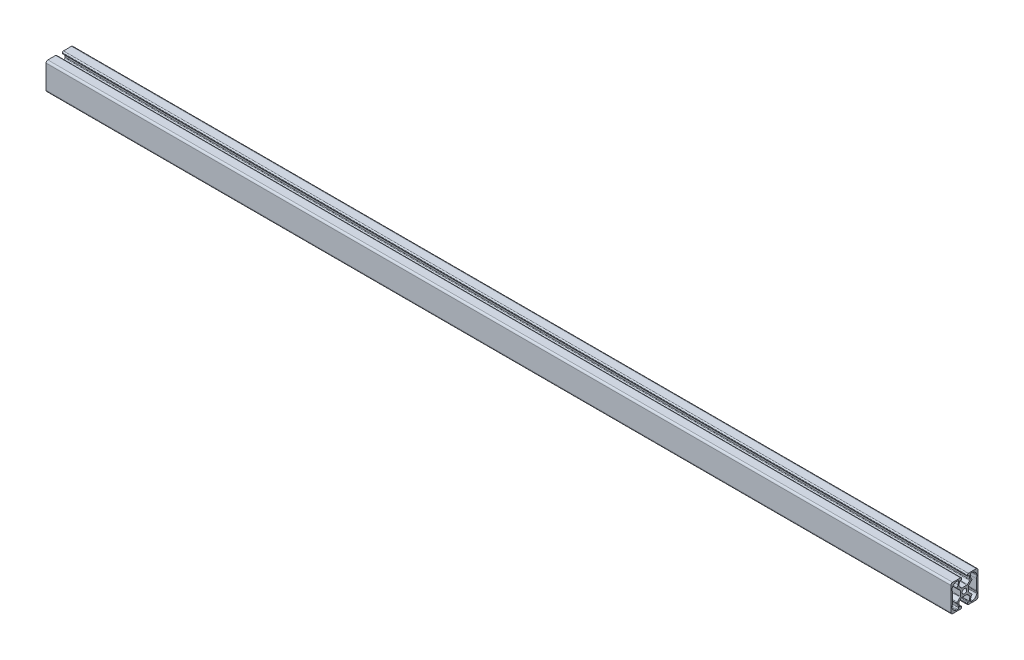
ISO-10303-21;
HEADER;
FILE_DESCRIPTION(('STEP AP214'),'2;1');
FILE_NAME('part.step','',(''),(''),'','','');
FILE_SCHEMA(('AUTOMOTIVE_DESIGN { 1 0 10303 214 1 1 1 1 }'));
ENDSEC;
DATA;
#1=APPLICATION_CONTEXT('core data for automotive mechanical design processes');
#2=APPLICATION_PROTOCOL_DEFINITION('international standard','automotive_design',2000,#1);
#3=PRODUCT_CONTEXT('',#1,'mechanical');
#4=PRODUCT('Part','Part','',(#3));
#5=PRODUCT_RELATED_PRODUCT_CATEGORY('part','',(#4));
#6=PRODUCT_DEFINITION_FORMATION('','',#4);
#7=PRODUCT_DEFINITION_CONTEXT('part definition',#1,'design');
#8=PRODUCT_DEFINITION('design','',#6,#7);
#9=PRODUCT_DEFINITION_SHAPE('','',#8);
#10=(LENGTH_UNIT() NAMED_UNIT(*) SI_UNIT(.MILLI.,.METRE.));
#11=(NAMED_UNIT(*) PLANE_ANGLE_UNIT() SI_UNIT($,.RADIAN.));
#12=(NAMED_UNIT(*) SI_UNIT($,.STERADIAN.) SOLID_ANGLE_UNIT());
#13=UNCERTAINTY_MEASURE_WITH_UNIT(LENGTH_MEASURE(1.E-05),#10,'distance_accuracy_value','');
#14=(GEOMETRIC_REPRESENTATION_CONTEXT(3) GLOBAL_UNCERTAINTY_ASSIGNED_CONTEXT((#13)) GLOBAL_UNIT_ASSIGNED_CONTEXT((#10,
#11,#12)) REPRESENTATION_CONTEXT('',''));
#15=CARTESIAN_POINT('',(0.,0.,0.));
#16=DIRECTION('',(0.,0.,1.));
#17=DIRECTION('',(1.,0.,0.));
#18=AXIS2_PLACEMENT_3D('',#15,#16,#17);
#19=CARTESIAN_POINT('',(1000.,5.49999999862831,-2.67157287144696));
#20=DIRECTION('',(1.,0.,0.));
#21=DIRECTION('',(0.,0.,-1.));
#22=AXIS2_PLACEMENT_3D('',#19,#20,#21);
#23=PLANE('',#22);
#24=CARTESIAN_POINT('',(1000.,-7.86477824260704,11.7));
#25=DIRECTION('',(1.,0.,0.));
#26=DIRECTION('',(0.,0.,-1.));
#27=AXIS2_PLACEMENT_3D('',#24,#25,#26);
#28=CIRCLE('',#27,1.99999999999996);
#29=CARTESIAN_POINT('',(1000.,-6.81121286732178,13.4));
#30=VERTEX_POINT('',#29);
#31=CARTESIAN_POINT('',(1000.,-7.86477824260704,13.7));
#32=VERTEX_POINT('',#31);
#33=EDGE_CURVE('E883',#30,#32,#28,.T.);
#34=ORIENTED_EDGE('',*,*,#33,.F.);
#35=CARTESIAN_POINT('',(1000.,-5.75764749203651,15.1));
#36=DIRECTION('',(-1.,0.,0.));
#37=DIRECTION('',(0.,0.,-1.));
#38=AXIS2_PLACEMENT_3D('',#35,#36,#37);
#39=CIRCLE('',#38,2.);
#40=CARTESIAN_POINT('',(1000.,-5.75764749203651,13.1));
#41=VERTEX_POINT('',#40);
#42=EDGE_CURVE('E881',#41,#30,#39,.T.);
#43=ORIENTED_EDGE('',*,*,#42,.F.);
#44=DIRECTION('',(0.,-1.,0.));
#45=VECTOR('',#44,1.);
#46=CARTESIAN_POINT('',(1000.,-5.75764749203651,13.1));
#47=LINE('',#46,#45);
#48=CARTESIAN_POINT('',(1000.,5.75764749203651,13.1));
#49=VERTEX_POINT('',#48);
#50=EDGE_CURVE('E937',#49,#41,#47,.T.);
#51=ORIENTED_EDGE('',*,*,#50,.F.);
#52=CARTESIAN_POINT('',(1000.,5.75764749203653,15.1));
#53=DIRECTION('',(-1.,0.,0.));
#54=DIRECTION('',(0.,0.,-1.));
#55=AXIS2_PLACEMENT_3D('',#52,#53,#54);
#56=CIRCLE('',#55,2.00000000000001);
#57=CARTESIAN_POINT('',(1000.,6.81121286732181,13.4));
#58=VERTEX_POINT('',#57);
#59=EDGE_CURVE('E934',#58,#49,#56,.T.);
#60=ORIENTED_EDGE('',*,*,#59,.F.);
#61=CARTESIAN_POINT('',(1000.,7.86477824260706,11.7));
#62=DIRECTION('',(1.,0.,0.));
#63=DIRECTION('',(0.,0.,-1.));
#64=AXIS2_PLACEMENT_3D('',#61,#62,#63);
#65=CIRCLE('',#64,1.99999999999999);
#66=CARTESIAN_POINT('',(1000.,7.86477824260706,13.7));
#67=VERTEX_POINT('',#66);
#68=EDGE_CURVE('E932',#67,#58,#65,.T.);
#69=ORIENTED_EDGE('',*,*,#68,.F.);
#70=DIRECTION('',(0.,-1.,0.));
#71=VECTOR('',#70,1.);
#72=CARTESIAN_POINT('',(1000.,8.90074537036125,13.7));
#73=LINE('',#72,#71);
#74=CARTESIAN_POINT('',(1000.,8.90074537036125,13.7));
#75=VERTEX_POINT('',#74);
#76=EDGE_CURVE('E930',#75,#67,#73,.T.);
#77=ORIENTED_EDGE('',*,*,#76,.F.);
#78=CARTESIAN_POINT('',(1000.,8.90074537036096,12.7));
#79=DIRECTION('',(1.,0.,0.));
#80=DIRECTION('',(0.,0.,-1.));
#81=AXIS2_PLACEMENT_3D('',#78,#79,#80);
#82=CIRCLE('',#81,0.999999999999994);
#83=CARTESIAN_POINT('',(1000.,9.12574445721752,13.6743589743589));
#84=VERTEX_POINT('',#83);
#85=EDGE_CURVE('E928',#84,#75,#82,.T.);
#86=ORIENTED_EDGE('',*,*,#85,.F.);
#87=CARTESIAN_POINT('',(1000.,7.75999999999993,7.75999999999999));
#88=DIRECTION('',(1.,0.,0.));
#89=DIRECTION('',(0.,0.,-1.));
#90=AXIS2_PLACEMENT_3D('',#87,#88,#89);
#91=CIRCLE('',#90,6.07);
#92=CARTESIAN_POINT('',(1000.,13.6743589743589,9.12574445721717));
#93=VERTEX_POINT('',#92);
#94=EDGE_CURVE('E926',#93,#84,#91,.T.);
#95=ORIENTED_EDGE('',*,*,#94,.F.);
#96=CARTESIAN_POINT('',(1000.,12.6999999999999,8.90074537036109));
#97=DIRECTION('',(1.,0.,0.));
#98=DIRECTION('',(0.,0.,-1.));
#99=AXIS2_PLACEMENT_3D('',#96,#97,#98);
#100=CIRCLE('',#99,0.999999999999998);
#101=CARTESIAN_POINT('',(1000.,13.6999999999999,8.90074537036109));
#102=VERTEX_POINT('',#101);
#103=EDGE_CURVE('E924',#102,#93,#100,.T.);
#104=ORIENTED_EDGE('',*,*,#103,.F.);
#105=DIRECTION('',(0.,0.,1.));
#106=VECTOR('',#105,1.);
#107=CARTESIAN_POINT('',(1000.,13.6999999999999,8.90074537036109));
#108=LINE('',#107,#106);
#109=CARTESIAN_POINT('',(1000.,13.6999999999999,7.49306392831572));
#110=VERTEX_POINT('',#109);
#111=EDGE_CURVE('E922',#110,#102,#108,.T.);
#112=ORIENTED_EDGE('',*,*,#111,.F.);
#113=CARTESIAN_POINT('',(1000.,12.6999999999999,7.49306392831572));
#114=DIRECTION('',(1.,0.,0.));
#115=DIRECTION('',(0.,0.,-1.));
#116=AXIS2_PLACEMENT_3D('',#113,#114,#115);
#117=CIRCLE('',#116,0.99999999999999);
#118=CARTESIAN_POINT('',(1000.,12.526351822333,6.50825617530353));
#119=VERTEX_POINT('',#118);
#120=EDGE_CURVE('E920',#119,#110,#117,.T.);
#121=ORIENTED_EDGE('',*,*,#120,.F.);
#122=DIRECTION('',(0.,0.984807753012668,-0.173648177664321));
#123=VECTOR('',#122,1.);
#124=CARTESIAN_POINT('',(1000.,9.47905546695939,7.04557674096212));
#125=LINE('',#124,#123);
#126=CARTESIAN_POINT('',(1000.,9.47905546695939,7.04557674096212));
#127=VERTEX_POINT('',#126);
#128=EDGE_CURVE('E918',#127,#119,#125,.T.);
#129=ORIENTED_EDGE('',*,*,#128,.F.);
#130=CARTESIAN_POINT('',(1000.,10.0000000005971,10.0000000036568));
#131=DIRECTION('',(1.,0.,0.));
#132=DIRECTION('',(0.,0.,-1.));
#133=AXIS2_PLACEMENT_3D('',#130,#131,#132);
#134=CIRCLE('',#133,3.0000000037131);
#135=CARTESIAN_POINT('',(1000.,7.87867964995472,7.87867966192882));
#136=VERTEX_POINT('',#135);
#137=EDGE_CURVE('E916',#136,#127,#134,.T.);
#138=ORIENTED_EDGE('',*,*,#137,.F.);
#139=CARTESIAN_POINT('',(1000.,7.17157287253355,7.17157288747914));
#140=DIRECTION('',(-1.,0.,0.));
#141=DIRECTION('',(0.,0.,-1.));
#142=AXIS2_PLACEMENT_3D('',#139,#140,#141);
#143=CIRCLE('',#142,0.999999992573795);
#144=CARTESIAN_POINT('',(1000.,6.46446609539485,7.8786796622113));
#145=VERTEX_POINT('',#144);
#146=EDGE_CURVE('E914',#145,#136,#143,.T.);
#147=ORIENTED_EDGE('',*,*,#146,.F.);
#148=DIRECTION('',(0.,0.707106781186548,0.707106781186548));
#149=VECTOR('',#148,1.);
#150=CARTESIAN_POINT('',(1000.,3.37867965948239,4.79289322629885));
#151=LINE('',#150,#149);
#152=CARTESIAN_POINT('',(1000.,3.37867965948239,4.79289322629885));
#153=VERTEX_POINT('',#152);
#154=EDGE_CURVE('E912',#153,#145,#151,.T.);
#155=ORIENTED_EDGE('',*,*,#154,.F.);
#156=CARTESIAN_POINT('',(1000.,2.67157287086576,5.5000000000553));
#157=DIRECTION('',(1.,0.,0.));
#158=DIRECTION('',(0.,0.,-1.));
#159=AXIS2_PLACEMENT_3D('',#156,#157,#158);
#160=CIRCLE('',#159,0.999999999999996);
#161=CARTESIAN_POINT('',(1000.,2.67157287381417,4.50000000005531));
#162=VERTEX_POINT('',#161);
#163=EDGE_CURVE('E910',#162,#153,#160,.T.);
#164=ORIENTED_EDGE('',*,*,#163,.F.);
#165=DIRECTION('',(0.,1.,0.));
#166=VECTOR('',#165,1.);
#167=CARTESIAN_POINT('',(1000.,-2.6715728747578,4.50000000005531));
#168=LINE('',#167,#166);
#169=CARTESIAN_POINT('',(1000.,-2.6715728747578,4.50000000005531));
#170=VERTEX_POINT('',#169);
#171=EDGE_CURVE('E908',#170,#162,#168,.T.);
#172=ORIENTED_EDGE('',*,*,#171,.F.);
#173=CARTESIAN_POINT('',(1000.,-2.6715728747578,5.5000000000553));
#174=DIRECTION('',(1.,0.,0.));
#175=DIRECTION('',(0.,0.,-1.));
#176=AXIS2_PLACEMENT_3D('',#173,#174,#175);
#177=CIRCLE('',#176,0.999999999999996);
#178=CARTESIAN_POINT('',(1000.,-3.37867965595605,4.79289321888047));
#179=VERTEX_POINT('',#178);
#180=EDGE_CURVE('E906',#179,#170,#177,.T.);
#181=ORIENTED_EDGE('',*,*,#180,.F.);
#182=DIRECTION('',(0.,0.707106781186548,-0.707106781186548));
#183=VECTOR('',#182,1.);
#184=CARTESIAN_POINT('',(1000.,-3.37867965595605,4.79289321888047));
#185=LINE('',#184,#183);
#186=CARTESIAN_POINT('',(1000.,-6.46446609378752,7.87867965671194));
#187=VERTEX_POINT('',#186);
#188=EDGE_CURVE('E904',#187,#179,#185,.T.);
#189=ORIENTED_EDGE('',*,*,#188,.F.);
#190=CARTESIAN_POINT('',(1000.,-7.1715728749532,7.17157287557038));
#191=DIRECTION('',(-1.,0.,0.));
#192=DIRECTION('',(0.,0.,-1.));
#193=AXIS2_PLACEMENT_3D('',#190,#191,#192);
#194=CIRCLE('',#193,0.999999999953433);
#195=CARTESIAN_POINT('',(1000.,-7.87867965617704,7.87867965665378));
#196=VERTEX_POINT('',#195);
#197=EDGE_CURVE('E902',#196,#187,#194,.T.);
#198=ORIENTED_EDGE('',*,*,#197,.F.);
#199=CARTESIAN_POINT('',(1000.,-9.99999999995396,10.0000000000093));
#200=DIRECTION('',(1.,0.,0.));
#201=DIRECTION('',(0.,0.,-1.));
#202=AXIS2_PLACEMENT_3D('',#199,#200,#201);
#203=CIRCLE('',#202,3.00000000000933);
#204=CARTESIAN_POINT('',(1000.,-9.47905546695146,7.04557674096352));
#205=VERTEX_POINT('',#204);
#206=EDGE_CURVE('E900',#205,#196,#203,.T.);
#207=ORIENTED_EDGE('',*,*,#206,.F.);
#208=DIRECTION('',(0.,0.984807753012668,0.173648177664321));
#209=VECTOR('',#208,1.);
#210=CARTESIAN_POINT('',(1000.,-9.47905546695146,7.04557674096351));
#211=LINE('',#210,#209);
#212=CARTESIAN_POINT('',(1000.,-12.5263518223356,6.50825617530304));
#213=VERTEX_POINT('',#212);
#214=EDGE_CURVE('E898',#213,#205,#211,.T.);
#215=ORIENTED_EDGE('',*,*,#214,.F.);
#216=CARTESIAN_POINT('',(1000.,-12.6999999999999,7.49306392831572));
#217=DIRECTION('',(1.,0.,0.));
#218=DIRECTION('',(0.,0.,-1.));
#219=AXIS2_PLACEMENT_3D('',#216,#217,#218);
#220=CIRCLE('',#219,0.999999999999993);
#221=CARTESIAN_POINT('',(1000.,-13.6999999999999,7.49306392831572));
#222=VERTEX_POINT('',#221);
#223=EDGE_CURVE('E896',#222,#213,#220,.T.);
#224=ORIENTED_EDGE('',*,*,#223,.F.);
#225=DIRECTION('',(0.,0.,-1.));
#226=VECTOR('',#225,1.);
#227=CARTESIAN_POINT('',(1000.,-13.6999999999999,8.90074537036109));
#228=LINE('',#227,#226);
#229=CARTESIAN_POINT('',(1000.,-13.6999999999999,8.90074537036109));
#230=VERTEX_POINT('',#229);
#231=EDGE_CURVE('E894',#230,#222,#228,.T.);
#232=ORIENTED_EDGE('',*,*,#231,.F.);
#233=CARTESIAN_POINT('',(1000.,-12.6999999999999,8.90074537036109));
#234=DIRECTION('',(1.,0.,0.));
#235=DIRECTION('',(0.,0.,-1.));
#236=AXIS2_PLACEMENT_3D('',#233,#234,#235);
#237=CIRCLE('',#236,1.00000000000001);
#238=CARTESIAN_POINT('',(1000.,-13.6743589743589,9.12574445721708));
#239=VERTEX_POINT('',#238);
#240=EDGE_CURVE('E892',#239,#230,#237,.T.);
#241=ORIENTED_EDGE('',*,*,#240,.F.);
#242=CARTESIAN_POINT('',(1000.,-7.75999999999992,7.76000000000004));
#243=DIRECTION('',(1.,0.,0.));
#244=DIRECTION('',(0.,0.,-1.));
#245=AXIS2_PLACEMENT_3D('',#242,#243,#244);
#246=CIRCLE('',#245,6.07000000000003);
#247=CARTESIAN_POINT('',(1000.,-9.12574445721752,13.674358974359));
#248=VERTEX_POINT('',#247);
#249=EDGE_CURVE('E890',#248,#239,#246,.T.);
#250=ORIENTED_EDGE('',*,*,#249,.F.);
#251=CARTESIAN_POINT('',(1000.,-8.90074537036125,12.7));
#252=DIRECTION('',(1.,0.,0.));
#253=DIRECTION('',(0.,0.,-1.));
#254=AXIS2_PLACEMENT_3D('',#251,#252,#253);
#255=CIRCLE('',#254,1.);
#256=CARTESIAN_POINT('',(1000.,-8.90074537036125,13.7));
#257=VERTEX_POINT('',#256);
#258=EDGE_CURVE('E888',#257,#248,#255,.T.);
#259=ORIENTED_EDGE('',*,*,#258,.F.);
#260=DIRECTION('',(0.,-1.,0.));
#261=VECTOR('',#260,1.);
#262=CARTESIAN_POINT('',(1000.,-8.90074537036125,13.7));
#263=LINE('',#262,#261);
#264=EDGE_CURVE('E886',#32,#257,#263,.T.);
#265=ORIENTED_EDGE('',*,*,#264,.F.);
#266=EDGE_LOOP('',(#34,#43,#51,#60,#69,#77,#86,#95,#104,#112,#121,#129,#138,#147,#155,#164,#172,
#181,#189,#198,#207,#215,#224,#232,#241,#250,#259,#265));
#267=FACE_BOUND('',#266,.T.);
#268=CARTESIAN_POINT('',(1000.,5.49999999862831,-2.67157287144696));
#269=DIRECTION('',(-1.,0.,0.));
#270=DIRECTION('',(0.,0.,-1.));
#271=AXIS2_PLACEMENT_3D('',#268,#269,#270);
#272=CIRCLE('',#271,0.999999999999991);
#273=CARTESIAN_POINT('',(1000.,4.79289321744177,-3.3786796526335));
#274=VERTEX_POINT('',#273);
#275=CARTESIAN_POINT('',(1000.,4.49999999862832,-2.67157287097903));
#276=VERTEX_POINT('',#275);
#277=EDGE_CURVE('E1086',#274,#276,#272,.T.);
#278=ORIENTED_EDGE('',*,*,#277,.T.);
#279=DIRECTION('',(0.,0.,1.));
#280=VECTOR('',#279,1.);
#281=CARTESIAN_POINT('',(1000.,4.49999999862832,-2.67157287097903));
#282=LINE('',#281,#280);
#283=CARTESIAN_POINT('',(1000.,4.49999999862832,2.67157288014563));
#284=VERTEX_POINT('',#283);
#285=EDGE_CURVE('E1089',#276,#284,#282,.T.);
#286=ORIENTED_EDGE('',*,*,#285,.T.);
#287=CARTESIAN_POINT('',(1000.,5.49999999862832,2.67157288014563));
#288=DIRECTION('',(-1.,0.,0.));
#289=DIRECTION('',(0.,0.,-1.));
#290=AXIS2_PLACEMENT_3D('',#287,#288,#289);
#291=CIRCLE('',#290,1.);
#292=CARTESIAN_POINT('',(1000.,4.79289321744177,3.37867966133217));
#293=VERTEX_POINT('',#292);
#294=EDGE_CURVE('E1092',#284,#293,#291,.T.);
#295=ORIENTED_EDGE('',*,*,#294,.T.);
#296=DIRECTION('',(0.,0.707106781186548,0.707106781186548));
#297=VECTOR('',#296,1.);
#298=CARTESIAN_POINT('',(1000.,4.79289321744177,3.37867966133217));
#299=LINE('',#298,#297);
#300=CARTESIAN_POINT('',(1000.,7.20861622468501,5.79440266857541));
#301=VERTEX_POINT('',#300);
#302=EDGE_CURVE('E1094',#293,#301,#299,.T.);
#303=ORIENTED_EDGE('',*,*,#302,.T.);
#304=CARTESIAN_POINT('',(1000.,7.91572300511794,5.08729589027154));
#305=DIRECTION('',(-1.,0.,0.));
#306=DIRECTION('',(0.,0.,-1.));
#307=AXIS2_PLACEMENT_3D('',#304,#305,#306);
#308=CIRCLE('',#307,0.999999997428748);
#309=CARTESIAN_POINT('',(1000.,8.08937118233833,6.07210364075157));
#310=VERTEX_POINT('',#309);
#311=EDGE_CURVE('E1096',#301,#310,#308,.T.);
#312=ORIENTED_EDGE('',*,*,#311,.T.);
#313=DIRECTION('',(0.,0.984807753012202,-0.173648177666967));
#314=VECTOR('',#313,1.);
#315=CARTESIAN_POINT('',(1000.,8.08937118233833,6.07210364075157));
#316=LINE('',#315,#314);
#317=CARTESIAN_POINT('',(1000.,12.0868240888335,5.36724483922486));
#318=VERTEX_POINT('',#317);
#319=EDGE_CURVE('E1098',#310,#318,#316,.T.);
#320=ORIENTED_EDGE('',*,*,#319,.T.);
#321=CARTESIAN_POINT('',(1000.,12.,4.87484096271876));
#322=DIRECTION('',(-1.,0.,0.));
#323=DIRECTION('',(0.,0.,-1.));
#324=AXIS2_PLACEMENT_3D('',#321,#322,#323);
#325=CIRCLE('',#324,0.499999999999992);
#326=CARTESIAN_POINT('',(1000.,12.5,4.8748409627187));
#327=VERTEX_POINT('',#326);
#328=EDGE_CURVE('E1100',#318,#327,#325,.T.);
#329=ORIENTED_EDGE('',*,*,#328,.T.);
#330=DIRECTION('',(0.,0.,-1.));
#331=VECTOR('',#330,1.);
#332=CARTESIAN_POINT('',(1000.,12.5,3.89999999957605));
#333=LINE('',#332,#331);
#334=CARTESIAN_POINT('',(1000.,12.5,3.89999999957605));
#335=VERTEX_POINT('',#334);
#336=EDGE_CURVE('E1102',#327,#335,#333,.T.);
#337=ORIENTED_EDGE('',*,*,#336,.T.);
#338=CARTESIAN_POINT('',(1000.,13.25,3.89999999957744));
#339=DIRECTION('',(1.,0.,0.));
#340=DIRECTION('',(0.,0.,-1.));
#341=AXIS2_PLACEMENT_3D('',#338,#339,#340);
#342=CIRCLE('',#341,0.749999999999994);
#343=CARTESIAN_POINT('',(1000.,13.25,3.14999999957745));
#344=VERTEX_POINT('',#343);
#345=EDGE_CURVE('E1104',#335,#344,#342,.T.);
#346=ORIENTED_EDGE('',*,*,#345,.T.);
#347=DIRECTION('',(0.,1.,-3.15404268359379E-13));
#348=VECTOR('',#347,1.);
#349=CARTESIAN_POINT('',(1000.,13.8000000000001,3.14999999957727));
#350=LINE('',#349,#348);
#351=CARTESIAN_POINT('',(1000.,13.8000000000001,3.14999999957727));
#352=VERTEX_POINT('',#351);
#353=EDGE_CURVE('E1106',#344,#352,#350,.T.);
#354=ORIENTED_EDGE('',*,*,#353,.T.);
#355=CARTESIAN_POINT('',(1000.,13.8000000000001,4.34999999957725));
#356=DIRECTION('',(1.,0.,0.));
#357=DIRECTION('',(0.,0.,-1.));
#358=AXIS2_PLACEMENT_3D('',#355,#356,#357);
#359=CIRCLE('',#358,1.19999999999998);
#360=CARTESIAN_POINT('',(1000.,15.,4.34999999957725));
#361=VERTEX_POINT('',#360);
#362=EDGE_CURVE('E1108',#352,#361,#359,.T.);
#363=ORIENTED_EDGE('',*,*,#362,.T.);
#364=DIRECTION('',(0.,0.,1.));
#365=VECTOR('',#364,1.);
#366=CARTESIAN_POINT('',(1000.,14.9999999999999,13.));
#367=LINE('',#366,#365);
#368=CARTESIAN_POINT('',(1000.,14.9999999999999,13.));
#369=VERTEX_POINT('',#368);
#370=EDGE_CURVE('E1110',#361,#369,#367,.T.);
#371=ORIENTED_EDGE('',*,*,#370,.T.);
#372=CARTESIAN_POINT('',(1000.,12.9999999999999,13.));
#373=DIRECTION('',(1.,0.,0.));
#374=DIRECTION('',(0.,0.,-1.));
#375=AXIS2_PLACEMENT_3D('',#372,#373,#374);
#376=CIRCLE('',#375,2.);
#377=CARTESIAN_POINT('',(1000.,12.9999999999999,15.));
#378=VERTEX_POINT('',#377);
#379=EDGE_CURVE('E1112',#369,#378,#376,.T.);
#380=ORIENTED_EDGE('',*,*,#379,.T.);
#381=DIRECTION('',(0.,-1.,0.));
#382=VECTOR('',#381,1.);
#383=CARTESIAN_POINT('',(1000.,-12.9999999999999,15.));
#384=LINE('',#383,#382);
#385=CARTESIAN_POINT('',(1000.,-12.9999999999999,15.));
#386=VERTEX_POINT('',#385);
#387=EDGE_CURVE('E1114',#378,#386,#384,.T.);
#388=ORIENTED_EDGE('',*,*,#387,.T.);
#389=CARTESIAN_POINT('',(1000.,-12.9999999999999,13.));
#390=DIRECTION('',(1.,0.,0.));
#391=DIRECTION('',(0.,0.,-1.));
#392=AXIS2_PLACEMENT_3D('',#389,#390,#391);
#393=CIRCLE('',#392,2.);
#394=CARTESIAN_POINT('',(1000.,-14.9999999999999,13.));
#395=VERTEX_POINT('',#394);
#396=EDGE_CURVE('E1116',#386,#395,#393,.T.);
#397=ORIENTED_EDGE('',*,*,#396,.T.);
#398=DIRECTION('',(0.,0.,-1.));
#399=VECTOR('',#398,1.);
#400=CARTESIAN_POINT('',(1000.,-14.9999999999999,13.));
#401=LINE('',#400,#399);
#402=CARTESIAN_POINT('',(1000.,-14.9999999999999,4.34999999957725));
#403=VERTEX_POINT('',#402);
#404=EDGE_CURVE('E1118',#395,#403,#401,.T.);
#405=ORIENTED_EDGE('',*,*,#404,.T.);
#406=CARTESIAN_POINT('',(1000.,-13.8,4.34999999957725));
#407=DIRECTION('',(1.,0.,0.));
#408=DIRECTION('',(0.,0.,-1.));
#409=AXIS2_PLACEMENT_3D('',#406,#407,#408);
#410=CIRCLE('',#409,1.19999999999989);
#411=CARTESIAN_POINT('',(1000.,-13.8,3.14999999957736));
#412=VERTEX_POINT('',#411);
#413=EDGE_CURVE('E1120',#403,#412,#410,.T.);
#414=ORIENTED_EDGE('',*,*,#413,.T.);
#415=DIRECTION('',(0.,1.,-1.63221708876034E-13));
#416=VECTOR('',#415,1.);
#417=CARTESIAN_POINT('',(1000.,-13.8,3.14999999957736));
#418=LINE('',#417,#416);
#419=CARTESIAN_POINT('',(1000.,-13.2500000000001,3.14999999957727));
#420=VERTEX_POINT('',#419);
#421=EDGE_CURVE('E1122',#412,#420,#418,.T.);
#422=ORIENTED_EDGE('',*,*,#421,.T.);
#423=CARTESIAN_POINT('',(1000.,-13.2500000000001,3.89999999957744));
#424=DIRECTION('',(1.,0.,0.));
#425=DIRECTION('',(0.,0.,-1.));
#426=AXIS2_PLACEMENT_3D('',#423,#424,#425);
#427=CIRCLE('',#426,0.750000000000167);
#428=CARTESIAN_POINT('',(1000.,-12.4999999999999,3.89999999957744));
#429=VERTEX_POINT('',#428);
#430=EDGE_CURVE('E1124',#420,#429,#427,.T.);
#431=ORIENTED_EDGE('',*,*,#430,.T.);
#432=DIRECTION('',(0.,-1.70831407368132E-13,1.));
#433=VECTOR('',#432,1.);
#434=CARTESIAN_POINT('',(1000.,-12.4999999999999,3.89999999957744));
#435=LINE('',#434,#433);
#436=CARTESIAN_POINT('',(1000.,-12.5000000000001,4.87484096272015));
#437=VERTEX_POINT('',#436);
#438=EDGE_CURVE('E1126',#429,#437,#435,.T.);
#439=ORIENTED_EDGE('',*,*,#438,.T.);
#440=CARTESIAN_POINT('',(1000.,-12.0000000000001,4.87484096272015));
#441=DIRECTION('',(-1.,0.,0.));
#442=DIRECTION('',(0.,0.,-1.));
#443=AXIS2_PLACEMENT_3D('',#440,#441,#442);
#444=CIRCLE('',#443,0.499999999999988);
#445=CARTESIAN_POINT('',(1000.,-12.0868240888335,5.36724483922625));
#446=VERTEX_POINT('',#445);
#447=EDGE_CURVE('E1128',#437,#446,#444,.T.);
#448=ORIENTED_EDGE('',*,*,#447,.T.);
#449=DIRECTION('',(0.,0.984807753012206,0.173648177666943));
#450=VECTOR('',#449,1.);
#451=CARTESIAN_POINT('',(1000.,-8.08937118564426,6.07210364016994));
#452=LINE('',#451,#450);
#453=CARTESIAN_POINT('',(1000.,-8.08937118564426,6.07210364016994));
#454=VERTEX_POINT('',#453);
#455=EDGE_CURVE('E1130',#446,#454,#452,.T.);
#456=ORIENTED_EDGE('',*,*,#455,.T.);
#457=CARTESIAN_POINT('',(1000.,-7.91572300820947,5.08729588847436));
#458=DIRECTION('',(-1.,0.,0.));
#459=DIRECTION('',(0.,0.,-1.));
#460=AXIS2_PLACEMENT_3D('',#457,#458,#459);
#461=CIRCLE('',#460,0.999999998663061);
#462=CARTESIAN_POINT('',(1000.,-7.20861622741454,5.79440266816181));
#463=VERTEX_POINT('',#462);
#464=EDGE_CURVE('E1132',#454,#463,#461,.T.);
#465=ORIENTED_EDGE('',*,*,#464,.T.);
#466=DIRECTION('',(0.,0.707106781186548,-0.707106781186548));
#467=VECTOR('',#466,1.);
#468=CARTESIAN_POINT('',(1000.,-4.79289321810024,3.37867965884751));
#469=LINE('',#468,#467);
#470=CARTESIAN_POINT('',(1000.,-4.79289321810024,3.37867965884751));
#471=VERTEX_POINT('',#470);
#472=EDGE_CURVE('E1134',#463,#471,#469,.T.);
#473=ORIENTED_EDGE('',*,*,#472,.T.);
#474=CARTESIAN_POINT('',(1000.,-5.49999999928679,2.67157287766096));
#475=DIRECTION('',(-1.,0.,0.));
#476=DIRECTION('',(0.,0.,-1.));
#477=AXIS2_PLACEMENT_3D('',#474,#475,#476);
#478=CIRCLE('',#477,1.);
#479=CARTESIAN_POINT('',(1000.,-4.49999999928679,2.67157287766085));
#480=VERTEX_POINT('',#479);
#481=EDGE_CURVE('E1136',#471,#480,#478,.T.);
#482=ORIENTED_EDGE('',*,*,#481,.T.);
#483=DIRECTION('',(0.,0.,-1.));
#484=VECTOR('',#483,1.);
#485=CARTESIAN_POINT('',(1000.,-4.49999999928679,-2.67157287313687));
#486=LINE('',#485,#484);
#487=CARTESIAN_POINT('',(1000.,-4.49999999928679,-2.67157287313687));
#488=VERTEX_POINT('',#487);
#489=EDGE_CURVE('E1138',#480,#488,#486,.T.);
#490=ORIENTED_EDGE('',*,*,#489,.T.);
#491=CARTESIAN_POINT('',(1000.,-5.49999999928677,-2.67157287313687));
#492=DIRECTION('',(-1.,0.,0.));
#493=DIRECTION('',(0.,0.,-1.));
#494=AXIS2_PLACEMENT_3D('',#491,#492,#493);
#495=CIRCLE('',#494,0.999999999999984);
#496=CARTESIAN_POINT('',(1000.,-4.79289321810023,-3.3786796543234));
#497=VERTEX_POINT('',#496);
#498=EDGE_CURVE('E1140',#488,#497,#495,.T.);
#499=ORIENTED_EDGE('',*,*,#498,.T.);
#500=DIRECTION('',(0.,-0.707106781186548,-0.707106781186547));
#501=VECTOR('',#500,1.);
#502=CARTESIAN_POINT('',(1000.,-4.79289321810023,-3.3786796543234));
#503=LINE('',#502,#501);
#504=CARTESIAN_POINT('',(1000.,-7.20861622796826,-5.79440266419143));
#505=VERTEX_POINT('',#504);
#506=EDGE_CURVE('E1142',#497,#505,#503,.T.);
#507=ORIENTED_EDGE('',*,*,#506,.T.);
#508=CARTESIAN_POINT('',(1000.,-7.91572300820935,-5.08729588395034));
#509=DIRECTION('',(-1.,0.,0.));
#510=DIRECTION('',(0.,0.,-1.));
#511=AXIS2_PLACEMENT_3D('',#508,#509,#510);
#512=CIRCLE('',#511,0.999999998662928);
#513=CARTESIAN_POINT('',(1000.,-8.0893711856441,-6.07210363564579));
#514=VERTEX_POINT('',#513);
#515=EDGE_CURVE('E1144',#505,#514,#512,.T.);
#516=ORIENTED_EDGE('',*,*,#515,.T.);
#517=DIRECTION('',(0.,-0.984807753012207,0.173648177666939));
#518=VECTOR('',#517,1.);
#519=CARTESIAN_POINT('',(1000.,-8.0893711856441,-6.07210363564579));
#520=LINE('',#519,#518);
#521=CARTESIAN_POINT('',(1000.,-12.0868240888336,-5.36724483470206));
#522=VERTEX_POINT('',#521);
#523=EDGE_CURVE('E1146',#514,#522,#520,.T.);
#524=ORIENTED_EDGE('',*,*,#523,.T.);
#525=CARTESIAN_POINT('',(1000.,-12.0000000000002,-4.87484095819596));
#526=DIRECTION('',(-1.,0.,0.));
#527=DIRECTION('',(0.,0.,-1.));
#528=AXIS2_PLACEMENT_3D('',#525,#526,#527);
#529=CIRCLE('',#528,0.499999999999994);
#530=CARTESIAN_POINT('',(1000.,-12.5000000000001,-4.8748409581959));
#531=VERTEX_POINT('',#530);
#532=EDGE_CURVE('E1148',#522,#531,#529,.T.);
#533=ORIENTED_EDGE('',*,*,#532,.T.);
#534=DIRECTION('',(0.,0.,1.));
#535=VECTOR('',#534,1.);
#536=CARTESIAN_POINT('',(1000.,-12.5000000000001,-3.89999999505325));
#537=LINE('',#536,#535);
#538=CARTESIAN_POINT('',(1000.,-12.5000000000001,-3.89999999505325));
#539=VERTEX_POINT('',#538);
#540=EDGE_CURVE('E1150',#531,#539,#537,.T.);
#541=ORIENTED_EDGE('',*,*,#540,.T.);
#542=CARTESIAN_POINT('',(1000.,-13.2500000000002,-3.89999999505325));
#543=DIRECTION('',(1.,0.,0.));
#544=DIRECTION('',(0.,0.,-1.));
#545=AXIS2_PLACEMENT_3D('',#542,#543,#544);
#546=CIRCLE('',#545,0.750000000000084);
#547=CARTESIAN_POINT('',(1000.,-13.2500000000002,-3.14999999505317));
#548=VERTEX_POINT('',#547);
#549=EDGE_CURVE('E1152',#539,#548,#546,.T.);
#550=ORIENTED_EDGE('',*,*,#549,.T.);
#551=DIRECTION('',(0.,-1.,0.));
#552=VECTOR('',#551,1.);
#553=CARTESIAN_POINT('',(1000.,-13.8000000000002,-3.14999999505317));
#554=LINE('',#553,#552);
#555=CARTESIAN_POINT('',(1000.,-13.8000000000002,-3.14999999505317));
#556=VERTEX_POINT('',#555);
#557=EDGE_CURVE('E1154',#548,#556,#554,.T.);
#558=ORIENTED_EDGE('',*,*,#557,.T.);
#559=CARTESIAN_POINT('',(1000.,-13.8000000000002,-4.34999999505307));
#560=DIRECTION('',(1.,0.,0.));
#561=DIRECTION('',(0.,0.,-1.));
#562=AXIS2_PLACEMENT_3D('',#559,#560,#561);
#563=CIRCLE('',#562,1.1999999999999);
#564=CARTESIAN_POINT('',(1000.,-15.0000000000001,-4.34999999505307));
#565=VERTEX_POINT('',#564);
#566=EDGE_CURVE('E1156',#556,#565,#563,.T.);
#567=ORIENTED_EDGE('',*,*,#566,.T.);
#568=DIRECTION('',(0.,0.,-1.));
#569=VECTOR('',#568,1.);
#570=CARTESIAN_POINT('',(1000.,-15.0000000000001,-12.9999999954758));
#571=LINE('',#570,#569);
#572=CARTESIAN_POINT('',(1000.,-15.0000000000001,-12.9999999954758));
#573=VERTEX_POINT('',#572);
#574=EDGE_CURVE('E1158',#565,#573,#571,.T.);
#575=ORIENTED_EDGE('',*,*,#574,.T.);
#576=CARTESIAN_POINT('',(1000.,-13.0000000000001,-12.9999999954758));
#577=DIRECTION('',(1.,0.,0.));
#578=DIRECTION('',(0.,0.,-1.));
#579=AXIS2_PLACEMENT_3D('',#576,#577,#578);
#580=CIRCLE('',#579,2.);
#581=CARTESIAN_POINT('',(1000.,-13.0000000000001,-14.9999999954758));
#582=VERTEX_POINT('',#581);
#583=EDGE_CURVE('E1160',#573,#582,#580,.T.);
#584=ORIENTED_EDGE('',*,*,#583,.T.);
#585=DIRECTION('',(0.,1.,0.));
#586=VECTOR('',#585,1.);
#587=CARTESIAN_POINT('',(1000.,-13.0000000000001,-14.9999999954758));
#588=LINE('',#587,#586);
#589=CARTESIAN_POINT('',(1000.,12.9999999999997,-14.9999999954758));
#590=VERTEX_POINT('',#589);
#591=EDGE_CURVE('E1162',#582,#590,#588,.T.);
#592=ORIENTED_EDGE('',*,*,#591,.T.);
#593=CARTESIAN_POINT('',(1000.,13.,-12.9999999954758));
#594=DIRECTION('',(1.,0.,0.));
#595=DIRECTION('',(0.,0.,-1.));
#596=AXIS2_PLACEMENT_3D('',#593,#594,#595);
#597=CIRCLE('',#596,2.);
#598=CARTESIAN_POINT('',(1000.,15.,-12.9999999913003));
#599=VERTEX_POINT('',#598);
#600=EDGE_CURVE('E1164',#590,#599,#597,.T.);
#601=ORIENTED_EDGE('',*,*,#600,.T.);
#602=DIRECTION('',(0.,0.,1.));
#603=VECTOR('',#602,1.);
#604=CARTESIAN_POINT('',(1000.,15.,-12.9999999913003));
#605=LINE('',#604,#603);
#606=CARTESIAN_POINT('',(1000.,15.,-4.34999999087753));
#607=VERTEX_POINT('',#606);
#608=EDGE_CURVE('E1166',#599,#607,#605,.T.);
#609=ORIENTED_EDGE('',*,*,#608,.T.);
#610=CARTESIAN_POINT('',(1000.,13.8000000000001,-4.34999999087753));
#611=DIRECTION('',(1.,0.,0.));
#612=DIRECTION('',(0.,0.,-1.));
#613=AXIS2_PLACEMENT_3D('',#610,#611,#612);
#614=CIRCLE('',#613,1.1999999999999);
#615=CARTESIAN_POINT('',(1000.,13.8000000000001,-3.14999999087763));
#616=VERTEX_POINT('',#615);
#617=EDGE_CURVE('E1168',#607,#616,#614,.T.);
#618=ORIENTED_EDGE('',*,*,#617,.T.);
#619=DIRECTION('',(0.,-1.,0.));
#620=VECTOR('',#619,1.);
#621=CARTESIAN_POINT('',(1000.,13.8000000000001,-3.14999999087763));
#622=LINE('',#621,#620);
#623=CARTESIAN_POINT('',(1000.,13.2500000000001,-3.14999999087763));
#624=VERTEX_POINT('',#623);
#625=EDGE_CURVE('E1170',#616,#624,#622,.T.);
#626=ORIENTED_EDGE('',*,*,#625,.T.);
#627=CARTESIAN_POINT('',(1000.,13.2500000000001,-3.89999999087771));
#628=DIRECTION('',(1.,0.,0.));
#629=DIRECTION('',(0.,0.,-1.));
#630=AXIS2_PLACEMENT_3D('',#627,#628,#629);
#631=CIRCLE('',#630,0.75000000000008);
#632=CARTESIAN_POINT('',(1000.,12.5,-3.89999999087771));
#633=VERTEX_POINT('',#632);
#634=EDGE_CURVE('E1172',#624,#633,#631,.T.);
#635=ORIENTED_EDGE('',*,*,#634,.T.);
#636=DIRECTION('',(0.,0.,-1.));
#637=VECTOR('',#636,1.);
#638=CARTESIAN_POINT('',(1000.,12.5,-3.89999999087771));
#639=LINE('',#638,#637);
#640=CARTESIAN_POINT('',(1000.,12.5,-4.87484095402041));
#641=VERTEX_POINT('',#640);
#642=EDGE_CURVE('E1174',#633,#641,#639,.T.);
#643=ORIENTED_EDGE('',*,*,#642,.T.);
#644=CARTESIAN_POINT('',(1000.,12.,-4.87484095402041));
#645=DIRECTION('',(-1.,0.,0.));
#646=DIRECTION('',(0.,0.,-1.));
#647=AXIS2_PLACEMENT_3D('',#644,#645,#646);
#648=CIRCLE('',#647,0.499999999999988);
#649=CARTESIAN_POINT('',(1000.,12.0868240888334,-5.36724483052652));
#650=VERTEX_POINT('',#649);
#651=EDGE_CURVE('E1176',#641,#650,#648,.T.);
#652=ORIENTED_EDGE('',*,*,#651,.T.);
#653=DIRECTION('',(0.,-0.98480775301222,-0.173648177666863));
#654=VECTOR('',#653,1.);
#655=CARTESIAN_POINT('',(1000.,8.08937118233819,-6.07210363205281));
#656=LINE('',#655,#654);
#657=CARTESIAN_POINT('',(1000.,8.08937118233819,-6.07210363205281));
#658=VERTEX_POINT('',#657);
#659=EDGE_CURVE('E1178',#650,#658,#656,.T.);
#660=ORIENTED_EDGE('',*,*,#659,.T.);
#661=CARTESIAN_POINT('',(1000.,7.91572300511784,-5.08729588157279));
#662=DIRECTION('',(-1.,0.,0.));
#663=DIRECTION('',(0.,0.,-1.));
#664=AXIS2_PLACEMENT_3D('',#661,#662,#663);
#665=CIRCLE('',#664,0.999999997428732);
#666=CARTESIAN_POINT('',(1000.,7.20861622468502,-5.79440265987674));
#667=VERTEX_POINT('',#666);
#668=EDGE_CURVE('E1180',#658,#667,#665,.T.);
#669=ORIENTED_EDGE('',*,*,#668,.T.);
#670=DIRECTION('',(0.,-0.707106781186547,0.707106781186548));
#671=VECTOR('',#670,1.);
#672=CARTESIAN_POINT('',(1000.,4.79289321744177,-3.3786796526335));
#673=LINE('',#672,#671);
#674=EDGE_CURVE('E1182',#667,#274,#673,.T.);
#675=ORIENTED_EDGE('',*,*,#674,.T.);
#676=EDGE_LOOP('',(#278,#286,#295,#303,#312,#320,#329,#337,#346,#354,#363,#371,#380,#388,#397,
#405,#414,#422,#431,#439,#448,#456,#465,#473,#482,#490,#499,#507,#516,#524,#533,#541,#550,#558,
#567,#575,#584,#592,#601,#609,#618,#626,#635,#643,#652,#660,#669,#675));
#677=FACE_BOUND('',#676,.T.);
#678=CARTESIAN_POINT('',(1000.,0.,0.));
#679=DIRECTION('',(1.,0.,0.));
#680=DIRECTION('',(0.,0.,-1.));
#681=AXIS2_PLACEMENT_3D('',#678,#679,#680);
#682=CIRCLE('',#681,2.54999999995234);
#683=CARTESIAN_POINT('',(1000.,0.,-2.54999999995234));
#684=VERTEX_POINT('',#683);
#685=EDGE_CURVE('E1080',#684,#684,#682,.T.);
#686=ORIENTED_EDGE('',*,*,#685,.F.);
#687=EDGE_LOOP('',(#686));
#688=FACE_BOUND('',#687,.T.);
#689=DIRECTION('',(0.,-1.,0.));
#690=VECTOR('',#689,1.);
#691=CARTESIAN_POINT('',(1000.,-2.67157287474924,-4.5));
#692=LINE('',#691,#690);
#693=CARTESIAN_POINT('',(1000.,2.67157287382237,-4.5));
#694=VERTEX_POINT('',#693);
#695=CARTESIAN_POINT('',(1000.,-2.67157287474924,-4.50000000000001));
#696=VERTEX_POINT('',#695);
#697=EDGE_CURVE('E684',#694,#696,#692,.T.);
#698=ORIENTED_EDGE('',*,*,#697,.F.);
#699=CARTESIAN_POINT('',(1000.,2.67157287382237,-5.50000000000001));
#700=DIRECTION('',(1.,0.,0.));
#701=DIRECTION('',(0.,0.,-1.));
#702=AXIS2_PLACEMENT_3D('',#699,#700,#701);
#703=CIRCLE('',#702,0.999999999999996);
#704=CARTESIAN_POINT('',(1000.,3.37867965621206,-4.79289322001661));
#705=VERTEX_POINT('',#704);
#706=EDGE_CURVE('E676',#705,#694,#703,.T.);
#707=ORIENTED_EDGE('',*,*,#706,.F.);
#708=DIRECTION('',(0.,-0.707106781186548,0.707106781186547));
#709=VECTOR('',#708,1.);
#710=CARTESIAN_POINT('',(1000.,3.37867965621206,-4.79289322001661));
#711=LINE('',#710,#709);
#712=CARTESIAN_POINT('',(1000.,6.46446609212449,-7.87867965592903));
#713=VERTEX_POINT('',#712);
#714=EDGE_CURVE('E749',#713,#705,#711,.T.);
#715=ORIENTED_EDGE('',*,*,#714,.F.);
#716=CARTESIAN_POINT('',(1000.,7.17157287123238,-7.1715728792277));
#717=DIRECTION('',(-1.,0.,0.));
#718=DIRECTION('',(0.,0.,-1.));
#719=AXIS2_PLACEMENT_3D('',#716,#717,#718);
#720=CIRCLE('',#719,0.999999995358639);
#721=CARTESIAN_POINT('',(1000.,7.87867965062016,-7.87867965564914));
#722=VERTEX_POINT('',#721);
#723=EDGE_CURVE('E747',#722,#713,#720,.T.);
#724=ORIENTED_EDGE('',*,*,#723,.F.);
#725=CARTESIAN_POINT('',(1000.,9.99999999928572,-9.99999999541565));
#726=DIRECTION('',(1.,0.,0.));
#727=DIRECTION('',(0.,0.,-1.));
#728=AXIS2_PLACEMENT_3D('',#725,#726,#727);
#729=CIRCLE('',#728,3.00000000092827);
#730=CARTESIAN_POINT('',(1000.,9.47905546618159,-7.04557673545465));
#731=VERTEX_POINT('',#730);
#732=EDGE_CURVE('E745',#731,#722,#729,.T.);
#733=ORIENTED_EDGE('',*,*,#732,.F.);
#734=DIRECTION('',(0.,-0.984807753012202,-0.173648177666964));
#735=VECTOR('',#734,1.);
#736=CARTESIAN_POINT('',(1000.,9.47905546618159,-7.04557673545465));
#737=LINE('',#736,#735);
#738=CARTESIAN_POINT('',(1000.,12.5263518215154,-6.50825616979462));
#739=VERTEX_POINT('',#738);
#740=EDGE_CURVE('E743',#739,#731,#737,.T.);
#741=ORIENTED_EDGE('',*,*,#740,.F.);
#742=CARTESIAN_POINT('',(1000.,12.6999999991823,-7.49306392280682));
#743=DIRECTION('',(1.,0.,0.));
#744=DIRECTION('',(0.,0.,-1.));
#745=AXIS2_PLACEMENT_3D('',#742,#743,#744);
#746=CIRCLE('',#745,0.999999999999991);
#747=CARTESIAN_POINT('',(1000.,13.6999999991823,-7.49306392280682));
#748=VERTEX_POINT('',#747);
#749=EDGE_CURVE('E741',#748,#739,#746,.T.);
#750=ORIENTED_EDGE('',*,*,#749,.F.);
#751=DIRECTION('',(0.,0.,1.));
#752=VECTOR('',#751,1.);
#753=CARTESIAN_POINT('',(1000.,13.6999999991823,-8.90074536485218));
#754=LINE('',#753,#752);
#755=CARTESIAN_POINT('',(1000.,13.6999999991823,-8.90074536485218));
#756=VERTEX_POINT('',#755);
#757=EDGE_CURVE('E739',#756,#748,#754,.T.);
#758=ORIENTED_EDGE('',*,*,#757,.F.);
#759=CARTESIAN_POINT('',(1000.,12.6999999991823,-8.90074536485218));
#760=DIRECTION('',(1.,0.,0.));
#761=DIRECTION('',(0.,0.,-1.));
#762=AXIS2_PLACEMENT_3D('',#759,#760,#761);
#763=CIRCLE('',#762,1.00000000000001);
#764=CARTESIAN_POINT('',(1000.,13.6743589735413,-9.12574445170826));
#765=VERTEX_POINT('',#764);
#766=EDGE_CURVE('E737',#765,#756,#763,.T.);
#767=ORIENTED_EDGE('',*,*,#766,.F.);
#768=CARTESIAN_POINT('',(1000.,7.75999999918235,-7.75999999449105));
#769=DIRECTION('',(1.,0.,0.));
#770=DIRECTION('',(0.,0.,-1.));
#771=AXIS2_PLACEMENT_3D('',#768,#769,#770);
#772=CIRCLE('',#771,6.07000000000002);
#773=CARTESIAN_POINT('',(1000.,9.12574445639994,-13.67435896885));
#774=VERTEX_POINT('',#773);
#775=EDGE_CURVE('E735',#774,#765,#772,.T.);
#776=ORIENTED_EDGE('',*,*,#775,.F.);
#777=CARTESIAN_POINT('',(1000.,8.90074536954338,-12.6999999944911));
#778=DIRECTION('',(1.,0.,0.));
#779=DIRECTION('',(0.,0.,-1.));
#780=AXIS2_PLACEMENT_3D('',#777,#778,#779);
#781=CIRCLE('',#780,1.00000000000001);
#782=CARTESIAN_POINT('',(1000.,8.90074536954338,-13.6999999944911));
#783=VERTEX_POINT('',#782);
#784=EDGE_CURVE('E733',#783,#774,#781,.T.);
#785=ORIENTED_EDGE('',*,*,#784,.F.);
#786=DIRECTION('',(0.,1.,0.));
#787=VECTOR('',#786,1.);
#788=CARTESIAN_POINT('',(1000.,8.90074536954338,-13.6999999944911));
#789=LINE('',#788,#787);
#790=CARTESIAN_POINT('',(1000.,7.86477824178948,-13.6999999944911));
#791=VERTEX_POINT('',#790);
#792=EDGE_CURVE('E731',#791,#783,#789,.T.);
#793=ORIENTED_EDGE('',*,*,#792,.F.);
#794=CARTESIAN_POINT('',(1000.,7.86477824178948,-11.6999999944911));
#795=DIRECTION('',(1.,0.,0.));
#796=DIRECTION('',(0.,0.,-1.));
#797=AXIS2_PLACEMENT_3D('',#794,#795,#796);
#798=CIRCLE('',#797,2.);
#799=CARTESIAN_POINT('',(1000.,6.81121286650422,-13.3999999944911));
#800=VERTEX_POINT('',#799);
#801=EDGE_CURVE('E729',#800,#791,#798,.T.);
#802=ORIENTED_EDGE('',*,*,#801,.F.);
#803=CARTESIAN_POINT('',(1000.,5.75764750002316,-15.0999999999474));
#804=DIRECTION('',(-1.,0.,0.));
#805=DIRECTION('',(0.,0.,-1.));
#806=AXIS2_PLACEMENT_3D('',#803,#804,#805);
#807=CIRCLE('',#806,2.);
#808=CARTESIAN_POINT('',(1000.,5.7576474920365,-13.0999999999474));
#809=VERTEX_POINT('',#808);
#810=EDGE_CURVE('E727',#809,#800,#807,.T.);
#811=ORIENTED_EDGE('',*,*,#810,.F.);
#812=DIRECTION('',(0.,1.,0.));
#813=VECTOR('',#812,1.);
#814=CARTESIAN_POINT('',(1000.,-5.75764749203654,-13.0999999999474));
#815=LINE('',#814,#813);
#816=CARTESIAN_POINT('',(1000.,-5.75764749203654,-13.0999999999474));
#817=VERTEX_POINT('',#816);
#818=EDGE_CURVE('E725',#817,#809,#815,.T.);
#819=ORIENTED_EDGE('',*,*,#818,.F.);
#820=CARTESIAN_POINT('',(1000.,-5.75764749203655,-15.0999999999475));
#821=DIRECTION('',(-1.,0.,0.));
#822=DIRECTION('',(0.,0.,-1.));
#823=AXIS2_PLACEMENT_3D('',#820,#821,#822);
#824=CIRCLE('',#823,2.00000000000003);
#825=CARTESIAN_POINT('',(1000.,-6.81121286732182,-13.3999999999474));
#826=VERTEX_POINT('',#825);
#827=EDGE_CURVE('E723',#826,#817,#824,.T.);
#828=ORIENTED_EDGE('',*,*,#827,.F.);
#829=CARTESIAN_POINT('',(1000.,-7.86477824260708,-11.6999999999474));
#830=DIRECTION('',(1.,0.,0.));
#831=DIRECTION('',(0.,0.,-1.));
#832=AXIS2_PLACEMENT_3D('',#829,#830,#831);
#833=CIRCLE('',#832,2.);
#834=CARTESIAN_POINT('',(1000.,-7.8647782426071,-13.6999999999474));
#835=VERTEX_POINT('',#834);
#836=EDGE_CURVE('E721',#835,#826,#833,.T.);
#837=ORIENTED_EDGE('',*,*,#836,.F.);
#838=DIRECTION('',(0.,1.,0.));
#839=VECTOR('',#838,1.);
#840=CARTESIAN_POINT('',(1000.,-8.90074537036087,-13.6999999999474));
#841=LINE('',#840,#839);
#842=CARTESIAN_POINT('',(1000.,-8.90074537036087,-13.6999999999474));
#843=VERTEX_POINT('',#842);
#844=EDGE_CURVE('E719',#843,#835,#841,.T.);
#845=ORIENTED_EDGE('',*,*,#844,.F.);
#846=CARTESIAN_POINT('',(1000.,-8.90074537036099,-12.6999999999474));
#847=DIRECTION('',(1.,0.,0.));
#848=DIRECTION('',(0.,0.,-1.));
#849=AXIS2_PLACEMENT_3D('',#846,#847,#848);
#850=CIRCLE('',#849,1.00000000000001);
#851=CARTESIAN_POINT('',(1000.,-9.12574445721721,-13.6743589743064));
#852=VERTEX_POINT('',#851);
#853=EDGE_CURVE('E717',#852,#843,#850,.T.);
#854=ORIENTED_EDGE('',*,*,#853,.F.);
#855=CARTESIAN_POINT('',(1000.,-7.75999999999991,-7.75999999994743));
#856=DIRECTION('',(1.,0.,0.));
#857=DIRECTION('',(0.,0.,-1.));
#858=AXIS2_PLACEMENT_3D('',#855,#856,#857);
#859=CIRCLE('',#858,6.07000000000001);
#860=CARTESIAN_POINT('',(1000.,-13.6743589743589,-9.1257444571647));
#861=VERTEX_POINT('',#860);
#862=EDGE_CURVE('E715',#861,#852,#859,.T.);
#863=ORIENTED_EDGE('',*,*,#862,.F.);
#864=CARTESIAN_POINT('',(1000.,-12.6999999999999,-8.90074537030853));
#865=DIRECTION('',(1.,0.,0.));
#866=DIRECTION('',(0.,0.,-1.));
#867=AXIS2_PLACEMENT_3D('',#864,#865,#866);
#868=CIRCLE('',#867,1.);
#869=CARTESIAN_POINT('',(1000.,-13.6999999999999,-8.90074537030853));
#870=VERTEX_POINT('',#869);
#871=EDGE_CURVE('E713',#870,#861,#868,.T.);
#872=ORIENTED_EDGE('',*,*,#871,.F.);
#873=DIRECTION('',(0.,0.,-1.));
#874=VECTOR('',#873,1.);
#875=CARTESIAN_POINT('',(1000.,-13.6999999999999,-8.90074537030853));
#876=LINE('',#875,#874);
#877=CARTESIAN_POINT('',(1000.,-13.6999999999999,-7.49306392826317));
#878=VERTEX_POINT('',#877);
#879=EDGE_CURVE('E711',#878,#870,#876,.T.);
#880=ORIENTED_EDGE('',*,*,#879,.F.);
#881=CARTESIAN_POINT('',(1000.,-12.6999999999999,-7.49306392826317));
#882=DIRECTION('',(1.,0.,0.));
#883=DIRECTION('',(0.,0.,-1.));
#884=AXIS2_PLACEMENT_3D('',#881,#882,#883);
#885=CIRCLE('',#884,0.999999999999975);
#886=CARTESIAN_POINT('',(1000.,-12.526351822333,-6.50825617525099));
#887=VERTEX_POINT('',#886);
#888=EDGE_CURVE('E709',#887,#878,#885,.T.);
#889=ORIENTED_EDGE('',*,*,#888,.F.);
#890=DIRECTION('',(0.,-0.984807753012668,0.17364817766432));
#891=VECTOR('',#890,1.);
#892=CARTESIAN_POINT('',(1000.,-9.47905546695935,-7.0455767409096));
#893=LINE('',#892,#891);
#894=CARTESIAN_POINT('',(1000.,-9.47905546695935,-7.0455767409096));
#895=VERTEX_POINT('',#894);
#896=EDGE_CURVE('E707',#895,#887,#893,.T.);
#897=ORIENTED_EDGE('',*,*,#896,.F.);
#898=CARTESIAN_POINT('',(1000.,-9.9999999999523,-9.9999999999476));
#899=DIRECTION('',(1.,0.,0.));
#900=DIRECTION('',(0.,0.,-1.));
#901=AXIS2_PLACEMENT_3D('',#898,#899,#900);
#902=CIRCLE('',#901,3.);
#903=CARTESIAN_POINT('',(1000.,-7.87867965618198,-7.87867965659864));
#904=VERTEX_POINT('',#903);
#905=EDGE_CURVE('E705',#904,#895,#902,.T.);
#906=ORIENTED_EDGE('',*,*,#905,.F.);
#907=CARTESIAN_POINT('',(1000.,-7.17157287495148,-7.17157287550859));
#908=DIRECTION('',(-1.,0.,0.));
#909=DIRECTION('',(0.,0.,-1.));
#910=AXIS2_PLACEMENT_3D('',#907,#908,#909);
#911=CIRCLE('',#910,0.99999999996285);
#912=CARTESIAN_POINT('',(1000.,-6.46446609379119,-7.87867965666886));
#913=VERTEX_POINT('',#912);
#914=EDGE_CURVE('E703',#913,#904,#911,.T.);
#915=ORIENTED_EDGE('',*,*,#914,.F.);
#916=DIRECTION('',(0.,-0.707106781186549,-0.707106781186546));
#917=VECTOR('',#916,1.);
#918=CARTESIAN_POINT('',(1000.,-3.37867965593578,-4.79289321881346));
#919=LINE('',#918,#917);
#920=CARTESIAN_POINT('',(1000.,-3.37867965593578,-4.79289321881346));
#921=VERTEX_POINT('',#920);
#922=EDGE_CURVE('E699',#921,#913,#919,.T.);
#923=ORIENTED_EDGE('',*,*,#922,.F.);
#924=CARTESIAN_POINT('',(1000.,-2.67157287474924,-5.50000000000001));
#925=DIRECTION('',(1.,0.,0.));
#926=DIRECTION('',(0.,0.,-1.));
#927=AXIS2_PLACEMENT_3D('',#924,#925,#926);
#928=CIRCLE('',#927,0.999999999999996);
#929=EDGE_CURVE('E697',#696,#921,#928,.T.);
#930=ORIENTED_EDGE('',*,*,#929,.F.);
#931=EDGE_LOOP('',(#698,#707,#715,#724,#733,#741,#750,#758,#767,#776,#785,#793,#802,#811,#819,
#828,#837,#845,#854,#863,#872,#880,#889,#897,#906,#915,#923,#930));
#932=FACE_BOUND('',#931,.T.);
#933=ADVANCED_FACE('F35',(#267,#677,#688,#932),#23,.T.);
#934=CARTESIAN_POINT('',(0.,5.49999999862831,-2.67157287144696));
#935=DIRECTION('',(1.,0.,0.));
#936=DIRECTION('',(0.,0.,-1.));
#937=AXIS2_PLACEMENT_3D('',#934,#935,#936);
#938=PLANE('',#937);
#939=CARTESIAN_POINT('',(0.,-5.75764749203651,15.1));
#940=DIRECTION('',(-1.,0.,0.));
#941=DIRECTION('',(0.,0.,-1.));
#942=AXIS2_PLACEMENT_3D('',#939,#940,#941);
#943=CIRCLE('',#942,2.);
#944=CARTESIAN_POINT('',(0.,-5.75764749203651,13.1));
#945=VERTEX_POINT('',#944);
#946=CARTESIAN_POINT('',(0.,-6.81121286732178,13.4));
#947=VERTEX_POINT('',#946);
#948=EDGE_CURVE('E692',#945,#947,#943,.T.);
#949=ORIENTED_EDGE('',*,*,#948,.T.);
#950=CARTESIAN_POINT('',(0.,-7.86477824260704,11.7));
#951=DIRECTION('',(1.,0.,0.));
#952=DIRECTION('',(0.,0.,-1.));
#953=AXIS2_PLACEMENT_3D('',#950,#951,#952);
#954=CIRCLE('',#953,1.99999999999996);
#955=CARTESIAN_POINT('',(0.,-7.86477824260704,13.7));
#956=VERTEX_POINT('',#955);
#957=EDGE_CURVE('E942',#947,#956,#954,.T.);
#958=ORIENTED_EDGE('',*,*,#957,.T.);
#959=DIRECTION('',(0.,-1.,0.));
#960=VECTOR('',#959,1.);
#961=CARTESIAN_POINT('',(0.,-8.90074537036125,13.7));
#962=LINE('',#961,#960);
#963=CARTESIAN_POINT('',(0.,-8.90074537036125,13.7));
#964=VERTEX_POINT('',#963);
#965=EDGE_CURVE('E945',#956,#964,#962,.T.);
#966=ORIENTED_EDGE('',*,*,#965,.T.);
#967=CARTESIAN_POINT('',(0.,-8.90074537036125,12.7));
#968=DIRECTION('',(1.,0.,0.));
#969=DIRECTION('',(0.,0.,-1.));
#970=AXIS2_PLACEMENT_3D('',#967,#968,#969);
#971=CIRCLE('',#970,1.);
#972=CARTESIAN_POINT('',(0.,-9.12574445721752,13.674358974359));
#973=VERTEX_POINT('',#972);
#974=EDGE_CURVE('E948',#964,#973,#971,.T.);
#975=ORIENTED_EDGE('',*,*,#974,.T.);
#976=CARTESIAN_POINT('',(0.,-7.75999999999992,7.76000000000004));
#977=DIRECTION('',(1.,0.,0.));
#978=DIRECTION('',(0.,0.,-1.));
#979=AXIS2_PLACEMENT_3D('',#976,#977,#978);
#980=CIRCLE('',#979,6.07000000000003);
#981=CARTESIAN_POINT('',(0.,-13.6743589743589,9.12574445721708));
#982=VERTEX_POINT('',#981);
#983=EDGE_CURVE('E951',#973,#982,#980,.T.);
#984=ORIENTED_EDGE('',*,*,#983,.T.);
#985=CARTESIAN_POINT('',(0.,-12.6999999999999,8.90074537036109));
#986=DIRECTION('',(1.,0.,0.));
#987=DIRECTION('',(0.,0.,-1.));
#988=AXIS2_PLACEMENT_3D('',#985,#986,#987);
#989=CIRCLE('',#988,1.00000000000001);
#990=CARTESIAN_POINT('',(0.,-13.6999999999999,8.90074537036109));
#991=VERTEX_POINT('',#990);
#992=EDGE_CURVE('E954',#982,#991,#989,.T.);
#993=ORIENTED_EDGE('',*,*,#992,.T.);
#994=DIRECTION('',(0.,0.,-1.));
#995=VECTOR('',#994,1.);
#996=CARTESIAN_POINT('',(0.,-13.6999999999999,8.90074537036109));
#997=LINE('',#996,#995);
#998=CARTESIAN_POINT('',(0.,-13.6999999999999,7.49306392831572));
#999=VERTEX_POINT('',#998);
#1000=EDGE_CURVE('E957',#991,#999,#997,.T.);
#1001=ORIENTED_EDGE('',*,*,#1000,.T.);
#1002=CARTESIAN_POINT('',(0.,-12.6999999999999,7.49306392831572));
#1003=DIRECTION('',(1.,0.,0.));
#1004=DIRECTION('',(0.,0.,-1.));
#1005=AXIS2_PLACEMENT_3D('',#1002,#1003,#1004);
#1006=CIRCLE('',#1005,0.999999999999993);
#1007=CARTESIAN_POINT('',(0.,-12.5263518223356,6.50825617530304));
#1008=VERTEX_POINT('',#1007);
#1009=EDGE_CURVE('E960',#999,#1008,#1006,.T.);
#1010=ORIENTED_EDGE('',*,*,#1009,.T.);
#1011=DIRECTION('',(0.,0.984807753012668,0.173648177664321));
#1012=VECTOR('',#1011,1.);
#1013=CARTESIAN_POINT('',(0.,-9.47905546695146,7.04557674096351));
#1014=LINE('',#1013,#1012);
#1015=CARTESIAN_POINT('',(0.,-9.47905546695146,7.04557674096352));
#1016=VERTEX_POINT('',#1015);
#1017=EDGE_CURVE('E963',#1008,#1016,#1014,.T.);
#1018=ORIENTED_EDGE('',*,*,#1017,.T.);
#1019=CARTESIAN_POINT('',(0.,-9.99999999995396,10.0000000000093));
#1020=DIRECTION('',(1.,0.,0.));
#1021=DIRECTION('',(0.,0.,-1.));
#1022=AXIS2_PLACEMENT_3D('',#1019,#1020,#1021);
#1023=CIRCLE('',#1022,3.00000000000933);
#1024=CARTESIAN_POINT('',(0.,-7.87867965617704,7.87867965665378));
#1025=VERTEX_POINT('',#1024);
#1026=EDGE_CURVE('E966',#1016,#1025,#1023,.T.);
#1027=ORIENTED_EDGE('',*,*,#1026,.T.);
#1028=CARTESIAN_POINT('',(0.,-7.1715728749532,7.17157287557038));
#1029=DIRECTION('',(-1.,0.,0.));
#1030=DIRECTION('',(0.,0.,-1.));
#1031=AXIS2_PLACEMENT_3D('',#1028,#1029,#1030);
#1032=CIRCLE('',#1031,0.999999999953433);
#1033=CARTESIAN_POINT('',(0.,-6.46446609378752,7.87867965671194));
#1034=VERTEX_POINT('',#1033);
#1035=EDGE_CURVE('E969',#1025,#1034,#1032,.T.);
#1036=ORIENTED_EDGE('',*,*,#1035,.T.);
#1037=DIRECTION('',(0.,0.707106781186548,-0.707106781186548));
#1038=VECTOR('',#1037,1.);
#1039=CARTESIAN_POINT('',(0.,-3.37867965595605,4.79289321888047));
#1040=LINE('',#1039,#1038);
#1041=CARTESIAN_POINT('',(0.,-3.37867965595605,4.79289321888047));
#1042=VERTEX_POINT('',#1041);
#1043=EDGE_CURVE('E972',#1034,#1042,#1040,.T.);
#1044=ORIENTED_EDGE('',*,*,#1043,.T.);
#1045=CARTESIAN_POINT('',(0.,-2.6715728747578,5.5000000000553));
#1046=DIRECTION('',(1.,0.,0.));
#1047=DIRECTION('',(0.,0.,-1.));
#1048=AXIS2_PLACEMENT_3D('',#1045,#1046,#1047);
#1049=CIRCLE('',#1048,0.999999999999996);
#1050=CARTESIAN_POINT('',(0.,-2.6715728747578,4.50000000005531));
#1051=VERTEX_POINT('',#1050);
#1052=EDGE_CURVE('E975',#1042,#1051,#1049,.T.);
#1053=ORIENTED_EDGE('',*,*,#1052,.T.);
#1054=DIRECTION('',(0.,1.,0.));
#1055=VECTOR('',#1054,1.);
#1056=CARTESIAN_POINT('',(0.,-2.6715728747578,4.50000000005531));
#1057=LINE('',#1056,#1055);
#1058=CARTESIAN_POINT('',(0.,2.67157287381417,4.50000000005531));
#1059=VERTEX_POINT('',#1058);
#1060=EDGE_CURVE('E978',#1051,#1059,#1057,.T.);
#1061=ORIENTED_EDGE('',*,*,#1060,.T.);
#1062=CARTESIAN_POINT('',(0.,2.67157287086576,5.5000000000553));
#1063=DIRECTION('',(1.,0.,0.));
#1064=DIRECTION('',(0.,0.,-1.));
#1065=AXIS2_PLACEMENT_3D('',#1062,#1063,#1064);
#1066=CIRCLE('',#1065,0.999999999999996);
#1067=CARTESIAN_POINT('',(0.,3.37867965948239,4.79289322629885));
#1068=VERTEX_POINT('',#1067);
#1069=EDGE_CURVE('E981',#1059,#1068,#1066,.T.);
#1070=ORIENTED_EDGE('',*,*,#1069,.T.);
#1071=DIRECTION('',(0.,0.707106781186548,0.707106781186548));
#1072=VECTOR('',#1071,1.);
#1073=CARTESIAN_POINT('',(0.,3.37867965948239,4.79289322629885));
#1074=LINE('',#1073,#1072);
#1075=CARTESIAN_POINT('',(0.,6.46446609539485,7.8786796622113));
#1076=VERTEX_POINT('',#1075);
#1077=EDGE_CURVE('E984',#1068,#1076,#1074,.T.);
#1078=ORIENTED_EDGE('',*,*,#1077,.T.);
#1079=CARTESIAN_POINT('',(0.,7.17157287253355,7.17157288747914));
#1080=DIRECTION('',(-1.,0.,0.));
#1081=DIRECTION('',(0.,0.,-1.));
#1082=AXIS2_PLACEMENT_3D('',#1079,#1080,#1081);
#1083=CIRCLE('',#1082,0.999999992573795);
#1084=CARTESIAN_POINT('',(0.,7.87867964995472,7.87867966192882));
#1085=VERTEX_POINT('',#1084);
#1086=EDGE_CURVE('E987',#1076,#1085,#1083,.T.);
#1087=ORIENTED_EDGE('',*,*,#1086,.T.);
#1088=CARTESIAN_POINT('',(0.,10.0000000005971,10.0000000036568));
#1089=DIRECTION('',(1.,0.,0.));
#1090=DIRECTION('',(0.,0.,-1.));
#1091=AXIS2_PLACEMENT_3D('',#1088,#1089,#1090);
#1092=CIRCLE('',#1091,3.0000000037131);
#1093=CARTESIAN_POINT('',(0.,9.47905546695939,7.04557674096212));
#1094=VERTEX_POINT('',#1093);
#1095=EDGE_CURVE('E990',#1085,#1094,#1092,.T.);
#1096=ORIENTED_EDGE('',*,*,#1095,.T.);
#1097=DIRECTION('',(0.,0.984807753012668,-0.173648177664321));
#1098=VECTOR('',#1097,1.);
#1099=CARTESIAN_POINT('',(0.,9.47905546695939,7.04557674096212));
#1100=LINE('',#1099,#1098);
#1101=CARTESIAN_POINT('',(0.,12.526351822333,6.50825617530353));
#1102=VERTEX_POINT('',#1101);
#1103=EDGE_CURVE('E993',#1094,#1102,#1100,.T.);
#1104=ORIENTED_EDGE('',*,*,#1103,.T.);
#1105=CARTESIAN_POINT('',(0.,12.6999999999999,7.49306392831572));
#1106=DIRECTION('',(1.,0.,0.));
#1107=DIRECTION('',(0.,0.,-1.));
#1108=AXIS2_PLACEMENT_3D('',#1105,#1106,#1107);
#1109=CIRCLE('',#1108,0.99999999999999);
#1110=CARTESIAN_POINT('',(0.,13.6999999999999,7.49306392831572));
#1111=VERTEX_POINT('',#1110);
#1112=EDGE_CURVE('E996',#1102,#1111,#1109,.T.);
#1113=ORIENTED_EDGE('',*,*,#1112,.T.);
#1114=DIRECTION('',(0.,0.,1.));
#1115=VECTOR('',#1114,1.);
#1116=CARTESIAN_POINT('',(0.,13.6999999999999,8.90074537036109));
#1117=LINE('',#1116,#1115);
#1118=CARTESIAN_POINT('',(0.,13.6999999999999,8.90074537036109));
#1119=VERTEX_POINT('',#1118);
#1120=EDGE_CURVE('E999',#1111,#1119,#1117,.T.);
#1121=ORIENTED_EDGE('',*,*,#1120,.T.);
#1122=CARTESIAN_POINT('',(0.,12.6999999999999,8.90074537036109));
#1123=DIRECTION('',(1.,0.,0.));
#1124=DIRECTION('',(0.,0.,-1.));
#1125=AXIS2_PLACEMENT_3D('',#1122,#1123,#1124);
#1126=CIRCLE('',#1125,0.999999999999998);
#1127=CARTESIAN_POINT('',(0.,13.6743589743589,9.12574445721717));
#1128=VERTEX_POINT('',#1127);
#1129=EDGE_CURVE('E1002',#1119,#1128,#1126,.T.);
#1130=ORIENTED_EDGE('',*,*,#1129,.T.);
#1131=CARTESIAN_POINT('',(0.,7.75999999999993,7.75999999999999));
#1132=DIRECTION('',(1.,0.,0.));
#1133=DIRECTION('',(0.,0.,-1.));
#1134=AXIS2_PLACEMENT_3D('',#1131,#1132,#1133);
#1135=CIRCLE('',#1134,6.07);
#1136=CARTESIAN_POINT('',(0.,9.12574445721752,13.6743589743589));
#1137=VERTEX_POINT('',#1136);
#1138=EDGE_CURVE('E1005',#1128,#1137,#1135,.T.);
#1139=ORIENTED_EDGE('',*,*,#1138,.T.);
#1140=CARTESIAN_POINT('',(0.,8.90074537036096,12.7));
#1141=DIRECTION('',(1.,0.,0.));
#1142=DIRECTION('',(0.,0.,-1.));
#1143=AXIS2_PLACEMENT_3D('',#1140,#1141,#1142);
#1144=CIRCLE('',#1143,0.999999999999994);
#1145=CARTESIAN_POINT('',(0.,8.90074537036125,13.7));
#1146=VERTEX_POINT('',#1145);
#1147=EDGE_CURVE('E1008',#1137,#1146,#1144,.T.);
#1148=ORIENTED_EDGE('',*,*,#1147,.T.);
#1149=DIRECTION('',(0.,-1.,0.));
#1150=VECTOR('',#1149,1.);
#1151=CARTESIAN_POINT('',(0.,8.90074537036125,13.7));
#1152=LINE('',#1151,#1150);
#1153=CARTESIAN_POINT('',(0.,7.86477824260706,13.7));
#1154=VERTEX_POINT('',#1153);
#1155=EDGE_CURVE('E1011',#1146,#1154,#1152,.T.);
#1156=ORIENTED_EDGE('',*,*,#1155,.T.);
#1157=CARTESIAN_POINT('',(0.,7.86477824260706,11.7));
#1158=DIRECTION('',(1.,0.,0.));
#1159=DIRECTION('',(0.,0.,-1.));
#1160=AXIS2_PLACEMENT_3D('',#1157,#1158,#1159);
#1161=CIRCLE('',#1160,1.99999999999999);
#1162=CARTESIAN_POINT('',(0.,6.81121286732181,13.4));
#1163=VERTEX_POINT('',#1162);
#1164=EDGE_CURVE('E1014',#1154,#1163,#1161,.T.);
#1165=ORIENTED_EDGE('',*,*,#1164,.T.);
#1166=CARTESIAN_POINT('',(0.,5.75764749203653,15.1));
#1167=DIRECTION('',(-1.,0.,0.));
#1168=DIRECTION('',(0.,0.,-1.));
#1169=AXIS2_PLACEMENT_3D('',#1166,#1167,#1168);
#1170=CIRCLE('',#1169,2.00000000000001);
#1171=CARTESIAN_POINT('',(0.,5.75764749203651,13.1));
#1172=VERTEX_POINT('',#1171);
#1173=EDGE_CURVE('E1017',#1163,#1172,#1170,.T.);
#1174=ORIENTED_EDGE('',*,*,#1173,.T.);
#1175=DIRECTION('',(0.,-1.,0.));
#1176=VECTOR('',#1175,1.);
#1177=CARTESIAN_POINT('',(0.,-5.75764749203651,13.1));
#1178=LINE('',#1177,#1176);
#1179=EDGE_CURVE('E884',#1172,#945,#1178,.T.);
#1180=ORIENTED_EDGE('',*,*,#1179,.T.);
#1181=EDGE_LOOP('',(#949,#958,#966,#975,#984,#993,#1001,#1010,#1018,#1027,#1036,#1044,#1053,
#1061,#1070,#1078,#1087,#1096,#1104,#1113,#1121,#1130,#1139,#1148,#1156,#1165,#1174,#1180));
#1182=FACE_BOUND('',#1181,.T.);
#1183=CARTESIAN_POINT('',(0.,5.49999999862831,-2.67157287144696));
#1184=DIRECTION('',(-1.,0.,0.));
#1185=DIRECTION('',(0.,0.,-1.));
#1186=AXIS2_PLACEMENT_3D('',#1183,#1184,#1185);
#1187=CIRCLE('',#1186,0.999999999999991);
#1188=CARTESIAN_POINT('',(0.,4.79289321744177,-3.3786796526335));
#1189=VERTEX_POINT('',#1188);
#1190=CARTESIAN_POINT('',(0.,4.49999999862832,-2.67157287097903));
#1191=VERTEX_POINT('',#1190);
#1192=EDGE_CURVE('E1083',#1189,#1191,#1187,.T.);
#1193=ORIENTED_EDGE('',*,*,#1192,.F.);
#1194=DIRECTION('',(0.,-0.707106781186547,0.707106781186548));
#1195=VECTOR('',#1194,1.);
#1196=CARTESIAN_POINT('',(0.,4.79289321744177,-3.3786796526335));
#1197=LINE('',#1196,#1195);
#1198=CARTESIAN_POINT('',(0.,7.20861622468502,-5.79440265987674));
#1199=VERTEX_POINT('',#1198);
#1200=EDGE_CURVE('E1090',#1199,#1189,#1197,.T.);
#1201=ORIENTED_EDGE('',*,*,#1200,.F.);
#1202=CARTESIAN_POINT('',(0.,7.91572300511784,-5.08729588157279));
#1203=DIRECTION('',(-1.,0.,0.));
#1204=DIRECTION('',(0.,0.,-1.));
#1205=AXIS2_PLACEMENT_3D('',#1202,#1203,#1204);
#1206=CIRCLE('',#1205,0.999999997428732);
#1207=CARTESIAN_POINT('',(0.,8.08937118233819,-6.07210363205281));
#1208=VERTEX_POINT('',#1207);
#1209=EDGE_CURVE('E1277',#1208,#1199,#1206,.T.);
#1210=ORIENTED_EDGE('',*,*,#1209,.F.);
#1211=DIRECTION('',(0.,-0.98480775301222,-0.173648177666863));
#1212=VECTOR('',#1211,1.);
#1213=CARTESIAN_POINT('',(0.,8.08937118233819,-6.07210363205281));
#1214=LINE('',#1213,#1212);
#1215=CARTESIAN_POINT('',(0.,12.0868240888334,-5.36724483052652));
#1216=VERTEX_POINT('',#1215);
#1217=EDGE_CURVE('E1275',#1216,#1208,#1214,.T.);
#1218=ORIENTED_EDGE('',*,*,#1217,.F.);
#1219=CARTESIAN_POINT('',(0.,12.,-4.87484095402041));
#1220=DIRECTION('',(-1.,0.,0.));
#1221=DIRECTION('',(0.,0.,-1.));
#1222=AXIS2_PLACEMENT_3D('',#1219,#1220,#1221);
#1223=CIRCLE('',#1222,0.499999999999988);
#1224=CARTESIAN_POINT('',(0.,12.5,-4.87484095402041));
#1225=VERTEX_POINT('',#1224);
#1226=EDGE_CURVE('E1273',#1225,#1216,#1223,.T.);
#1227=ORIENTED_EDGE('',*,*,#1226,.F.);
#1228=DIRECTION('',(0.,0.,-1.));
#1229=VECTOR('',#1228,1.);
#1230=CARTESIAN_POINT('',(0.,12.5,-3.89999999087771));
#1231=LINE('',#1230,#1229);
#1232=CARTESIAN_POINT('',(0.,12.5,-3.89999999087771));
#1233=VERTEX_POINT('',#1232);
#1234=EDGE_CURVE('E1271',#1233,#1225,#1231,.T.);
#1235=ORIENTED_EDGE('',*,*,#1234,.F.);
#1236=CARTESIAN_POINT('',(0.,13.2500000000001,-3.89999999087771));
#1237=DIRECTION('',(1.,0.,0.));
#1238=DIRECTION('',(0.,0.,-1.));
#1239=AXIS2_PLACEMENT_3D('',#1236,#1237,#1238);
#1240=CIRCLE('',#1239,0.75000000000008);
#1241=CARTESIAN_POINT('',(0.,13.2500000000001,-3.14999999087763));
#1242=VERTEX_POINT('',#1241);
#1243=EDGE_CURVE('E1269',#1242,#1233,#1240,.T.);
#1244=ORIENTED_EDGE('',*,*,#1243,.F.);
#1245=DIRECTION('',(0.,-1.,0.));
#1246=VECTOR('',#1245,1.);
#1247=CARTESIAN_POINT('',(0.,13.8000000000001,-3.14999999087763));
#1248=LINE('',#1247,#1246);
#1249=CARTESIAN_POINT('',(0.,13.8000000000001,-3.14999999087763));
#1250=VERTEX_POINT('',#1249);
#1251=EDGE_CURVE('E1267',#1250,#1242,#1248,.T.);
#1252=ORIENTED_EDGE('',*,*,#1251,.F.);
#1253=CARTESIAN_POINT('',(0.,13.8000000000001,-4.34999999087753));
#1254=DIRECTION('',(1.,0.,0.));
#1255=DIRECTION('',(0.,0.,-1.));
#1256=AXIS2_PLACEMENT_3D('',#1253,#1254,#1255);
#1257=CIRCLE('',#1256,1.1999999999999);
#1258=CARTESIAN_POINT('',(0.,15.,-4.34999999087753));
#1259=VERTEX_POINT('',#1258);
#1260=EDGE_CURVE('E1265',#1259,#1250,#1257,.T.);
#1261=ORIENTED_EDGE('',*,*,#1260,.F.);
#1262=DIRECTION('',(0.,0.,1.));
#1263=VECTOR('',#1262,1.);
#1264=CARTESIAN_POINT('',(0.,15.,-12.9999999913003));
#1265=LINE('',#1264,#1263);
#1266=CARTESIAN_POINT('',(0.,15.,-12.9999999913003));
#1267=VERTEX_POINT('',#1266);
#1268=EDGE_CURVE('E1263',#1267,#1259,#1265,.T.);
#1269=ORIENTED_EDGE('',*,*,#1268,.F.);
#1270=CARTESIAN_POINT('',(0.,13.,-12.9999999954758));
#1271=DIRECTION('',(1.,0.,0.));
#1272=DIRECTION('',(0.,0.,-1.));
#1273=AXIS2_PLACEMENT_3D('',#1270,#1271,#1272);
#1274=CIRCLE('',#1273,2.);
#1275=CARTESIAN_POINT('',(0.,12.9999999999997,-14.9999999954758));
#1276=VERTEX_POINT('',#1275);
#1277=EDGE_CURVE('E1261',#1276,#1267,#1274,.T.);
#1278=ORIENTED_EDGE('',*,*,#1277,.F.);
#1279=DIRECTION('',(0.,1.,0.));
#1280=VECTOR('',#1279,1.);
#1281=CARTESIAN_POINT('',(0.,-13.0000000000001,-14.9999999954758));
#1282=LINE('',#1281,#1280);
#1283=CARTESIAN_POINT('',(0.,-13.0000000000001,-14.9999999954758));
#1284=VERTEX_POINT('',#1283);
#1285=EDGE_CURVE('E1259',#1284,#1276,#1282,.T.);
#1286=ORIENTED_EDGE('',*,*,#1285,.F.);
#1287=CARTESIAN_POINT('',(0.,-13.0000000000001,-12.9999999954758));
#1288=DIRECTION('',(1.,0.,0.));
#1289=DIRECTION('',(0.,0.,-1.));
#1290=AXIS2_PLACEMENT_3D('',#1287,#1288,#1289);
#1291=CIRCLE('',#1290,2.);
#1292=CARTESIAN_POINT('',(0.,-15.0000000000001,-12.9999999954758));
#1293=VERTEX_POINT('',#1292);
#1294=EDGE_CURVE('E1257',#1293,#1284,#1291,.T.);
#1295=ORIENTED_EDGE('',*,*,#1294,.F.);
#1296=DIRECTION('',(0.,0.,-1.));
#1297=VECTOR('',#1296,1.);
#1298=CARTESIAN_POINT('',(0.,-15.0000000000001,-12.9999999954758));
#1299=LINE('',#1298,#1297);
#1300=CARTESIAN_POINT('',(0.,-15.0000000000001,-4.34999999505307));
#1301=VERTEX_POINT('',#1300);
#1302=EDGE_CURVE('E1255',#1301,#1293,#1299,.T.);
#1303=ORIENTED_EDGE('',*,*,#1302,.F.);
#1304=CARTESIAN_POINT('',(0.,-13.8000000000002,-4.34999999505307));
#1305=DIRECTION('',(1.,0.,0.));
#1306=DIRECTION('',(0.,0.,-1.));
#1307=AXIS2_PLACEMENT_3D('',#1304,#1305,#1306);
#1308=CIRCLE('',#1307,1.1999999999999);
#1309=CARTESIAN_POINT('',(0.,-13.8000000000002,-3.14999999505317));
#1310=VERTEX_POINT('',#1309);
#1311=EDGE_CURVE('E1253',#1310,#1301,#1308,.T.);
#1312=ORIENTED_EDGE('',*,*,#1311,.F.);
#1313=DIRECTION('',(0.,-1.,0.));
#1314=VECTOR('',#1313,1.);
#1315=CARTESIAN_POINT('',(0.,-13.8000000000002,-3.14999999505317));
#1316=LINE('',#1315,#1314);
#1317=CARTESIAN_POINT('',(0.,-13.2500000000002,-3.14999999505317));
#1318=VERTEX_POINT('',#1317);
#1319=EDGE_CURVE('E1251',#1318,#1310,#1316,.T.);
#1320=ORIENTED_EDGE('',*,*,#1319,.F.);
#1321=CARTESIAN_POINT('',(0.,-13.2500000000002,-3.89999999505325));
#1322=DIRECTION('',(1.,0.,0.));
#1323=DIRECTION('',(0.,0.,-1.));
#1324=AXIS2_PLACEMENT_3D('',#1321,#1322,#1323);
#1325=CIRCLE('',#1324,0.750000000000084);
#1326=CARTESIAN_POINT('',(0.,-12.5000000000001,-3.89999999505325));
#1327=VERTEX_POINT('',#1326);
#1328=EDGE_CURVE('E1249',#1327,#1318,#1325,.T.);
#1329=ORIENTED_EDGE('',*,*,#1328,.F.);
#1330=DIRECTION('',(0.,0.,1.));
#1331=VECTOR('',#1330,1.);
#1332=CARTESIAN_POINT('',(0.,-12.5000000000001,-3.89999999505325));
#1333=LINE('',#1332,#1331);
#1334=CARTESIAN_POINT('',(0.,-12.5000000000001,-4.8748409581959));
#1335=VERTEX_POINT('',#1334);
#1336=EDGE_CURVE('E1247',#1335,#1327,#1333,.T.);
#1337=ORIENTED_EDGE('',*,*,#1336,.F.);
#1338=CARTESIAN_POINT('',(0.,-12.0000000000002,-4.87484095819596));
#1339=DIRECTION('',(-1.,0.,0.));
#1340=DIRECTION('',(0.,0.,-1.));
#1341=AXIS2_PLACEMENT_3D('',#1338,#1339,#1340);
#1342=CIRCLE('',#1341,0.499999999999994);
#1343=CARTESIAN_POINT('',(0.,-12.0868240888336,-5.36724483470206));
#1344=VERTEX_POINT('',#1343);
#1345=EDGE_CURVE('E1245',#1344,#1335,#1342,.T.);
#1346=ORIENTED_EDGE('',*,*,#1345,.F.);
#1347=DIRECTION('',(0.,-0.984807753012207,0.173648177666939));
#1348=VECTOR('',#1347,1.);
#1349=CARTESIAN_POINT('',(0.,-8.0893711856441,-6.07210363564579));
#1350=LINE('',#1349,#1348);
#1351=CARTESIAN_POINT('',(0.,-8.0893711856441,-6.07210363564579));
#1352=VERTEX_POINT('',#1351);
#1353=EDGE_CURVE('E1243',#1352,#1344,#1350,.T.);
#1354=ORIENTED_EDGE('',*,*,#1353,.F.);
#1355=CARTESIAN_POINT('',(0.,-7.91572300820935,-5.08729588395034));
#1356=DIRECTION('',(-1.,0.,0.));
#1357=DIRECTION('',(0.,0.,-1.));
#1358=AXIS2_PLACEMENT_3D('',#1355,#1356,#1357);
#1359=CIRCLE('',#1358,0.999999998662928);
#1360=CARTESIAN_POINT('',(0.,-7.20861622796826,-5.79440266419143));
#1361=VERTEX_POINT('',#1360);
#1362=EDGE_CURVE('E1241',#1361,#1352,#1359,.T.);
#1363=ORIENTED_EDGE('',*,*,#1362,.F.);
#1364=DIRECTION('',(0.,-0.707106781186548,-0.707106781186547));
#1365=VECTOR('',#1364,1.);
#1366=CARTESIAN_POINT('',(0.,-4.79289321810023,-3.3786796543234));
#1367=LINE('',#1366,#1365);
#1368=CARTESIAN_POINT('',(0.,-4.79289321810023,-3.3786796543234));
#1369=VERTEX_POINT('',#1368);
#1370=EDGE_CURVE('E1239',#1369,#1361,#1367,.T.);
#1371=ORIENTED_EDGE('',*,*,#1370,.F.);
#1372=CARTESIAN_POINT('',(0.,-5.49999999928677,-2.67157287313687));
#1373=DIRECTION('',(-1.,0.,0.));
#1374=DIRECTION('',(0.,0.,-1.));
#1375=AXIS2_PLACEMENT_3D('',#1372,#1373,#1374);
#1376=CIRCLE('',#1375,0.999999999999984);
#1377=CARTESIAN_POINT('',(0.,-4.49999999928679,-2.67157287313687));
#1378=VERTEX_POINT('',#1377);
#1379=EDGE_CURVE('E1237',#1378,#1369,#1376,.T.);
#1380=ORIENTED_EDGE('',*,*,#1379,.F.);
#1381=DIRECTION('',(0.,0.,-1.));
#1382=VECTOR('',#1381,1.);
#1383=CARTESIAN_POINT('',(0.,-4.49999999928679,-2.67157287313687));
#1384=LINE('',#1383,#1382);
#1385=CARTESIAN_POINT('',(0.,-4.49999999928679,2.67157287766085));
#1386=VERTEX_POINT('',#1385);
#1387=EDGE_CURVE('E1235',#1386,#1378,#1384,.T.);
#1388=ORIENTED_EDGE('',*,*,#1387,.F.);
#1389=CARTESIAN_POINT('',(0.,-5.49999999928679,2.67157287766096));
#1390=DIRECTION('',(-1.,0.,0.));
#1391=DIRECTION('',(0.,0.,-1.));
#1392=AXIS2_PLACEMENT_3D('',#1389,#1390,#1391);
#1393=CIRCLE('',#1392,1.);
#1394=CARTESIAN_POINT('',(0.,-4.79289321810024,3.37867965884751));
#1395=VERTEX_POINT('',#1394);
#1396=EDGE_CURVE('E1233',#1395,#1386,#1393,.T.);
#1397=ORIENTED_EDGE('',*,*,#1396,.F.);
#1398=DIRECTION('',(0.,0.707106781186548,-0.707106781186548));
#1399=VECTOR('',#1398,1.);
#1400=CARTESIAN_POINT('',(0.,-4.79289321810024,3.37867965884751));
#1401=LINE('',#1400,#1399);
#1402=CARTESIAN_POINT('',(0.,-7.20861622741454,5.79440266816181));
#1403=VERTEX_POINT('',#1402);
#1404=EDGE_CURVE('E1231',#1403,#1395,#1401,.T.);
#1405=ORIENTED_EDGE('',*,*,#1404,.F.);
#1406=CARTESIAN_POINT('',(0.,-7.91572300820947,5.08729588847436));
#1407=DIRECTION('',(-1.,0.,0.));
#1408=DIRECTION('',(0.,0.,-1.));
#1409=AXIS2_PLACEMENT_3D('',#1406,#1407,#1408);
#1410=CIRCLE('',#1409,0.999999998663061);
#1411=CARTESIAN_POINT('',(0.,-8.08937118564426,6.07210364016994));
#1412=VERTEX_POINT('',#1411);
#1413=EDGE_CURVE('E1229',#1412,#1403,#1410,.T.);
#1414=ORIENTED_EDGE('',*,*,#1413,.F.);
#1415=DIRECTION('',(0.,0.984807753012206,0.173648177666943));
#1416=VECTOR('',#1415,1.);
#1417=CARTESIAN_POINT('',(0.,-8.08937118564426,6.07210364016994));
#1418=LINE('',#1417,#1416);
#1419=CARTESIAN_POINT('',(0.,-12.0868240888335,5.36724483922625));
#1420=VERTEX_POINT('',#1419);
#1421=EDGE_CURVE('E1227',#1420,#1412,#1418,.T.);
#1422=ORIENTED_EDGE('',*,*,#1421,.F.);
#1423=CARTESIAN_POINT('',(0.,-12.0000000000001,4.87484096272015));
#1424=DIRECTION('',(-1.,0.,0.));
#1425=DIRECTION('',(0.,0.,-1.));
#1426=AXIS2_PLACEMENT_3D('',#1423,#1424,#1425);
#1427=CIRCLE('',#1426,0.499999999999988);
#1428=CARTESIAN_POINT('',(0.,-12.5000000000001,4.87484096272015));
#1429=VERTEX_POINT('',#1428);
#1430=EDGE_CURVE('E1225',#1429,#1420,#1427,.T.);
#1431=ORIENTED_EDGE('',*,*,#1430,.F.);
#1432=DIRECTION('',(0.,-1.70831407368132E-13,1.));
#1433=VECTOR('',#1432,1.);
#1434=CARTESIAN_POINT('',(0.,-12.4999999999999,3.89999999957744));
#1435=LINE('',#1434,#1433);
#1436=CARTESIAN_POINT('',(0.,-12.4999999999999,3.89999999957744));
#1437=VERTEX_POINT('',#1436);
#1438=EDGE_CURVE('E1223',#1437,#1429,#1435,.T.);
#1439=ORIENTED_EDGE('',*,*,#1438,.F.);
#1440=CARTESIAN_POINT('',(0.,-13.2500000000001,3.89999999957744));
#1441=DIRECTION('',(1.,0.,0.));
#1442=DIRECTION('',(0.,0.,-1.));
#1443=AXIS2_PLACEMENT_3D('',#1440,#1441,#1442);
#1444=CIRCLE('',#1443,0.750000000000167);
#1445=CARTESIAN_POINT('',(0.,-13.2500000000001,3.14999999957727));
#1446=VERTEX_POINT('',#1445);
#1447=EDGE_CURVE('E1221',#1446,#1437,#1444,.T.);
#1448=ORIENTED_EDGE('',*,*,#1447,.F.);
#1449=DIRECTION('',(0.,1.,-1.63221708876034E-13));
#1450=VECTOR('',#1449,1.);
#1451=CARTESIAN_POINT('',(0.,-13.8,3.14999999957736));
#1452=LINE('',#1451,#1450);
#1453=CARTESIAN_POINT('',(0.,-13.8,3.14999999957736));
#1454=VERTEX_POINT('',#1453);
#1455=EDGE_CURVE('E1219',#1454,#1446,#1452,.T.);
#1456=ORIENTED_EDGE('',*,*,#1455,.F.);
#1457=CARTESIAN_POINT('',(0.,-13.8,4.34999999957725));
#1458=DIRECTION('',(1.,0.,0.));
#1459=DIRECTION('',(0.,0.,-1.));
#1460=AXIS2_PLACEMENT_3D('',#1457,#1458,#1459);
#1461=CIRCLE('',#1460,1.19999999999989);
#1462=CARTESIAN_POINT('',(0.,-14.9999999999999,4.34999999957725));
#1463=VERTEX_POINT('',#1462);
#1464=EDGE_CURVE('E1217',#1463,#1454,#1461,.T.);
#1465=ORIENTED_EDGE('',*,*,#1464,.F.);
#1466=DIRECTION('',(0.,0.,-1.));
#1467=VECTOR('',#1466,1.);
#1468=CARTESIAN_POINT('',(0.,-14.9999999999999,13.));
#1469=LINE('',#1468,#1467);
#1470=CARTESIAN_POINT('',(0.,-14.9999999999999,13.));
#1471=VERTEX_POINT('',#1470);
#1472=EDGE_CURVE('E1215',#1471,#1463,#1469,.T.);
#1473=ORIENTED_EDGE('',*,*,#1472,.F.);
#1474=CARTESIAN_POINT('',(0.,-12.9999999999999,13.));
#1475=DIRECTION('',(1.,0.,0.));
#1476=DIRECTION('',(0.,0.,-1.));
#1477=AXIS2_PLACEMENT_3D('',#1474,#1475,#1476);
#1478=CIRCLE('',#1477,2.);
#1479=CARTESIAN_POINT('',(0.,-12.9999999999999,15.));
#1480=VERTEX_POINT('',#1479);
#1481=EDGE_CURVE('E1213',#1480,#1471,#1478,.T.);
#1482=ORIENTED_EDGE('',*,*,#1481,.F.);
#1483=DIRECTION('',(0.,-1.,0.));
#1484=VECTOR('',#1483,1.);
#1485=CARTESIAN_POINT('',(0.,-12.9999999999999,15.));
#1486=LINE('',#1485,#1484);
#1487=CARTESIAN_POINT('',(0.,12.9999999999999,15.));
#1488=VERTEX_POINT('',#1487);
#1489=EDGE_CURVE('E1211',#1488,#1480,#1486,.T.);
#1490=ORIENTED_EDGE('',*,*,#1489,.F.);
#1491=CARTESIAN_POINT('',(0.,12.9999999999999,13.));
#1492=DIRECTION('',(1.,0.,0.));
#1493=DIRECTION('',(0.,0.,-1.));
#1494=AXIS2_PLACEMENT_3D('',#1491,#1492,#1493);
#1495=CIRCLE('',#1494,2.);
#1496=CARTESIAN_POINT('',(0.,14.9999999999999,13.));
#1497=VERTEX_POINT('',#1496);
#1498=EDGE_CURVE('E1209',#1497,#1488,#1495,.T.);
#1499=ORIENTED_EDGE('',*,*,#1498,.F.);
#1500=DIRECTION('',(0.,0.,1.));
#1501=VECTOR('',#1500,1.);
#1502=CARTESIAN_POINT('',(0.,14.9999999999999,13.));
#1503=LINE('',#1502,#1501);
#1504=CARTESIAN_POINT('',(0.,15.,4.34999999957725));
#1505=VERTEX_POINT('',#1504);
#1506=EDGE_CURVE('E1207',#1505,#1497,#1503,.T.);
#1507=ORIENTED_EDGE('',*,*,#1506,.F.);
#1508=CARTESIAN_POINT('',(0.,13.8000000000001,4.34999999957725));
#1509=DIRECTION('',(1.,0.,0.));
#1510=DIRECTION('',(0.,0.,-1.));
#1511=AXIS2_PLACEMENT_3D('',#1508,#1509,#1510);
#1512=CIRCLE('',#1511,1.19999999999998);
#1513=CARTESIAN_POINT('',(0.,13.8000000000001,3.14999999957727));
#1514=VERTEX_POINT('',#1513);
#1515=EDGE_CURVE('E1205',#1514,#1505,#1512,.T.);
#1516=ORIENTED_EDGE('',*,*,#1515,.F.);
#1517=DIRECTION('',(0.,1.,-3.15404268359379E-13));
#1518=VECTOR('',#1517,1.);
#1519=CARTESIAN_POINT('',(0.,13.8000000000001,3.14999999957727));
#1520=LINE('',#1519,#1518);
#1521=CARTESIAN_POINT('',(0.,13.25,3.14999999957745));
#1522=VERTEX_POINT('',#1521);
#1523=EDGE_CURVE('E1203',#1522,#1514,#1520,.T.);
#1524=ORIENTED_EDGE('',*,*,#1523,.F.);
#1525=CARTESIAN_POINT('',(0.,13.25,3.89999999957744));
#1526=DIRECTION('',(1.,0.,0.));
#1527=DIRECTION('',(0.,0.,-1.));
#1528=AXIS2_PLACEMENT_3D('',#1525,#1526,#1527);
#1529=CIRCLE('',#1528,0.749999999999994);
#1530=CARTESIAN_POINT('',(0.,12.5,3.89999999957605));
#1531=VERTEX_POINT('',#1530);
#1532=EDGE_CURVE('E1201',#1531,#1522,#1529,.T.);
#1533=ORIENTED_EDGE('',*,*,#1532,.F.);
#1534=DIRECTION('',(0.,0.,-1.));
#1535=VECTOR('',#1534,1.);
#1536=CARTESIAN_POINT('',(0.,12.5,3.89999999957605));
#1537=LINE('',#1536,#1535);
#1538=CARTESIAN_POINT('',(0.,12.5,4.8748409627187));
#1539=VERTEX_POINT('',#1538);
#1540=EDGE_CURVE('E1199',#1539,#1531,#1537,.T.);
#1541=ORIENTED_EDGE('',*,*,#1540,.F.);
#1542=CARTESIAN_POINT('',(0.,12.,4.87484096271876));
#1543=DIRECTION('',(-1.,0.,0.));
#1544=DIRECTION('',(0.,0.,-1.));
#1545=AXIS2_PLACEMENT_3D('',#1542,#1543,#1544);
#1546=CIRCLE('',#1545,0.499999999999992);
#1547=CARTESIAN_POINT('',(0.,12.0868240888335,5.36724483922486));
#1548=VERTEX_POINT('',#1547);
#1549=EDGE_CURVE('E1197',#1548,#1539,#1546,.T.);
#1550=ORIENTED_EDGE('',*,*,#1549,.F.);
#1551=DIRECTION('',(0.,0.984807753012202,-0.173648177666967));
#1552=VECTOR('',#1551,1.);
#1553=CARTESIAN_POINT('',(0.,8.08937118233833,6.07210364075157));
#1554=LINE('',#1553,#1552);
#1555=CARTESIAN_POINT('',(0.,8.08937118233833,6.07210364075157));
#1556=VERTEX_POINT('',#1555);
#1557=EDGE_CURVE('E1195',#1556,#1548,#1554,.T.);
#1558=ORIENTED_EDGE('',*,*,#1557,.F.);
#1559=CARTESIAN_POINT('',(0.,7.91572300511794,5.08729589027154));
#1560=DIRECTION('',(-1.,0.,0.));
#1561=DIRECTION('',(0.,0.,-1.));
#1562=AXIS2_PLACEMENT_3D('',#1559,#1560,#1561);
#1563=CIRCLE('',#1562,0.999999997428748);
#1564=CARTESIAN_POINT('',(0.,7.20861622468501,5.79440266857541));
#1565=VERTEX_POINT('',#1564);
#1566=EDGE_CURVE('E1193',#1565,#1556,#1563,.T.);
#1567=ORIENTED_EDGE('',*,*,#1566,.F.);
#1568=DIRECTION('',(0.,0.707106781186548,0.707106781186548));
#1569=VECTOR('',#1568,1.);
#1570=CARTESIAN_POINT('',(0.,4.79289321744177,3.37867966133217));
#1571=LINE('',#1570,#1569);
#1572=CARTESIAN_POINT('',(0.,4.79289321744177,3.37867966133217));
#1573=VERTEX_POINT('',#1572);
#1574=EDGE_CURVE('E1191',#1573,#1565,#1571,.T.);
#1575=ORIENTED_EDGE('',*,*,#1574,.F.);
#1576=CARTESIAN_POINT('',(0.,5.49999999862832,2.67157288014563));
#1577=DIRECTION('',(-1.,0.,0.));
#1578=DIRECTION('',(0.,0.,-1.));
#1579=AXIS2_PLACEMENT_3D('',#1576,#1577,#1578);
#1580=CIRCLE('',#1579,1.);
#1581=CARTESIAN_POINT('',(0.,4.49999999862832,2.67157288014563));
#1582=VERTEX_POINT('',#1581);
#1583=EDGE_CURVE('E1189',#1582,#1573,#1580,.T.);
#1584=ORIENTED_EDGE('',*,*,#1583,.F.);
#1585=DIRECTION('',(0.,0.,1.));
#1586=VECTOR('',#1585,1.);
#1587=CARTESIAN_POINT('',(0.,4.49999999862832,-2.67157287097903));
#1588=LINE('',#1587,#1586);
#1589=EDGE_CURVE('E1187',#1191,#1582,#1588,.T.);
#1590=ORIENTED_EDGE('',*,*,#1589,.F.);
#1591=EDGE_LOOP('',(#1193,#1201,#1210,#1218,#1227,#1235,#1244,#1252,#1261,#1269,#1278,#1286,
#1295,#1303,#1312,#1320,#1329,#1337,#1346,#1354,#1363,#1371,#1380,#1388,#1397,#1405,#1414,#1422,
#1431,#1439,#1448,#1456,#1465,#1473,#1482,#1490,#1499,#1507,#1516,#1524,#1533,#1541,#1550,#1558,
#1567,#1575,#1584,#1590));
#1592=FACE_BOUND('',#1591,.T.);
#1593=CARTESIAN_POINT('',(0.,0.,0.));
#1594=DIRECTION('',(1.,0.,0.));
#1595=DIRECTION('',(0.,0.,-1.));
#1596=AXIS2_PLACEMENT_3D('',#1593,#1594,#1595);
#1597=CIRCLE('',#1596,2.54999999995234);
#1598=CARTESIAN_POINT('',(0.,0.,-2.54999999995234));
#1599=VERTEX_POINT('',#1598);
#1600=EDGE_CURVE('E1079',#1599,#1599,#1597,.T.);
#1601=ORIENTED_EDGE('',*,*,#1600,.T.);
#1602=EDGE_LOOP('',(#1601));
#1603=FACE_BOUND('',#1602,.T.);
#1604=CARTESIAN_POINT('',(0.,2.67157287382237,-5.50000000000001));
#1605=DIRECTION('',(1.,0.,0.));
#1606=DIRECTION('',(0.,0.,-1.));
#1607=AXIS2_PLACEMENT_3D('',#1604,#1605,#1606);
#1608=CIRCLE('',#1607,0.999999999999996);
#1609=CARTESIAN_POINT('',(0.,3.37867965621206,-4.79289322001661));
#1610=VERTEX_POINT('',#1609);
#1611=CARTESIAN_POINT('',(0.,2.67157287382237,-4.5));
#1612=VERTEX_POINT('',#1611);
#1613=EDGE_CURVE('E58',#1610,#1612,#1608,.T.);
#1614=ORIENTED_EDGE('',*,*,#1613,.T.);
#1615=DIRECTION('',(0.,-1.,0.));
#1616=VECTOR('',#1615,1.);
#1617=CARTESIAN_POINT('',(0.,-2.67157287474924,-4.5));
#1618=LINE('',#1617,#1616);
#1619=CARTESIAN_POINT('',(0.,-2.67157287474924,-4.50000000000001));
#1620=VERTEX_POINT('',#1619);
#1621=EDGE_CURVE('E691',#1612,#1620,#1618,.T.);
#1622=ORIENTED_EDGE('',*,*,#1621,.T.);
#1623=CARTESIAN_POINT('',(0.,-2.67157287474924,-5.50000000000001));
#1624=DIRECTION('',(1.,0.,0.));
#1625=DIRECTION('',(0.,0.,-1.));
#1626=AXIS2_PLACEMENT_3D('',#1623,#1624,#1625);
#1627=CIRCLE('',#1626,0.999999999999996);
#1628=CARTESIAN_POINT('',(0.,-3.37867965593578,-4.79289321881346));
#1629=VERTEX_POINT('',#1628);
#1630=EDGE_CURVE('E753',#1620,#1629,#1627,.T.);
#1631=ORIENTED_EDGE('',*,*,#1630,.T.);
#1632=DIRECTION('',(0.,-0.707106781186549,-0.707106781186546));
#1633=VECTOR('',#1632,1.);
#1634=CARTESIAN_POINT('',(0.,-3.37867965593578,-4.79289321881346));
#1635=LINE('',#1634,#1633);
#1636=CARTESIAN_POINT('',(0.,-6.46446609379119,-7.87867965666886));
#1637=VERTEX_POINT('',#1636);
#1638=EDGE_CURVE('E756',#1629,#1637,#1635,.T.);
#1639=ORIENTED_EDGE('',*,*,#1638,.T.);
#1640=CARTESIAN_POINT('',(0.,-7.17157287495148,-7.17157287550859));
#1641=DIRECTION('',(-1.,0.,0.));
#1642=DIRECTION('',(0.,0.,-1.));
#1643=AXIS2_PLACEMENT_3D('',#1640,#1641,#1642);
#1644=CIRCLE('',#1643,0.99999999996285);
#1645=CARTESIAN_POINT('',(0.,-7.87867965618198,-7.87867965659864));
#1646=VERTEX_POINT('',#1645);
#1647=EDGE_CURVE('E759',#1637,#1646,#1644,.T.);
#1648=ORIENTED_EDGE('',*,*,#1647,.T.);
#1649=CARTESIAN_POINT('',(0.,-9.9999999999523,-9.9999999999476));
#1650=DIRECTION('',(1.,0.,0.));
#1651=DIRECTION('',(0.,0.,-1.));
#1652=AXIS2_PLACEMENT_3D('',#1649,#1650,#1651);
#1653=CIRCLE('',#1652,3.);
#1654=CARTESIAN_POINT('',(0.,-9.47905546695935,-7.0455767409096));
#1655=VERTEX_POINT('',#1654);
#1656=EDGE_CURVE('E762',#1646,#1655,#1653,.T.);
#1657=ORIENTED_EDGE('',*,*,#1656,.T.);
#1658=DIRECTION('',(0.,-0.984807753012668,0.17364817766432));
#1659=VECTOR('',#1658,1.);
#1660=CARTESIAN_POINT('',(0.,-9.47905546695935,-7.0455767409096));
#1661=LINE('',#1660,#1659);
#1662=CARTESIAN_POINT('',(0.,-12.526351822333,-6.50825617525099));
#1663=VERTEX_POINT('',#1662);
#1664=EDGE_CURVE('E765',#1655,#1663,#1661,.T.);
#1665=ORIENTED_EDGE('',*,*,#1664,.T.);
#1666=CARTESIAN_POINT('',(0.,-12.6999999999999,-7.49306392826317));
#1667=DIRECTION('',(1.,0.,0.));
#1668=DIRECTION('',(0.,0.,-1.));
#1669=AXIS2_PLACEMENT_3D('',#1666,#1667,#1668);
#1670=CIRCLE('',#1669,0.999999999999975);
#1671=CARTESIAN_POINT('',(0.,-13.6999999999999,-7.49306392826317));
#1672=VERTEX_POINT('',#1671);
#1673=EDGE_CURVE('E768',#1663,#1672,#1670,.T.);
#1674=ORIENTED_EDGE('',*,*,#1673,.T.);
#1675=DIRECTION('',(0.,0.,-1.));
#1676=VECTOR('',#1675,1.);
#1677=CARTESIAN_POINT('',(0.,-13.6999999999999,-8.90074537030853));
#1678=LINE('',#1677,#1676);
#1679=CARTESIAN_POINT('',(0.,-13.6999999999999,-8.90074537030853));
#1680=VERTEX_POINT('',#1679);
#1681=EDGE_CURVE('E771',#1672,#1680,#1678,.T.);
#1682=ORIENTED_EDGE('',*,*,#1681,.T.);
#1683=CARTESIAN_POINT('',(0.,-12.6999999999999,-8.90074537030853));
#1684=DIRECTION('',(1.,0.,0.));
#1685=DIRECTION('',(0.,0.,-1.));
#1686=AXIS2_PLACEMENT_3D('',#1683,#1684,#1685);
#1687=CIRCLE('',#1686,1.);
#1688=CARTESIAN_POINT('',(0.,-13.6743589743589,-9.1257444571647));
#1689=VERTEX_POINT('',#1688);
#1690=EDGE_CURVE('E774',#1680,#1689,#1687,.T.);
#1691=ORIENTED_EDGE('',*,*,#1690,.T.);
#1692=CARTESIAN_POINT('',(0.,-7.75999999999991,-7.75999999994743));
#1693=DIRECTION('',(1.,0.,0.));
#1694=DIRECTION('',(0.,0.,-1.));
#1695=AXIS2_PLACEMENT_3D('',#1692,#1693,#1694);
#1696=CIRCLE('',#1695,6.07000000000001);
#1697=CARTESIAN_POINT('',(0.,-9.12574445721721,-13.6743589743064));
#1698=VERTEX_POINT('',#1697);
#1699=EDGE_CURVE('E777',#1689,#1698,#1696,.T.);
#1700=ORIENTED_EDGE('',*,*,#1699,.T.);
#1701=CARTESIAN_POINT('',(0.,-8.90074537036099,-12.6999999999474));
#1702=DIRECTION('',(1.,0.,0.));
#1703=DIRECTION('',(0.,0.,-1.));
#1704=AXIS2_PLACEMENT_3D('',#1701,#1702,#1703);
#1705=CIRCLE('',#1704,1.00000000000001);
#1706=CARTESIAN_POINT('',(0.,-8.90074537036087,-13.6999999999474));
#1707=VERTEX_POINT('',#1706);
#1708=EDGE_CURVE('E780',#1698,#1707,#1705,.T.);
#1709=ORIENTED_EDGE('',*,*,#1708,.T.);
#1710=DIRECTION('',(0.,1.,0.));
#1711=VECTOR('',#1710,1.);
#1712=CARTESIAN_POINT('',(0.,-8.90074537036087,-13.6999999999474));
#1713=LINE('',#1712,#1711);
#1714=CARTESIAN_POINT('',(0.,-7.8647782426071,-13.6999999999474));
#1715=VERTEX_POINT('',#1714);
#1716=EDGE_CURVE('E783',#1707,#1715,#1713,.T.);
#1717=ORIENTED_EDGE('',*,*,#1716,.T.);
#1718=CARTESIAN_POINT('',(0.,-7.86477824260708,-11.6999999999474));
#1719=DIRECTION('',(1.,0.,0.));
#1720=DIRECTION('',(0.,0.,-1.));
#1721=AXIS2_PLACEMENT_3D('',#1718,#1719,#1720);
#1722=CIRCLE('',#1721,2.);
#1723=CARTESIAN_POINT('',(0.,-6.81121286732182,-13.3999999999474));
#1724=VERTEX_POINT('',#1723);
#1725=EDGE_CURVE('E786',#1715,#1724,#1722,.T.);
#1726=ORIENTED_EDGE('',*,*,#1725,.T.);
#1727=CARTESIAN_POINT('',(0.,-5.75764749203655,-15.0999999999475));
#1728=DIRECTION('',(-1.,0.,0.));
#1729=DIRECTION('',(0.,0.,-1.));
#1730=AXIS2_PLACEMENT_3D('',#1727,#1728,#1729);
#1731=CIRCLE('',#1730,2.00000000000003);
#1732=CARTESIAN_POINT('',(0.,-5.75764749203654,-13.0999999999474));
#1733=VERTEX_POINT('',#1732);
#1734=EDGE_CURVE('E789',#1724,#1733,#1731,.T.);
#1735=ORIENTED_EDGE('',*,*,#1734,.T.);
#1736=DIRECTION('',(0.,1.,0.));
#1737=VECTOR('',#1736,1.);
#1738=CARTESIAN_POINT('',(0.,-5.75764749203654,-13.0999999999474));
#1739=LINE('',#1738,#1737);
#1740=CARTESIAN_POINT('',(0.,5.7576474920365,-13.0999999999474));
#1741=VERTEX_POINT('',#1740);
#1742=EDGE_CURVE('E792',#1733,#1741,#1739,.T.);
#1743=ORIENTED_EDGE('',*,*,#1742,.T.);
#1744=CARTESIAN_POINT('',(0.,5.75764750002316,-15.0999999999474));
#1745=DIRECTION('',(-1.,0.,0.));
#1746=DIRECTION('',(0.,0.,-1.));
#1747=AXIS2_PLACEMENT_3D('',#1744,#1745,#1746);
#1748=CIRCLE('',#1747,2.);
#1749=CARTESIAN_POINT('',(0.,6.81121286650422,-13.3999999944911));
#1750=VERTEX_POINT('',#1749);
#1751=EDGE_CURVE('E795',#1741,#1750,#1748,.T.);
#1752=ORIENTED_EDGE('',*,*,#1751,.T.);
#1753=CARTESIAN_POINT('',(0.,7.86477824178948,-11.6999999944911));
#1754=DIRECTION('',(1.,0.,0.));
#1755=DIRECTION('',(0.,0.,-1.));
#1756=AXIS2_PLACEMENT_3D('',#1753,#1754,#1755);
#1757=CIRCLE('',#1756,2.);
#1758=CARTESIAN_POINT('',(0.,7.86477824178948,-13.6999999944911));
#1759=VERTEX_POINT('',#1758);
#1760=EDGE_CURVE('E798',#1750,#1759,#1757,.T.);
#1761=ORIENTED_EDGE('',*,*,#1760,.T.);
#1762=DIRECTION('',(0.,1.,0.));
#1763=VECTOR('',#1762,1.);
#1764=CARTESIAN_POINT('',(0.,8.90074536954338,-13.6999999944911));
#1765=LINE('',#1764,#1763);
#1766=CARTESIAN_POINT('',(0.,8.90074536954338,-13.6999999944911));
#1767=VERTEX_POINT('',#1766);
#1768=EDGE_CURVE('E801',#1759,#1767,#1765,.T.);
#1769=ORIENTED_EDGE('',*,*,#1768,.T.);
#1770=CARTESIAN_POINT('',(0.,8.90074536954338,-12.6999999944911));
#1771=DIRECTION('',(1.,0.,0.));
#1772=DIRECTION('',(0.,0.,-1.));
#1773=AXIS2_PLACEMENT_3D('',#1770,#1771,#1772);
#1774=CIRCLE('',#1773,1.00000000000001);
#1775=CARTESIAN_POINT('',(0.,9.12574445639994,-13.67435896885));
#1776=VERTEX_POINT('',#1775);
#1777=EDGE_CURVE('E804',#1767,#1776,#1774,.T.);
#1778=ORIENTED_EDGE('',*,*,#1777,.T.);
#1779=CARTESIAN_POINT('',(0.,7.75999999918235,-7.75999999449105));
#1780=DIRECTION('',(1.,0.,0.));
#1781=DIRECTION('',(0.,0.,-1.));
#1782=AXIS2_PLACEMENT_3D('',#1779,#1780,#1781);
#1783=CIRCLE('',#1782,6.07000000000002);
#1784=CARTESIAN_POINT('',(0.,13.6743589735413,-9.12574445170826));
#1785=VERTEX_POINT('',#1784);
#1786=EDGE_CURVE('E807',#1776,#1785,#1783,.T.);
#1787=ORIENTED_EDGE('',*,*,#1786,.T.);
#1788=CARTESIAN_POINT('',(0.,12.6999999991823,-8.90074536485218));
#1789=DIRECTION('',(1.,0.,0.));
#1790=DIRECTION('',(0.,0.,-1.));
#1791=AXIS2_PLACEMENT_3D('',#1788,#1789,#1790);
#1792=CIRCLE('',#1791,1.00000000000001);
#1793=CARTESIAN_POINT('',(0.,13.6999999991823,-8.90074536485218));
#1794=VERTEX_POINT('',#1793);
#1795=EDGE_CURVE('E810',#1785,#1794,#1792,.T.);
#1796=ORIENTED_EDGE('',*,*,#1795,.T.);
#1797=DIRECTION('',(0.,0.,1.));
#1798=VECTOR('',#1797,1.);
#1799=CARTESIAN_POINT('',(0.,13.6999999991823,-8.90074536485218));
#1800=LINE('',#1799,#1798);
#1801=CARTESIAN_POINT('',(0.,13.6999999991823,-7.49306392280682));
#1802=VERTEX_POINT('',#1801);
#1803=EDGE_CURVE('E813',#1794,#1802,#1800,.T.);
#1804=ORIENTED_EDGE('',*,*,#1803,.T.);
#1805=CARTESIAN_POINT('',(0.,12.6999999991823,-7.49306392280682));
#1806=DIRECTION('',(1.,0.,0.));
#1807=DIRECTION('',(0.,0.,-1.));
#1808=AXIS2_PLACEMENT_3D('',#1805,#1806,#1807);
#1809=CIRCLE('',#1808,0.999999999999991);
#1810=CARTESIAN_POINT('',(0.,12.5263518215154,-6.50825616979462));
#1811=VERTEX_POINT('',#1810);
#1812=EDGE_CURVE('E816',#1802,#1811,#1809,.T.);
#1813=ORIENTED_EDGE('',*,*,#1812,.T.);
#1814=DIRECTION('',(0.,-0.984807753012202,-0.173648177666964));
#1815=VECTOR('',#1814,1.);
#1816=CARTESIAN_POINT('',(0.,9.47905546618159,-7.04557673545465));
#1817=LINE('',#1816,#1815);
#1818=CARTESIAN_POINT('',(0.,9.47905546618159,-7.04557673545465));
#1819=VERTEX_POINT('',#1818);
#1820=EDGE_CURVE('E819',#1811,#1819,#1817,.T.);
#1821=ORIENTED_EDGE('',*,*,#1820,.T.);
#1822=CARTESIAN_POINT('',(0.,9.99999999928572,-9.99999999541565));
#1823=DIRECTION('',(1.,0.,0.));
#1824=DIRECTION('',(0.,0.,-1.));
#1825=AXIS2_PLACEMENT_3D('',#1822,#1823,#1824);
#1826=CIRCLE('',#1825,3.00000000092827);
#1827=CARTESIAN_POINT('',(0.,7.87867965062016,-7.87867965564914));
#1828=VERTEX_POINT('',#1827);
#1829=EDGE_CURVE('E822',#1819,#1828,#1826,.T.);
#1830=ORIENTED_EDGE('',*,*,#1829,.T.);
#1831=CARTESIAN_POINT('',(0.,7.17157287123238,-7.1715728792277));
#1832=DIRECTION('',(-1.,0.,0.));
#1833=DIRECTION('',(0.,0.,-1.));
#1834=AXIS2_PLACEMENT_3D('',#1831,#1832,#1833);
#1835=CIRCLE('',#1834,0.999999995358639);
#1836=CARTESIAN_POINT('',(0.,6.46446609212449,-7.87867965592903));
#1837=VERTEX_POINT('',#1836);
#1838=EDGE_CURVE('E825',#1828,#1837,#1835,.T.);
#1839=ORIENTED_EDGE('',*,*,#1838,.T.);
#1840=DIRECTION('',(0.,-0.707106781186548,0.707106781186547));
#1841=VECTOR('',#1840,1.);
#1842=CARTESIAN_POINT('',(0.,3.37867965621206,-4.79289322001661));
#1843=LINE('',#1842,#1841);
#1844=EDGE_CURVE('E685',#1837,#1610,#1843,.T.);
#1845=ORIENTED_EDGE('',*,*,#1844,.T.);
#1846=EDGE_LOOP('',(#1614,#1622,#1631,#1639,#1648,#1657,#1665,#1674,#1682,#1691,#1700,#1709,
#1717,#1726,#1735,#1743,#1752,#1761,#1769,#1778,#1787,#1796,#1804,#1813,#1821,#1830,#1839,#1845));
#1847=FACE_BOUND('',#1846,.T.);
#1848=ADVANCED_FACE('F1427',(#1182,#1592,#1603,#1847),#938,.F.);
#1849=CARTESIAN_POINT('',(1000.,5.49999999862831,-2.67157287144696));
#1850=DIRECTION('',(-1.,0.,0.));
#1851=DIRECTION('',(0.,0.,1.));
#1852=AXIS2_PLACEMENT_3D('',#1849,#1850,#1851);
#1853=CYLINDRICAL_SURFACE('',#1852,0.999999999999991);
#1854=ORIENTED_EDGE('',*,*,#1192,.T.);
#1855=DIRECTION('',(-1.,0.,0.));
#1856=VECTOR('',#1855,1.);
#1857=CARTESIAN_POINT('',(1000.,4.49999999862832,-2.67157287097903));
#1858=LINE('',#1857,#1856);
#1859=EDGE_CURVE('E11',#276,#1191,#1858,.T.);
#1860=ORIENTED_EDGE('',*,*,#1859,.F.);
#1861=ORIENTED_EDGE('',*,*,#277,.F.);
#1862=DIRECTION('',(-1.,0.,0.));
#1863=VECTOR('',#1862,1.);
#1864=CARTESIAN_POINT('',(1000.,4.79289321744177,-3.3786796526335));
#1865=LINE('',#1864,#1863);
#1866=EDGE_CURVE('E1184',#274,#1189,#1865,.T.);
#1867=ORIENTED_EDGE('',*,*,#1866,.T.);
#1868=EDGE_LOOP('',(#1854,#1860,#1861,#1867));
#1869=FACE_BOUND('',#1868,.T.);
#1870=ADVANCED_FACE('F37',(#1869),#1853,.F.);
#1871=CARTESIAN_POINT('',(1000.,4.49999999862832,-2.67157287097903));
#1872=DIRECTION('',(0.,-1.,0.));
#1873=DIRECTION('',(0.,0.,-1.));
#1874=AXIS2_PLACEMENT_3D('',#1871,#1872,#1873);
#1875=PLANE('',#1874);
#1876=ORIENTED_EDGE('',*,*,#1589,.T.);
#1877=DIRECTION('',(-1.,0.,0.));
#1878=VECTOR('',#1877,1.);
#1879=CARTESIAN_POINT('',(1000.,4.49999999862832,2.67157288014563));
#1880=LINE('',#1879,#1878);
#1881=EDGE_CURVE('E43',#284,#1582,#1880,.T.);
#1882=ORIENTED_EDGE('',*,*,#1881,.F.);
#1883=ORIENTED_EDGE('',*,*,#285,.F.);
#1884=ORIENTED_EDGE('',*,*,#1859,.T.);
#1885=EDGE_LOOP('',(#1876,#1882,#1883,#1884));
#1886=FACE_BOUND('',#1885,.T.);
#1887=ADVANCED_FACE('F1445',(#1886),#1875,.F.);
#1888=CARTESIAN_POINT('',(1000.,5.49999999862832,2.67157288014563));
#1889=DIRECTION('',(-1.,0.,0.));
#1890=DIRECTION('',(0.,0.,1.));
#1891=AXIS2_PLACEMENT_3D('',#1888,#1889,#1890);
#1892=CYLINDRICAL_SURFACE('',#1891,1.);
#1893=ORIENTED_EDGE('',*,*,#1583,.T.);
#1894=DIRECTION('',(-1.,0.,0.));
#1895=VECTOR('',#1894,1.);
#1896=CARTESIAN_POINT('',(1000.,4.79289321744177,3.37867966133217));
#1897=LINE('',#1896,#1895);
#1898=EDGE_CURVE('E1414',#293,#1573,#1897,.T.);
#1899=ORIENTED_EDGE('',*,*,#1898,.F.);
#1900=ORIENTED_EDGE('',*,*,#294,.F.);
#1901=ORIENTED_EDGE('',*,*,#1881,.T.);
#1902=EDGE_LOOP('',(#1893,#1899,#1900,#1901));
#1903=FACE_BOUND('',#1902,.T.);
#1904=ADVANCED_FACE('F1421',(#1903),#1892,.F.);
#1905=CARTESIAN_POINT('',(1000.,4.79289321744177,3.37867966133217));
#1906=DIRECTION('',(0.,-0.707106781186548,0.707106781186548));
#1907=DIRECTION('',(0.,-0.707106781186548,-0.707106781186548));
#1908=AXIS2_PLACEMENT_3D('',#1905,#1906,#1907);
#1909=PLANE('',#1908);
#1910=ORIENTED_EDGE('',*,*,#1574,.T.);
#1911=DIRECTION('',(-1.,0.,0.));
#1912=VECTOR('',#1911,1.);
#1913=CARTESIAN_POINT('',(1000.,7.20861622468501,5.79440266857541));
#1914=LINE('',#1913,#1912);
#1915=EDGE_CURVE('E1411',#301,#1565,#1914,.T.);
#1916=ORIENTED_EDGE('',*,*,#1915,.F.);
#1917=ORIENTED_EDGE('',*,*,#302,.F.);
#1918=ORIENTED_EDGE('',*,*,#1898,.T.);
#1919=EDGE_LOOP('',(#1910,#1916,#1917,#1918));
#1920=FACE_BOUND('',#1919,.T.);
#1921=ADVANCED_FACE('F1433',(#1920),#1909,.F.);
#1922=CARTESIAN_POINT('',(1000.,7.91572300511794,5.08729589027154));
#1923=DIRECTION('',(-1.,0.,0.));
#1924=DIRECTION('',(0.,0.,1.));
#1925=AXIS2_PLACEMENT_3D('',#1922,#1923,#1924);
#1926=CYLINDRICAL_SURFACE('',#1925,0.999999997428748);
#1927=ORIENTED_EDGE('',*,*,#1566,.T.);
#1928=DIRECTION('',(-1.,0.,0.));
#1929=VECTOR('',#1928,1.);
#1930=CARTESIAN_POINT('',(1000.,8.08937118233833,6.07210364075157));
#1931=LINE('',#1930,#1929);
#1932=EDGE_CURVE('E1408',#310,#1556,#1931,.T.);
#1933=ORIENTED_EDGE('',*,*,#1932,.F.);
#1934=ORIENTED_EDGE('',*,*,#311,.F.);
#1935=ORIENTED_EDGE('',*,*,#1915,.T.);
#1936=EDGE_LOOP('',(#1927,#1933,#1934,#1935));
#1937=FACE_BOUND('',#1936,.T.);
#1938=ADVANCED_FACE('F1437',(#1937),#1926,.F.);
#1939=CARTESIAN_POINT('',(1000.,8.08937118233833,6.07210364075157));
#1940=DIRECTION('',(0.,0.173648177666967,0.984807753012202));
#1941=DIRECTION('',(0.,-0.984807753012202,0.173648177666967));
#1942=AXIS2_PLACEMENT_3D('',#1939,#1940,#1941);
#1943=PLANE('',#1942);
#1944=ORIENTED_EDGE('',*,*,#1557,.T.);
#1945=DIRECTION('',(-1.,0.,0.));
#1946=VECTOR('',#1945,1.);
#1947=CARTESIAN_POINT('',(1000.,12.0868240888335,5.36724483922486));
#1948=LINE('',#1947,#1946);
#1949=EDGE_CURVE('E1405',#318,#1548,#1948,.T.);
#1950=ORIENTED_EDGE('',*,*,#1949,.F.);
#1951=ORIENTED_EDGE('',*,*,#319,.F.);
#1952=ORIENTED_EDGE('',*,*,#1932,.T.);
#1953=EDGE_LOOP('',(#1944,#1950,#1951,#1952));
#1954=FACE_BOUND('',#1953,.T.);
#1955=ADVANCED_FACE('F1658',(#1954),#1943,.F.);
#1956=CARTESIAN_POINT('',(1000.,12.,4.87484096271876));
#1957=DIRECTION('',(-1.,0.,0.));
#1958=DIRECTION('',(0.,0.,1.));
#1959=AXIS2_PLACEMENT_3D('',#1956,#1957,#1958);
#1960=CYLINDRICAL_SURFACE('',#1959,0.499999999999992);
#1961=ORIENTED_EDGE('',*,*,#1549,.T.);
#1962=DIRECTION('',(-1.,0.,0.));
#1963=VECTOR('',#1962,1.);
#1964=CARTESIAN_POINT('',(1000.,12.5,4.8748409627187));
#1965=LINE('',#1964,#1963);
#1966=EDGE_CURVE('E1402',#327,#1539,#1965,.T.);
#1967=ORIENTED_EDGE('',*,*,#1966,.F.);
#1968=ORIENTED_EDGE('',*,*,#328,.F.);
#1969=ORIENTED_EDGE('',*,*,#1949,.T.);
#1970=EDGE_LOOP('',(#1961,#1967,#1968,#1969));
#1971=FACE_BOUND('',#1970,.T.);
#1972=ADVANCED_FACE('F1656',(#1971),#1960,.F.);
#1973=CARTESIAN_POINT('',(1000.,12.5,3.89999999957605));
#1974=DIRECTION('',(0.,1.,0.));
#1975=DIRECTION('',(0.,0.,1.));
#1976=AXIS2_PLACEMENT_3D('',#1973,#1974,#1975);
#1977=PLANE('',#1976);
#1978=ORIENTED_EDGE('',*,*,#1540,.T.);
#1979=DIRECTION('',(-1.,0.,0.));
#1980=VECTOR('',#1979,1.);
#1981=CARTESIAN_POINT('',(1000.,12.5,3.89999999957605));
#1982=LINE('',#1981,#1980);
#1983=EDGE_CURVE('E1399',#335,#1531,#1982,.T.);
#1984=ORIENTED_EDGE('',*,*,#1983,.F.);
#1985=ORIENTED_EDGE('',*,*,#336,.F.);
#1986=ORIENTED_EDGE('',*,*,#1966,.T.);
#1987=EDGE_LOOP('',(#1978,#1984,#1985,#1986));
#1988=FACE_BOUND('',#1987,.T.);
#1989=ADVANCED_FACE('F1652',(#1988),#1977,.F.);
#1990=CARTESIAN_POINT('',(1000.,13.25,3.89999999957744));
#1991=DIRECTION('',(-1.,0.,0.));
#1992=DIRECTION('',(0.,0.,1.));
#1993=AXIS2_PLACEMENT_3D('',#1990,#1991,#1992);
#1994=CYLINDRICAL_SURFACE('',#1993,0.749999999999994);
#1995=ORIENTED_EDGE('',*,*,#1532,.T.);
#1996=DIRECTION('',(-1.,0.,0.));
#1997=VECTOR('',#1996,1.);
#1998=CARTESIAN_POINT('',(1000.,13.25,3.14999999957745));
#1999=LINE('',#1998,#1997);
#2000=EDGE_CURVE('E1396',#344,#1522,#1999,.T.);
#2001=ORIENTED_EDGE('',*,*,#2000,.F.);
#2002=ORIENTED_EDGE('',*,*,#345,.F.);
#2003=ORIENTED_EDGE('',*,*,#1983,.T.);
#2004=EDGE_LOOP('',(#1995,#2001,#2002,#2003));
#2005=FACE_BOUND('',#2004,.T.);
#2006=ADVANCED_FACE('F1647',(#2005),#1994,.T.);
#2007=CARTESIAN_POINT('',(1000.,13.8000000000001,3.14999999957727));
#2008=DIRECTION('',(0.,3.15404268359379E-13,1.));
#2009=DIRECTION('',(0.,-1.,3.15404268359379E-13));
#2010=AXIS2_PLACEMENT_3D('',#2007,#2008,#2009);
#2011=PLANE('',#2010);
#2012=ORIENTED_EDGE('',*,*,#1523,.T.);
#2013=DIRECTION('',(-1.,0.,0.));
#2014=VECTOR('',#2013,1.);
#2015=CARTESIAN_POINT('',(1000.,13.8000000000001,3.14999999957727));
#2016=LINE('',#2015,#2014);
#2017=EDGE_CURVE('E1393',#352,#1514,#2016,.T.);
#2018=ORIENTED_EDGE('',*,*,#2017,.F.);
#2019=ORIENTED_EDGE('',*,*,#353,.F.);
#2020=ORIENTED_EDGE('',*,*,#2000,.T.);
#2021=EDGE_LOOP('',(#2012,#2018,#2019,#2020));
#2022=FACE_BOUND('',#2021,.T.);
#2023=ADVANCED_FACE('F1641',(#2022),#2011,.F.);
#2024=CARTESIAN_POINT('',(1000.,13.8000000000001,4.34999999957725));
#2025=DIRECTION('',(-1.,0.,0.));
#2026=DIRECTION('',(0.,0.,1.));
#2027=AXIS2_PLACEMENT_3D('',#2024,#2025,#2026);
#2028=CYLINDRICAL_SURFACE('',#2027,1.19999999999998);
#2029=ORIENTED_EDGE('',*,*,#1515,.T.);
#2030=DIRECTION('',(-1.,0.,0.));
#2031=VECTOR('',#2030,1.);
#2032=CARTESIAN_POINT('',(1000.,15.,4.34999999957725));
#2033=LINE('',#2032,#2031);
#2034=EDGE_CURVE('E1390',#361,#1505,#2033,.T.);
#2035=ORIENTED_EDGE('',*,*,#2034,.F.);
#2036=ORIENTED_EDGE('',*,*,#362,.F.);
#2037=ORIENTED_EDGE('',*,*,#2017,.T.);
#2038=EDGE_LOOP('',(#2029,#2035,#2036,#2037));
#2039=FACE_BOUND('',#2038,.T.);
#2040=ADVANCED_FACE('F1637',(#2039),#2028,.T.);
#2041=CARTESIAN_POINT('',(1000.,14.9999999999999,13.));
#2042=DIRECTION('',(0.,-1.,0.));
#2043=DIRECTION('',(0.,0.,-1.));
#2044=AXIS2_PLACEMENT_3D('',#2041,#2042,#2043);
#2045=PLANE('',#2044);
#2046=ORIENTED_EDGE('',*,*,#1506,.T.);
#2047=DIRECTION('',(-1.,0.,0.));
#2048=VECTOR('',#2047,1.);
#2049=CARTESIAN_POINT('',(1000.,14.9999999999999,13.));
#2050=LINE('',#2049,#2048);
#2051=EDGE_CURVE('E1387',#369,#1497,#2050,.T.);
#2052=ORIENTED_EDGE('',*,*,#2051,.F.);
#2053=ORIENTED_EDGE('',*,*,#370,.F.);
#2054=ORIENTED_EDGE('',*,*,#2034,.T.);
#2055=EDGE_LOOP('',(#2046,#2052,#2053,#2054));
#2056=FACE_BOUND('',#2055,.T.);
#2057=ADVANCED_FACE('F1632',(#2056),#2045,.F.);
#2058=CARTESIAN_POINT('',(1000.,12.9999999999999,13.));
#2059=DIRECTION('',(-1.,0.,0.));
#2060=DIRECTION('',(0.,0.,1.));
#2061=AXIS2_PLACEMENT_3D('',#2058,#2059,#2060);
#2062=CYLINDRICAL_SURFACE('',#2061,2.);
#2063=ORIENTED_EDGE('',*,*,#1498,.T.);
#2064=DIRECTION('',(-1.,0.,0.));
#2065=VECTOR('',#2064,1.);
#2066=CARTESIAN_POINT('',(1000.,12.9999999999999,15.));
#2067=LINE('',#2066,#2065);
#2068=EDGE_CURVE('E1384',#378,#1488,#2067,.T.);
#2069=ORIENTED_EDGE('',*,*,#2068,.F.);
#2070=ORIENTED_EDGE('',*,*,#379,.F.);
#2071=ORIENTED_EDGE('',*,*,#2051,.T.);
#2072=EDGE_LOOP('',(#2063,#2069,#2070,#2071));
#2073=FACE_BOUND('',#2072,.T.);
#2074=ADVANCED_FACE('F1626',(#2073),#2062,.T.);
#2075=CARTESIAN_POINT('',(1000.,-12.9999999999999,15.));
#2076=DIRECTION('',(0.,0.,-1.));
#2077=DIRECTION('',(-1.,0.,0.));
#2078=AXIS2_PLACEMENT_3D('',#2075,#2076,#2077);
#2079=PLANE('',#2078);
#2080=ORIENTED_EDGE('',*,*,#1489,.T.);
#2081=DIRECTION('',(-1.,0.,0.));
#2082=VECTOR('',#2081,1.);
#2083=CARTESIAN_POINT('',(1000.,-12.9999999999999,15.));
#2084=LINE('',#2083,#2082);
#2085=EDGE_CURVE('E1381',#386,#1480,#2084,.T.);
#2086=ORIENTED_EDGE('',*,*,#2085,.F.);
#2087=ORIENTED_EDGE('',*,*,#387,.F.);
#2088=ORIENTED_EDGE('',*,*,#2068,.T.);
#2089=EDGE_LOOP('',(#2080,#2086,#2087,#2088));
#2090=FACE_BOUND('',#2089,.T.);
#2091=ADVANCED_FACE('F1622',(#2090),#2079,.F.);
#2092=CARTESIAN_POINT('',(1000.,-12.9999999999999,13.));
#2093=DIRECTION('',(-1.,0.,0.));
#2094=DIRECTION('',(0.,0.,1.));
#2095=AXIS2_PLACEMENT_3D('',#2092,#2093,#2094);
#2096=CYLINDRICAL_SURFACE('',#2095,2.);
#2097=ORIENTED_EDGE('',*,*,#1481,.T.);
#2098=DIRECTION('',(-1.,0.,0.));
#2099=VECTOR('',#2098,1.);
#2100=CARTESIAN_POINT('',(1000.,-14.9999999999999,13.));
#2101=LINE('',#2100,#2099);
#2102=EDGE_CURVE('E1378',#395,#1471,#2101,.T.);
#2103=ORIENTED_EDGE('',*,*,#2102,.F.);
#2104=ORIENTED_EDGE('',*,*,#396,.F.);
#2105=ORIENTED_EDGE('',*,*,#2085,.T.);
#2106=EDGE_LOOP('',(#2097,#2103,#2104,#2105));
#2107=FACE_BOUND('',#2106,.T.);
#2108=ADVANCED_FACE('F1617',(#2107),#2096,.T.);
#2109=CARTESIAN_POINT('',(1000.,-14.9999999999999,13.));
#2110=DIRECTION('',(0.,1.,0.));
#2111=DIRECTION('',(0.,0.,1.));
#2112=AXIS2_PLACEMENT_3D('',#2109,#2110,#2111);
#2113=PLANE('',#2112);
#2114=ORIENTED_EDGE('',*,*,#1472,.T.);
#2115=DIRECTION('',(-1.,0.,0.));
#2116=VECTOR('',#2115,1.);
#2117=CARTESIAN_POINT('',(1000.,-14.9999999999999,4.34999999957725));
#2118=LINE('',#2117,#2116);
#2119=EDGE_CURVE('E1375',#403,#1463,#2118,.T.);
#2120=ORIENTED_EDGE('',*,*,#2119,.F.);
#2121=ORIENTED_EDGE('',*,*,#404,.F.);
#2122=ORIENTED_EDGE('',*,*,#2102,.T.);
#2123=EDGE_LOOP('',(#2114,#2120,#2121,#2122));
#2124=FACE_BOUND('',#2123,.T.);
#2125=ADVANCED_FACE('F1611',(#2124),#2113,.F.);
#2126=CARTESIAN_POINT('',(1000.,-13.8,4.34999999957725));
#2127=DIRECTION('',(-1.,0.,0.));
#2128=DIRECTION('',(0.,0.,1.));
#2129=AXIS2_PLACEMENT_3D('',#2126,#2127,#2128);
#2130=CYLINDRICAL_SURFACE('',#2129,1.19999999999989);
#2131=ORIENTED_EDGE('',*,*,#1464,.T.);
#2132=DIRECTION('',(-1.,0.,0.));
#2133=VECTOR('',#2132,1.);
#2134=CARTESIAN_POINT('',(1000.,-13.8,3.14999999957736));
#2135=LINE('',#2134,#2133);
#2136=EDGE_CURVE('E1372',#412,#1454,#2135,.T.);
#2137=ORIENTED_EDGE('',*,*,#2136,.F.);
#2138=ORIENTED_EDGE('',*,*,#413,.F.);
#2139=ORIENTED_EDGE('',*,*,#2119,.T.);
#2140=EDGE_LOOP('',(#2131,#2137,#2138,#2139));
#2141=FACE_BOUND('',#2140,.T.);
#2142=ADVANCED_FACE('F1607',(#2141),#2130,.T.);
#2143=CARTESIAN_POINT('',(1000.,-13.8,3.14999999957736));
#2144=DIRECTION('',(0.,1.63221708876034E-13,1.));
#2145=DIRECTION('',(0.,-1.,1.63221708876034E-13));
#2146=AXIS2_PLACEMENT_3D('',#2143,#2144,#2145);
#2147=PLANE('',#2146);
#2148=ORIENTED_EDGE('',*,*,#1455,.T.);
#2149=DIRECTION('',(-1.,0.,0.));
#2150=VECTOR('',#2149,1.);
#2151=CARTESIAN_POINT('',(1000.,-13.2500000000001,3.14999999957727));
#2152=LINE('',#2151,#2150);
#2153=EDGE_CURVE('E1369',#420,#1446,#2152,.T.);
#2154=ORIENTED_EDGE('',*,*,#2153,.F.);
#2155=ORIENTED_EDGE('',*,*,#421,.F.);
#2156=ORIENTED_EDGE('',*,*,#2136,.T.);
#2157=EDGE_LOOP('',(#2148,#2154,#2155,#2156));
#2158=FACE_BOUND('',#2157,.T.);
#2159=ADVANCED_FACE('F1602',(#2158),#2147,.F.);
#2160=CARTESIAN_POINT('',(1000.,-13.2500000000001,3.89999999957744));
#2161=DIRECTION('',(-1.,0.,0.));
#2162=DIRECTION('',(0.,0.,1.));
#2163=AXIS2_PLACEMENT_3D('',#2160,#2161,#2162);
#2164=CYLINDRICAL_SURFACE('',#2163,0.750000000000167);
#2165=ORIENTED_EDGE('',*,*,#1447,.T.);
#2166=DIRECTION('',(-1.,0.,0.));
#2167=VECTOR('',#2166,1.);
#2168=CARTESIAN_POINT('',(1000.,-12.4999999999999,3.89999999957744));
#2169=LINE('',#2168,#2167);
#2170=EDGE_CURVE('E1366',#429,#1437,#2169,.T.);
#2171=ORIENTED_EDGE('',*,*,#2170,.F.);
#2172=ORIENTED_EDGE('',*,*,#430,.F.);
#2173=ORIENTED_EDGE('',*,*,#2153,.T.);
#2174=EDGE_LOOP('',(#2165,#2171,#2172,#2173));
#2175=FACE_BOUND('',#2174,.T.);
#2176=ADVANCED_FACE('F1596',(#2175),#2164,.T.);
#2177=CARTESIAN_POINT('',(1000.,-12.4999999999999,3.89999999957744));
#2178=DIRECTION('',(0.,-1.,-1.70831407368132E-13));
#2179=DIRECTION('',(0.,1.70831407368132E-13,-1.));
#2180=AXIS2_PLACEMENT_3D('',#2177,#2178,#2179);
#2181=PLANE('',#2180);
#2182=ORIENTED_EDGE('',*,*,#1438,.T.);
#2183=DIRECTION('',(-1.,0.,0.));
#2184=VECTOR('',#2183,1.);
#2185=CARTESIAN_POINT('',(1000.,-12.5000000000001,4.87484096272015));
#2186=LINE('',#2185,#2184);
#2187=EDGE_CURVE('E1363',#437,#1429,#2186,.T.);
#2188=ORIENTED_EDGE('',*,*,#2187,.F.);
#2189=ORIENTED_EDGE('',*,*,#438,.F.);
#2190=ORIENTED_EDGE('',*,*,#2170,.T.);
#2191=EDGE_LOOP('',(#2182,#2188,#2189,#2190));
#2192=FACE_BOUND('',#2191,.T.);
#2193=ADVANCED_FACE('F1592',(#2192),#2181,.F.);
#2194=CARTESIAN_POINT('',(1000.,-12.0000000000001,4.87484096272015));
#2195=DIRECTION('',(-1.,0.,0.));
#2196=DIRECTION('',(0.,0.,1.));
#2197=AXIS2_PLACEMENT_3D('',#2194,#2195,#2196);
#2198=CYLINDRICAL_SURFACE('',#2197,0.499999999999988);
#2199=ORIENTED_EDGE('',*,*,#1430,.T.);
#2200=DIRECTION('',(-1.,0.,0.));
#2201=VECTOR('',#2200,1.);
#2202=CARTESIAN_POINT('',(1000.,-12.0868240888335,5.36724483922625));
#2203=LINE('',#2202,#2201);
#2204=EDGE_CURVE('E1360',#446,#1420,#2203,.T.);
#2205=ORIENTED_EDGE('',*,*,#2204,.F.);
#2206=ORIENTED_EDGE('',*,*,#447,.F.);
#2207=ORIENTED_EDGE('',*,*,#2187,.T.);
#2208=EDGE_LOOP('',(#2199,#2205,#2206,#2207));
#2209=FACE_BOUND('',#2208,.T.);
#2210=ADVANCED_FACE('F1587',(#2209),#2198,.F.);
#2211=CARTESIAN_POINT('',(1000.,-8.08937118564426,6.07210364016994));
#2212=DIRECTION('',(0.,-0.173648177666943,0.984807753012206));
#2213=DIRECTION('',(0.,-0.984807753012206,-0.173648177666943));
#2214=AXIS2_PLACEMENT_3D('',#2211,#2212,#2213);
#2215=PLANE('',#2214);
#2216=ORIENTED_EDGE('',*,*,#1421,.T.);
#2217=DIRECTION('',(-1.,0.,0.));
#2218=VECTOR('',#2217,1.);
#2219=CARTESIAN_POINT('',(1000.,-8.08937118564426,6.07210364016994));
#2220=LINE('',#2219,#2218);
#2221=EDGE_CURVE('E1357',#454,#1412,#2220,.T.);
#2222=ORIENTED_EDGE('',*,*,#2221,.F.);
#2223=ORIENTED_EDGE('',*,*,#455,.F.);
#2224=ORIENTED_EDGE('',*,*,#2204,.T.);
#2225=EDGE_LOOP('',(#2216,#2222,#2223,#2224));
#2226=FACE_BOUND('',#2225,.T.);
#2227=ADVANCED_FACE('F1581',(#2226),#2215,.F.);
#2228=CARTESIAN_POINT('',(1000.,-7.91572300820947,5.08729588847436));
#2229=DIRECTION('',(-1.,0.,0.));
#2230=DIRECTION('',(0.,0.,1.));
#2231=AXIS2_PLACEMENT_3D('',#2228,#2229,#2230);
#2232=CYLINDRICAL_SURFACE('',#2231,0.999999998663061);
#2233=ORIENTED_EDGE('',*,*,#1413,.T.);
#2234=DIRECTION('',(-1.,0.,0.));
#2235=VECTOR('',#2234,1.);
#2236=CARTESIAN_POINT('',(1000.,-7.20861622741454,5.79440266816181));
#2237=LINE('',#2236,#2235);
#2238=EDGE_CURVE('E1354',#463,#1403,#2237,.T.);
#2239=ORIENTED_EDGE('',*,*,#2238,.F.);
#2240=ORIENTED_EDGE('',*,*,#464,.F.);
#2241=ORIENTED_EDGE('',*,*,#2221,.T.);
#2242=EDGE_LOOP('',(#2233,#2239,#2240,#2241));
#2243=FACE_BOUND('',#2242,.T.);
#2244=ADVANCED_FACE('F1577',(#2243),#2232,.F.);
#2245=CARTESIAN_POINT('',(1000.,-4.79289321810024,3.37867965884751));
#2246=DIRECTION('',(0.,0.707106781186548,0.707106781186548));
#2247=DIRECTION('',(0.,-0.707106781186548,0.707106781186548));
#2248=AXIS2_PLACEMENT_3D('',#2245,#2246,#2247);
#2249=PLANE('',#2248);
#2250=ORIENTED_EDGE('',*,*,#1404,.T.);
#2251=DIRECTION('',(-1.,0.,0.));
#2252=VECTOR('',#2251,1.);
#2253=CARTESIAN_POINT('',(1000.,-4.79289321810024,3.37867965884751));
#2254=LINE('',#2253,#2252);
#2255=EDGE_CURVE('E1351',#471,#1395,#2254,.T.);
#2256=ORIENTED_EDGE('',*,*,#2255,.F.);
#2257=ORIENTED_EDGE('',*,*,#472,.F.);
#2258=ORIENTED_EDGE('',*,*,#2238,.T.);
#2259=EDGE_LOOP('',(#2250,#2256,#2257,#2258));
#2260=FACE_BOUND('',#2259,.T.);
#2261=ADVANCED_FACE('F1572',(#2260),#2249,.F.);
#2262=CARTESIAN_POINT('',(1000.,-5.49999999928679,2.67157287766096));
#2263=DIRECTION('',(-1.,0.,0.));
#2264=DIRECTION('',(0.,0.,1.));
#2265=AXIS2_PLACEMENT_3D('',#2262,#2263,#2264);
#2266=CYLINDRICAL_SURFACE('',#2265,1.);
#2267=ORIENTED_EDGE('',*,*,#1396,.T.);
#2268=DIRECTION('',(-1.,0.,0.));
#2269=VECTOR('',#2268,1.);
#2270=CARTESIAN_POINT('',(1000.,-4.49999999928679,2.67157287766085));
#2271=LINE('',#2270,#2269);
#2272=EDGE_CURVE('E1348',#480,#1386,#2271,.T.);
#2273=ORIENTED_EDGE('',*,*,#2272,.F.);
#2274=ORIENTED_EDGE('',*,*,#481,.F.);
#2275=ORIENTED_EDGE('',*,*,#2255,.T.);
#2276=EDGE_LOOP('',(#2267,#2273,#2274,#2275));
#2277=FACE_BOUND('',#2276,.T.);
#2278=ADVANCED_FACE('F1566',(#2277),#2266,.F.);
#2279=CARTESIAN_POINT('',(1000.,-4.49999999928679,-2.67157287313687));
#2280=DIRECTION('',(0.,1.,0.));
#2281=DIRECTION('',(0.,0.,1.));
#2282=AXIS2_PLACEMENT_3D('',#2279,#2280,#2281);
#2283=PLANE('',#2282);
#2284=ORIENTED_EDGE('',*,*,#1387,.T.);
#2285=DIRECTION('',(-1.,0.,0.));
#2286=VECTOR('',#2285,1.);
#2287=CARTESIAN_POINT('',(1000.,-4.49999999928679,-2.67157287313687));
#2288=LINE('',#2287,#2286);
#2289=EDGE_CURVE('E1345',#488,#1378,#2288,.T.);
#2290=ORIENTED_EDGE('',*,*,#2289,.F.);
#2291=ORIENTED_EDGE('',*,*,#489,.F.);
#2292=ORIENTED_EDGE('',*,*,#2272,.T.);
#2293=EDGE_LOOP('',(#2284,#2290,#2291,#2292));
#2294=FACE_BOUND('',#2293,.T.);
#2295=ADVANCED_FACE('F1562',(#2294),#2283,.F.);
#2296=CARTESIAN_POINT('',(1000.,-5.49999999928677,-2.67157287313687));
#2297=DIRECTION('',(-1.,0.,0.));
#2298=DIRECTION('',(0.,0.,1.));
#2299=AXIS2_PLACEMENT_3D('',#2296,#2297,#2298);
#2300=CYLINDRICAL_SURFACE('',#2299,0.999999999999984);
#2301=ORIENTED_EDGE('',*,*,#1379,.T.);
#2302=DIRECTION('',(-1.,0.,0.));
#2303=VECTOR('',#2302,1.);
#2304=CARTESIAN_POINT('',(1000.,-4.79289321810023,-3.3786796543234));
#2305=LINE('',#2304,#2303);
#2306=EDGE_CURVE('E1342',#497,#1369,#2305,.T.);
#2307=ORIENTED_EDGE('',*,*,#2306,.F.);
#2308=ORIENTED_EDGE('',*,*,#498,.F.);
#2309=ORIENTED_EDGE('',*,*,#2289,.T.);
#2310=EDGE_LOOP('',(#2301,#2307,#2308,#2309));
#2311=FACE_BOUND('',#2310,.T.);
#2312=ADVANCED_FACE('F1557',(#2311),#2300,.F.);
#2313=CARTESIAN_POINT('',(1000.,-4.79289321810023,-3.3786796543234));
#2314=DIRECTION('',(0.,0.707106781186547,-0.707106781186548));
#2315=DIRECTION('',(0.,0.707106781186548,0.707106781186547));
#2316=AXIS2_PLACEMENT_3D('',#2313,#2314,#2315);
#2317=PLANE('',#2316);
#2318=ORIENTED_EDGE('',*,*,#1370,.T.);
#2319=DIRECTION('',(-1.,0.,0.));
#2320=VECTOR('',#2319,1.);
#2321=CARTESIAN_POINT('',(1000.,-7.20861622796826,-5.79440266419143));
#2322=LINE('',#2321,#2320);
#2323=EDGE_CURVE('E1339',#505,#1361,#2322,.T.);
#2324=ORIENTED_EDGE('',*,*,#2323,.F.);
#2325=ORIENTED_EDGE('',*,*,#506,.F.);
#2326=ORIENTED_EDGE('',*,*,#2306,.T.);
#2327=EDGE_LOOP('',(#2318,#2324,#2325,#2326));
#2328=FACE_BOUND('',#2327,.T.);
#2329=ADVANCED_FACE('F1551',(#2328),#2317,.F.);
#2330=CARTESIAN_POINT('',(1000.,-7.91572300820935,-5.08729588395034));
#2331=DIRECTION('',(-1.,0.,0.));
#2332=DIRECTION('',(0.,0.,1.));
#2333=AXIS2_PLACEMENT_3D('',#2330,#2331,#2332);
#2334=CYLINDRICAL_SURFACE('',#2333,0.999999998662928);
#2335=ORIENTED_EDGE('',*,*,#1362,.T.);
#2336=DIRECTION('',(-1.,0.,0.));
#2337=VECTOR('',#2336,1.);
#2338=CARTESIAN_POINT('',(1000.,-8.0893711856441,-6.07210363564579));
#2339=LINE('',#2338,#2337);
#2340=EDGE_CURVE('E1336',#514,#1352,#2339,.T.);
#2341=ORIENTED_EDGE('',*,*,#2340,.F.);
#2342=ORIENTED_EDGE('',*,*,#515,.F.);
#2343=ORIENTED_EDGE('',*,*,#2323,.T.);
#2344=EDGE_LOOP('',(#2335,#2341,#2342,#2343));
#2345=FACE_BOUND('',#2344,.T.);
#2346=ADVANCED_FACE('F1547',(#2345),#2334,.F.);
#2347=CARTESIAN_POINT('',(1000.,-8.0893711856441,-6.07210363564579));
#2348=DIRECTION('',(0.,-0.173648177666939,-0.984807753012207));
#2349=DIRECTION('',(0.,0.984807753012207,-0.173648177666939));
#2350=AXIS2_PLACEMENT_3D('',#2347,#2348,#2349);
#2351=PLANE('',#2350);
#2352=ORIENTED_EDGE('',*,*,#1353,.T.);
#2353=DIRECTION('',(-1.,0.,0.));
#2354=VECTOR('',#2353,1.);
#2355=CARTESIAN_POINT('',(1000.,-12.0868240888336,-5.36724483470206));
#2356=LINE('',#2355,#2354);
#2357=EDGE_CURVE('E1333',#522,#1344,#2356,.T.);
#2358=ORIENTED_EDGE('',*,*,#2357,.F.);
#2359=ORIENTED_EDGE('',*,*,#523,.F.);
#2360=ORIENTED_EDGE('',*,*,#2340,.T.);
#2361=EDGE_LOOP('',(#2352,#2358,#2359,#2360));
#2362=FACE_BOUND('',#2361,.T.);
#2363=ADVANCED_FACE('F1542',(#2362),#2351,.F.);
#2364=CARTESIAN_POINT('',(1000.,-12.0000000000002,-4.87484095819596));
#2365=DIRECTION('',(-1.,0.,0.));
#2366=DIRECTION('',(0.,0.,1.));
#2367=AXIS2_PLACEMENT_3D('',#2364,#2365,#2366);
#2368=CYLINDRICAL_SURFACE('',#2367,0.499999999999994);
#2369=ORIENTED_EDGE('',*,*,#1345,.T.);
#2370=DIRECTION('',(-1.,0.,0.));
#2371=VECTOR('',#2370,1.);
#2372=CARTESIAN_POINT('',(1000.,-12.5000000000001,-4.8748409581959));
#2373=LINE('',#2372,#2371);
#2374=EDGE_CURVE('E1330',#531,#1335,#2373,.T.);
#2375=ORIENTED_EDGE('',*,*,#2374,.F.);
#2376=ORIENTED_EDGE('',*,*,#532,.F.);
#2377=ORIENTED_EDGE('',*,*,#2357,.T.);
#2378=EDGE_LOOP('',(#2369,#2375,#2376,#2377));
#2379=FACE_BOUND('',#2378,.T.);
#2380=ADVANCED_FACE('F1536',(#2379),#2368,.F.);
#2381=CARTESIAN_POINT('',(1000.,-12.5000000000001,-3.89999999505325));
#2382=DIRECTION('',(0.,-1.,0.));
#2383=DIRECTION('',(0.,0.,-1.));
#2384=AXIS2_PLACEMENT_3D('',#2381,#2382,#2383);
#2385=PLANE('',#2384);
#2386=ORIENTED_EDGE('',*,*,#1336,.T.);
#2387=DIRECTION('',(-1.,0.,0.));
#2388=VECTOR('',#2387,1.);
#2389=CARTESIAN_POINT('',(1000.,-12.5000000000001,-3.89999999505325));
#2390=LINE('',#2389,#2388);
#2391=EDGE_CURVE('E1327',#539,#1327,#2390,.T.);
#2392=ORIENTED_EDGE('',*,*,#2391,.F.);
#2393=ORIENTED_EDGE('',*,*,#540,.F.);
#2394=ORIENTED_EDGE('',*,*,#2374,.T.);
#2395=EDGE_LOOP('',(#2386,#2392,#2393,#2394));
#2396=FACE_BOUND('',#2395,.T.);
#2397=ADVANCED_FACE('F1532',(#2396),#2385,.F.);
#2398=CARTESIAN_POINT('',(1000.,-13.2500000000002,-3.89999999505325));
#2399=DIRECTION('',(-1.,0.,0.));
#2400=DIRECTION('',(0.,0.,1.));
#2401=AXIS2_PLACEMENT_3D('',#2398,#2399,#2400);
#2402=CYLINDRICAL_SURFACE('',#2401,0.750000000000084);
#2403=ORIENTED_EDGE('',*,*,#1328,.T.);
#2404=DIRECTION('',(-1.,0.,0.));
#2405=VECTOR('',#2404,1.);
#2406=CARTESIAN_POINT('',(1000.,-13.2500000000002,-3.14999999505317));
#2407=LINE('',#2406,#2405);
#2408=EDGE_CURVE('E1324',#548,#1318,#2407,.T.);
#2409=ORIENTED_EDGE('',*,*,#2408,.F.);
#2410=ORIENTED_EDGE('',*,*,#549,.F.);
#2411=ORIENTED_EDGE('',*,*,#2391,.T.);
#2412=EDGE_LOOP('',(#2403,#2409,#2410,#2411));
#2413=FACE_BOUND('',#2412,.T.);
#2414=ADVANCED_FACE('F1527',(#2413),#2402,.T.);
#2415=CARTESIAN_POINT('',(1000.,-13.8000000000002,-3.14999999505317));
#2416=DIRECTION('',(0.,0.,-1.));
#2417=DIRECTION('',(-1.,0.,0.));
#2418=AXIS2_PLACEMENT_3D('',#2415,#2416,#2417);
#2419=PLANE('',#2418);
#2420=ORIENTED_EDGE('',*,*,#1319,.T.);
#2421=DIRECTION('',(-1.,0.,0.));
#2422=VECTOR('',#2421,1.);
#2423=CARTESIAN_POINT('',(1000.,-13.8000000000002,-3.14999999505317));
#2424=LINE('',#2423,#2422);
#2425=EDGE_CURVE('E1321',#556,#1310,#2424,.T.);
#2426=ORIENTED_EDGE('',*,*,#2425,.F.);
#2427=ORIENTED_EDGE('',*,*,#557,.F.);
#2428=ORIENTED_EDGE('',*,*,#2408,.T.);
#2429=EDGE_LOOP('',(#2420,#2426,#2427,#2428));
#2430=FACE_BOUND('',#2429,.T.);
#2431=ADVANCED_FACE('F1521',(#2430),#2419,.F.);
#2432=CARTESIAN_POINT('',(1000.,-13.8000000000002,-4.34999999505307));
#2433=DIRECTION('',(-1.,0.,0.));
#2434=DIRECTION('',(0.,0.,1.));
#2435=AXIS2_PLACEMENT_3D('',#2432,#2433,#2434);
#2436=CYLINDRICAL_SURFACE('',#2435,1.1999999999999);
#2437=ORIENTED_EDGE('',*,*,#1311,.T.);
#2438=DIRECTION('',(-1.,0.,0.));
#2439=VECTOR('',#2438,1.);
#2440=CARTESIAN_POINT('',(1000.,-15.0000000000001,-4.34999999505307));
#2441=LINE('',#2440,#2439);
#2442=EDGE_CURVE('E1318',#565,#1301,#2441,.T.);
#2443=ORIENTED_EDGE('',*,*,#2442,.F.);
#2444=ORIENTED_EDGE('',*,*,#566,.F.);
#2445=ORIENTED_EDGE('',*,*,#2425,.T.);
#2446=EDGE_LOOP('',(#2437,#2443,#2444,#2445));
#2447=FACE_BOUND('',#2446,.T.);
#2448=ADVANCED_FACE('F1517',(#2447),#2436,.T.);
#2449=CARTESIAN_POINT('',(1000.,-15.0000000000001,-12.9999999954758));
#2450=DIRECTION('',(0.,1.,0.));
#2451=DIRECTION('',(0.,0.,1.));
#2452=AXIS2_PLACEMENT_3D('',#2449,#2450,#2451);
#2453=PLANE('',#2452);
#2454=ORIENTED_EDGE('',*,*,#1302,.T.);
#2455=DIRECTION('',(-1.,0.,0.));
#2456=VECTOR('',#2455,1.);
#2457=CARTESIAN_POINT('',(1000.,-15.0000000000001,-12.9999999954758));
#2458=LINE('',#2457,#2456);
#2459=EDGE_CURVE('E1315',#573,#1293,#2458,.T.);
#2460=ORIENTED_EDGE('',*,*,#2459,.F.);
#2461=ORIENTED_EDGE('',*,*,#574,.F.);
#2462=ORIENTED_EDGE('',*,*,#2442,.T.);
#2463=EDGE_LOOP('',(#2454,#2460,#2461,#2462));
#2464=FACE_BOUND('',#2463,.T.);
#2465=ADVANCED_FACE('F1512',(#2464),#2453,.F.);
#2466=CARTESIAN_POINT('',(1000.,-13.0000000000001,-12.9999999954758));
#2467=DIRECTION('',(-1.,0.,0.));
#2468=DIRECTION('',(0.,0.,1.));
#2469=AXIS2_PLACEMENT_3D('',#2466,#2467,#2468);
#2470=CYLINDRICAL_SURFACE('',#2469,2.);
#2471=ORIENTED_EDGE('',*,*,#1294,.T.);
#2472=DIRECTION('',(-1.,0.,0.));
#2473=VECTOR('',#2472,1.);
#2474=CARTESIAN_POINT('',(1000.,-13.0000000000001,-14.9999999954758));
#2475=LINE('',#2474,#2473);
#2476=EDGE_CURVE('E1312',#582,#1284,#2475,.T.);
#2477=ORIENTED_EDGE('',*,*,#2476,.F.);
#2478=ORIENTED_EDGE('',*,*,#583,.F.);
#2479=ORIENTED_EDGE('',*,*,#2459,.T.);
#2480=EDGE_LOOP('',(#2471,#2477,#2478,#2479));
#2481=FACE_BOUND('',#2480,.T.);
#2482=ADVANCED_FACE('F1506',(#2481),#2470,.T.);
#2483=CARTESIAN_POINT('',(1000.,-13.0000000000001,-14.9999999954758));
#2484=DIRECTION('',(0.,0.,1.));
#2485=DIRECTION('',(1.,0.,0.));
#2486=AXIS2_PLACEMENT_3D('',#2483,#2484,#2485);
#2487=PLANE('',#2486);
#2488=ORIENTED_EDGE('',*,*,#1285,.T.);
#2489=DIRECTION('',(-1.,0.,0.));
#2490=VECTOR('',#2489,1.);
#2491=CARTESIAN_POINT('',(1000.,12.9999999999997,-14.9999999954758));
#2492=LINE('',#2491,#2490);
#2493=EDGE_CURVE('E1309',#590,#1276,#2492,.T.);
#2494=ORIENTED_EDGE('',*,*,#2493,.F.);
#2495=ORIENTED_EDGE('',*,*,#591,.F.);
#2496=ORIENTED_EDGE('',*,*,#2476,.T.);
#2497=EDGE_LOOP('',(#2488,#2494,#2495,#2496));
#2498=FACE_BOUND('',#2497,.T.);
#2499=ADVANCED_FACE('F1502',(#2498),#2487,.F.);
#2500=CARTESIAN_POINT('',(1000.,13.,-12.9999999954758));
#2501=DIRECTION('',(-1.,0.,0.));
#2502=DIRECTION('',(0.,0.,1.));
#2503=AXIS2_PLACEMENT_3D('',#2500,#2501,#2502);
#2504=CYLINDRICAL_SURFACE('',#2503,2.);
#2505=ORIENTED_EDGE('',*,*,#1277,.T.);
#2506=DIRECTION('',(-1.,0.,0.));
#2507=VECTOR('',#2506,1.);
#2508=CARTESIAN_POINT('',(1000.,15.,-12.9999999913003));
#2509=LINE('',#2508,#2507);
#2510=EDGE_CURVE('E1306',#599,#1267,#2509,.T.);
#2511=ORIENTED_EDGE('',*,*,#2510,.F.);
#2512=ORIENTED_EDGE('',*,*,#600,.F.);
#2513=ORIENTED_EDGE('',*,*,#2493,.T.);
#2514=EDGE_LOOP('',(#2505,#2511,#2512,#2513));
#2515=FACE_BOUND('',#2514,.T.);
#2516=ADVANCED_FACE('F1497',(#2515),#2504,.T.);
#2517=CARTESIAN_POINT('',(1000.,15.,-12.9999999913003));
#2518=DIRECTION('',(0.,-1.,0.));
#2519=DIRECTION('',(0.,0.,-1.));
#2520=AXIS2_PLACEMENT_3D('',#2517,#2518,#2519);
#2521=PLANE('',#2520);
#2522=ORIENTED_EDGE('',*,*,#1268,.T.);
#2523=DIRECTION('',(-1.,0.,0.));
#2524=VECTOR('',#2523,1.);
#2525=CARTESIAN_POINT('',(1000.,15.,-4.34999999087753));
#2526=LINE('',#2525,#2524);
#2527=EDGE_CURVE('E1303',#607,#1259,#2526,.T.);
#2528=ORIENTED_EDGE('',*,*,#2527,.F.);
#2529=ORIENTED_EDGE('',*,*,#608,.F.);
#2530=ORIENTED_EDGE('',*,*,#2510,.T.);
#2531=EDGE_LOOP('',(#2522,#2528,#2529,#2530));
#2532=FACE_BOUND('',#2531,.T.);
#2533=ADVANCED_FACE('F1491',(#2532),#2521,.F.);
#2534=CARTESIAN_POINT('',(1000.,13.8000000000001,-4.34999999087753));
#2535=DIRECTION('',(-1.,0.,0.));
#2536=DIRECTION('',(0.,0.,1.));
#2537=AXIS2_PLACEMENT_3D('',#2534,#2535,#2536);
#2538=CYLINDRICAL_SURFACE('',#2537,1.1999999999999);
#2539=ORIENTED_EDGE('',*,*,#1260,.T.);
#2540=DIRECTION('',(-1.,0.,0.));
#2541=VECTOR('',#2540,1.);
#2542=CARTESIAN_POINT('',(1000.,13.8000000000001,-3.14999999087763));
#2543=LINE('',#2542,#2541);
#2544=EDGE_CURVE('E1300',#616,#1250,#2543,.T.);
#2545=ORIENTED_EDGE('',*,*,#2544,.F.);
#2546=ORIENTED_EDGE('',*,*,#617,.F.);
#2547=ORIENTED_EDGE('',*,*,#2527,.T.);
#2548=EDGE_LOOP('',(#2539,#2545,#2546,#2547));
#2549=FACE_BOUND('',#2548,.T.);
#2550=ADVANCED_FACE('F1487',(#2549),#2538,.T.);
#2551=CARTESIAN_POINT('',(1000.,13.8000000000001,-3.14999999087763));
#2552=DIRECTION('',(0.,0.,-1.));
#2553=DIRECTION('',(-1.,0.,0.));
#2554=AXIS2_PLACEMENT_3D('',#2551,#2552,#2553);
#2555=PLANE('',#2554);
#2556=ORIENTED_EDGE('',*,*,#1251,.T.);
#2557=DIRECTION('',(-1.,0.,0.));
#2558=VECTOR('',#2557,1.);
#2559=CARTESIAN_POINT('',(1000.,13.2500000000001,-3.14999999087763));
#2560=LINE('',#2559,#2558);
#2561=EDGE_CURVE('E1297',#624,#1242,#2560,.T.);
#2562=ORIENTED_EDGE('',*,*,#2561,.F.);
#2563=ORIENTED_EDGE('',*,*,#625,.F.);
#2564=ORIENTED_EDGE('',*,*,#2544,.T.);
#2565=EDGE_LOOP('',(#2556,#2562,#2563,#2564));
#2566=FACE_BOUND('',#2565,.T.);
#2567=ADVANCED_FACE('F1482',(#2566),#2555,.F.);
#2568=CARTESIAN_POINT('',(1000.,13.2500000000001,-3.89999999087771));
#2569=DIRECTION('',(-1.,0.,0.));
#2570=DIRECTION('',(0.,0.,1.));
#2571=AXIS2_PLACEMENT_3D('',#2568,#2569,#2570);
#2572=CYLINDRICAL_SURFACE('',#2571,0.75000000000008);
#2573=ORIENTED_EDGE('',*,*,#1243,.T.);
#2574=DIRECTION('',(-1.,0.,0.));
#2575=VECTOR('',#2574,1.);
#2576=CARTESIAN_POINT('',(1000.,12.5,-3.89999999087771));
#2577=LINE('',#2576,#2575);
#2578=EDGE_CURVE('E1294',#633,#1233,#2577,.T.);
#2579=ORIENTED_EDGE('',*,*,#2578,.F.);
#2580=ORIENTED_EDGE('',*,*,#634,.F.);
#2581=ORIENTED_EDGE('',*,*,#2561,.T.);
#2582=EDGE_LOOP('',(#2573,#2579,#2580,#2581));
#2583=FACE_BOUND('',#2582,.T.);
#2584=ADVANCED_FACE('F1476',(#2583),#2572,.T.);
#2585=CARTESIAN_POINT('',(1000.,12.5,-3.89999999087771));
#2586=DIRECTION('',(0.,1.,0.));
#2587=DIRECTION('',(0.,0.,1.));
#2588=AXIS2_PLACEMENT_3D('',#2585,#2586,#2587);
#2589=PLANE('',#2588);
#2590=ORIENTED_EDGE('',*,*,#1234,.T.);
#2591=DIRECTION('',(-1.,0.,0.));
#2592=VECTOR('',#2591,1.);
#2593=CARTESIAN_POINT('',(1000.,12.5,-4.87484095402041));
#2594=LINE('',#2593,#2592);
#2595=EDGE_CURVE('E1291',#641,#1225,#2594,.T.);
#2596=ORIENTED_EDGE('',*,*,#2595,.F.);
#2597=ORIENTED_EDGE('',*,*,#642,.F.);
#2598=ORIENTED_EDGE('',*,*,#2578,.T.);
#2599=EDGE_LOOP('',(#2590,#2596,#2597,#2598));
#2600=FACE_BOUND('',#2599,.T.);
#2601=ADVANCED_FACE('F1472',(#2600),#2589,.F.);
#2602=CARTESIAN_POINT('',(1000.,12.,-4.87484095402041));
#2603=DIRECTION('',(-1.,0.,0.));
#2604=DIRECTION('',(0.,0.,1.));
#2605=AXIS2_PLACEMENT_3D('',#2602,#2603,#2604);
#2606=CYLINDRICAL_SURFACE('',#2605,0.499999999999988);
#2607=ORIENTED_EDGE('',*,*,#1226,.T.);
#2608=DIRECTION('',(-1.,0.,0.));
#2609=VECTOR('',#2608,1.);
#2610=CARTESIAN_POINT('',(1000.,12.0868240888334,-5.36724483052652));
#2611=LINE('',#2610,#2609);
#2612=EDGE_CURVE('E1288',#650,#1216,#2611,.T.);
#2613=ORIENTED_EDGE('',*,*,#2612,.F.);
#2614=ORIENTED_EDGE('',*,*,#651,.F.);
#2615=ORIENTED_EDGE('',*,*,#2595,.T.);
#2616=EDGE_LOOP('',(#2607,#2613,#2614,#2615));
#2617=FACE_BOUND('',#2616,.T.);
#2618=ADVANCED_FACE('F1467',(#2617),#2606,.F.);
#2619=CARTESIAN_POINT('',(1000.,8.08937118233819,-6.07210363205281));
#2620=DIRECTION('',(0.,0.173648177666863,-0.98480775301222));
#2621=DIRECTION('',(0.,0.98480775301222,0.173648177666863));
#2622=AXIS2_PLACEMENT_3D('',#2619,#2620,#2621);
#2623=PLANE('',#2622);
#2624=ORIENTED_EDGE('',*,*,#1217,.T.);
#2625=DIRECTION('',(-1.,0.,0.));
#2626=VECTOR('',#2625,1.);
#2627=CARTESIAN_POINT('',(1000.,8.08937118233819,-6.07210363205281));
#2628=LINE('',#2627,#2626);
#2629=EDGE_CURVE('E1285',#658,#1208,#2628,.T.);
#2630=ORIENTED_EDGE('',*,*,#2629,.F.);
#2631=ORIENTED_EDGE('',*,*,#659,.F.);
#2632=ORIENTED_EDGE('',*,*,#2612,.T.);
#2633=EDGE_LOOP('',(#2624,#2630,#2631,#2632));
#2634=FACE_BOUND('',#2633,.T.);
#2635=ADVANCED_FACE('F1461',(#2634),#2623,.F.);
#2636=CARTESIAN_POINT('',(1000.,7.91572300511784,-5.08729588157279));
#2637=DIRECTION('',(-1.,0.,0.));
#2638=DIRECTION('',(0.,0.,1.));
#2639=AXIS2_PLACEMENT_3D('',#2636,#2637,#2638);
#2640=CYLINDRICAL_SURFACE('',#2639,0.999999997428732);
#2641=ORIENTED_EDGE('',*,*,#1209,.T.);
#2642=DIRECTION('',(-1.,0.,0.));
#2643=VECTOR('',#2642,1.);
#2644=CARTESIAN_POINT('',(1000.,7.20861622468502,-5.79440265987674));
#2645=LINE('',#2644,#2643);
#2646=EDGE_CURVE('E1282',#667,#1199,#2645,.T.);
#2647=ORIENTED_EDGE('',*,*,#2646,.F.);
#2648=ORIENTED_EDGE('',*,*,#668,.F.);
#2649=ORIENTED_EDGE('',*,*,#2629,.T.);
#2650=EDGE_LOOP('',(#2641,#2647,#2648,#2649));
#2651=FACE_BOUND('',#2650,.T.);
#2652=ADVANCED_FACE('F1457',(#2651),#2640,.F.);
#2653=CARTESIAN_POINT('',(1000.,4.79289321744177,-3.3786796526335));
#2654=DIRECTION('',(0.,-0.707106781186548,-0.707106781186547));
#2655=DIRECTION('',(0.,0.707106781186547,-0.707106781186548));
#2656=AXIS2_PLACEMENT_3D('',#2653,#2654,#2655);
#2657=PLANE('',#2656);
#2658=ORIENTED_EDGE('',*,*,#1200,.T.);
#2659=ORIENTED_EDGE('',*,*,#1866,.F.);
#2660=ORIENTED_EDGE('',*,*,#674,.F.);
#2661=ORIENTED_EDGE('',*,*,#2646,.T.);
#2662=EDGE_LOOP('',(#2658,#2659,#2660,#2661));
#2663=FACE_BOUND('',#2662,.T.);
#2664=ADVANCED_FACE('F1452',(#2663),#2657,.F.);
#2665=CARTESIAN_POINT('',(1000.,0.,0.));
#2666=DIRECTION('',(-1.,0.,0.));
#2667=DIRECTION('',(0.,0.,1.));
#2668=AXIS2_PLACEMENT_3D('',#2665,#2666,#2667);
#2669=CYLINDRICAL_SURFACE('',#2668,2.54999999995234);
#2670=ORIENTED_EDGE('',*,*,#685,.T.);
#2671=EDGE_LOOP('',(#2670));
#2672=FACE_BOUND('',#2671,.T.);
#2673=ORIENTED_EDGE('',*,*,#1600,.F.);
#2674=EDGE_LOOP('',(#2673));
#2675=FACE_BOUND('',#2674,.T.);
#2676=ADVANCED_FACE('F1677',(#2672,#2675),#2669,.F.);
#2677=CARTESIAN_POINT('',(1000.,-5.75764749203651,15.1));
#2678=DIRECTION('',(-1.,0.,0.));
#2679=DIRECTION('',(0.,0.,1.));
#2680=AXIS2_PLACEMENT_3D('',#2677,#2678,#2679);
#2681=CYLINDRICAL_SURFACE('',#2680,2.);
#2682=ORIENTED_EDGE('',*,*,#948,.F.);
#2683=DIRECTION('',(-1.,0.,0.));
#2684=VECTOR('',#2683,1.);
#2685=CARTESIAN_POINT('',(1000.,-5.75764749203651,13.1));
#2686=LINE('',#2685,#2684);
#2687=EDGE_CURVE('E939',#41,#945,#2686,.T.);
#2688=ORIENTED_EDGE('',*,*,#2687,.F.);
#2689=ORIENTED_EDGE('',*,*,#42,.T.);
#2690=DIRECTION('',(-1.,0.,0.));
#2691=VECTOR('',#2690,1.);
#2692=CARTESIAN_POINT('',(1000.,-6.81121286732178,13.4));
#2693=LINE('',#2692,#2691);
#2694=EDGE_CURVE('E1076',#30,#947,#2693,.T.);
#2695=ORIENTED_EDGE('',*,*,#2694,.T.);
#2696=EDGE_LOOP('',(#2682,#2688,#2689,#2695));
#2697=FACE_BOUND('',#2696,.T.);
#2698=ADVANCED_FACE('F1931',(#2697),#2681,.T.);
#2699=CARTESIAN_POINT('',(1000.,-7.86477824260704,11.7));
#2700=DIRECTION('',(-1.,0.,0.));
#2701=DIRECTION('',(0.,0.,1.));
#2702=AXIS2_PLACEMENT_3D('',#2699,#2700,#2701);
#2703=CYLINDRICAL_SURFACE('',#2702,1.99999999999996);
#2704=ORIENTED_EDGE('',*,*,#957,.F.);
#2705=ORIENTED_EDGE('',*,*,#2694,.F.);
#2706=ORIENTED_EDGE('',*,*,#33,.T.);
#2707=DIRECTION('',(-1.,0.,0.));
#2708=VECTOR('',#2707,1.);
#2709=CARTESIAN_POINT('',(1000.,-7.86477824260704,13.7));
#2710=LINE('',#2709,#2708);
#2711=EDGE_CURVE('E1074',#32,#956,#2710,.T.);
#2712=ORIENTED_EDGE('',*,*,#2711,.T.);
#2713=EDGE_LOOP('',(#2704,#2705,#2706,#2712));
#2714=FACE_BOUND('',#2713,.T.);
#2715=ADVANCED_FACE('F1938',(#2714),#2703,.F.);
#2716=CARTESIAN_POINT('',(1000.,-8.90074537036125,13.7));
#2717=DIRECTION('',(0.,0.,-1.));
#2718=DIRECTION('',(-1.,0.,0.));
#2719=AXIS2_PLACEMENT_3D('',#2716,#2717,#2718);
#2720=PLANE('',#2719);
#2721=ORIENTED_EDGE('',*,*,#965,.F.);
#2722=ORIENTED_EDGE('',*,*,#2711,.F.);
#2723=ORIENTED_EDGE('',*,*,#264,.T.);
#2724=DIRECTION('',(-1.,0.,0.));
#2725=VECTOR('',#2724,1.);
#2726=CARTESIAN_POINT('',(1000.,-8.90074537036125,13.7));
#2727=LINE('',#2726,#2725);
#2728=EDGE_CURVE('E1072',#257,#964,#2727,.T.);
#2729=ORIENTED_EDGE('',*,*,#2728,.T.);
#2730=EDGE_LOOP('',(#2721,#2722,#2723,#2729));
#2731=FACE_BOUND('',#2730,.T.);
#2732=ADVANCED_FACE('F1945',(#2731),#2720,.T.);
#2733=CARTESIAN_POINT('',(1000.,-8.90074537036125,12.7));
#2734=DIRECTION('',(-1.,0.,0.));
#2735=DIRECTION('',(0.,0.,1.));
#2736=AXIS2_PLACEMENT_3D('',#2733,#2734,#2735);
#2737=CYLINDRICAL_SURFACE('',#2736,1.);
#2738=ORIENTED_EDGE('',*,*,#974,.F.);
#2739=ORIENTED_EDGE('',*,*,#2728,.F.);
#2740=ORIENTED_EDGE('',*,*,#258,.T.);
#2741=DIRECTION('',(-1.,0.,0.));
#2742=VECTOR('',#2741,1.);
#2743=CARTESIAN_POINT('',(1000.,-9.12574445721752,13.674358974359));
#2744=LINE('',#2743,#2742);
#2745=EDGE_CURVE('E1070',#248,#973,#2744,.T.);
#2746=ORIENTED_EDGE('',*,*,#2745,.T.);
#2747=EDGE_LOOP('',(#2738,#2739,#2740,#2746));
#2748=FACE_BOUND('',#2747,.T.);
#2749=ADVANCED_FACE('F1953',(#2748),#2737,.F.);
#2750=CARTESIAN_POINT('',(1000.,-7.75999999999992,7.76000000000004));
#2751=DIRECTION('',(-1.,0.,0.));
#2752=DIRECTION('',(0.,0.,1.));
#2753=AXIS2_PLACEMENT_3D('',#2750,#2751,#2752);
#2754=CYLINDRICAL_SURFACE('',#2753,6.07000000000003);
#2755=ORIENTED_EDGE('',*,*,#983,.F.);
#2756=ORIENTED_EDGE('',*,*,#2745,.F.);
#2757=ORIENTED_EDGE('',*,*,#249,.T.);
#2758=DIRECTION('',(-1.,0.,0.));
#2759=VECTOR('',#2758,1.);
#2760=CARTESIAN_POINT('',(1000.,-13.6743589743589,9.12574445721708));
#2761=LINE('',#2760,#2759);
#2762=EDGE_CURVE('E1068',#239,#982,#2761,.T.);
#2763=ORIENTED_EDGE('',*,*,#2762,.T.);
#2764=EDGE_LOOP('',(#2755,#2756,#2757,#2763));
#2765=FACE_BOUND('',#2764,.T.);
#2766=ADVANCED_FACE('F1961',(#2765),#2754,.F.);
#2767=CARTESIAN_POINT('',(1000.,-12.6999999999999,8.90074537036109));
#2768=DIRECTION('',(-1.,0.,0.));
#2769=DIRECTION('',(0.,0.,1.));
#2770=AXIS2_PLACEMENT_3D('',#2767,#2768,#2769);
#2771=CYLINDRICAL_SURFACE('',#2770,1.00000000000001);
#2772=ORIENTED_EDGE('',*,*,#992,.F.);
#2773=ORIENTED_EDGE('',*,*,#2762,.F.);
#2774=ORIENTED_EDGE('',*,*,#240,.T.);
#2775=DIRECTION('',(-1.,0.,0.));
#2776=VECTOR('',#2775,1.);
#2777=CARTESIAN_POINT('',(1000.,-13.6999999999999,8.90074537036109));
#2778=LINE('',#2777,#2776);
#2779=EDGE_CURVE('E1066',#230,#991,#2778,.T.);
#2780=ORIENTED_EDGE('',*,*,#2779,.T.);
#2781=EDGE_LOOP('',(#2772,#2773,#2774,#2780));
#2782=FACE_BOUND('',#2781,.T.);
#2783=ADVANCED_FACE('F1969',(#2782),#2771,.F.);
#2784=CARTESIAN_POINT('',(1000.,-13.6999999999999,8.90074537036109));
#2785=DIRECTION('',(0.,1.,0.));
#2786=DIRECTION('',(0.,0.,1.));
#2787=AXIS2_PLACEMENT_3D('',#2784,#2785,#2786);
#2788=PLANE('',#2787);
#2789=ORIENTED_EDGE('',*,*,#1000,.F.);
#2790=ORIENTED_EDGE('',*,*,#2779,.F.);
#2791=ORIENTED_EDGE('',*,*,#231,.T.);
#2792=DIRECTION('',(-1.,0.,0.));
#2793=VECTOR('',#2792,1.);
#2794=CARTESIAN_POINT('',(1000.,-13.6999999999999,7.49306392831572));
#2795=LINE('',#2794,#2793);
#2796=EDGE_CURVE('E1064',#222,#999,#2795,.T.);
#2797=ORIENTED_EDGE('',*,*,#2796,.T.);
#2798=EDGE_LOOP('',(#2789,#2790,#2791,#2797));
#2799=FACE_BOUND('',#2798,.T.);
#2800=ADVANCED_FACE('F1977',(#2799),#2788,.T.);
#2801=CARTESIAN_POINT('',(1000.,-12.6999999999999,7.49306392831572));
#2802=DIRECTION('',(-1.,0.,0.));
#2803=DIRECTION('',(0.,0.,1.));
#2804=AXIS2_PLACEMENT_3D('',#2801,#2802,#2803);
#2805=CYLINDRICAL_SURFACE('',#2804,0.999999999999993);
#2806=ORIENTED_EDGE('',*,*,#1009,.F.);
#2807=ORIENTED_EDGE('',*,*,#2796,.F.);
#2808=ORIENTED_EDGE('',*,*,#223,.T.);
#2809=DIRECTION('',(-1.,0.,0.));
#2810=VECTOR('',#2809,1.);
#2811=CARTESIAN_POINT('',(1000.,-12.5263518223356,6.50825617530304));
#2812=LINE('',#2811,#2810);
#2813=EDGE_CURVE('E1062',#213,#1008,#2812,.T.);
#2814=ORIENTED_EDGE('',*,*,#2813,.T.);
#2815=EDGE_LOOP('',(#2806,#2807,#2808,#2814));
#2816=FACE_BOUND('',#2815,.T.);
#2817=ADVANCED_FACE('F1985',(#2816),#2805,.F.);
#2818=CARTESIAN_POINT('',(1000.,-9.47905546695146,7.04557674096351));
#2819=DIRECTION('',(0.,-0.173648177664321,0.984807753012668));
#2820=DIRECTION('',(0.,-0.984807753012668,-0.173648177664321));
#2821=AXIS2_PLACEMENT_3D('',#2818,#2819,#2820);
#2822=PLANE('',#2821);
#2823=ORIENTED_EDGE('',*,*,#1017,.F.);
#2824=ORIENTED_EDGE('',*,*,#2813,.F.);
#2825=ORIENTED_EDGE('',*,*,#214,.T.);
#2826=DIRECTION('',(-1.,0.,0.));
#2827=VECTOR('',#2826,1.);
#2828=CARTESIAN_POINT('',(1000.,-9.47905546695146,7.04557674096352));
#2829=LINE('',#2828,#2827);
#2830=EDGE_CURVE('E1060',#205,#1016,#2829,.T.);
#2831=ORIENTED_EDGE('',*,*,#2830,.T.);
#2832=EDGE_LOOP('',(#2823,#2824,#2825,#2831));
#2833=FACE_BOUND('',#2832,.T.);
#2834=ADVANCED_FACE('F1993',(#2833),#2822,.T.);
#2835=CARTESIAN_POINT('',(1000.,-9.99999999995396,10.0000000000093));
#2836=DIRECTION('',(-1.,0.,0.));
#2837=DIRECTION('',(0.,0.,1.));
#2838=AXIS2_PLACEMENT_3D('',#2835,#2836,#2837);
#2839=CYLINDRICAL_SURFACE('',#2838,3.00000000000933);
#2840=ORIENTED_EDGE('',*,*,#1026,.F.);
#2841=ORIENTED_EDGE('',*,*,#2830,.F.);
#2842=ORIENTED_EDGE('',*,*,#206,.T.);
#2843=DIRECTION('',(-1.,0.,0.));
#2844=VECTOR('',#2843,1.);
#2845=CARTESIAN_POINT('',(1000.,-7.87867965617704,7.87867965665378));
#2846=LINE('',#2845,#2844);
#2847=EDGE_CURVE('E1058',#196,#1025,#2846,.T.);
#2848=ORIENTED_EDGE('',*,*,#2847,.T.);
#2849=EDGE_LOOP('',(#2840,#2841,#2842,#2848));
#2850=FACE_BOUND('',#2849,.T.);
#2851=ADVANCED_FACE('F2001',(#2850),#2839,.F.);
#2852=CARTESIAN_POINT('',(1000.,-7.1715728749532,7.17157287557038));
#2853=DIRECTION('',(-1.,0.,0.));
#2854=DIRECTION('',(0.,0.,1.));
#2855=AXIS2_PLACEMENT_3D('',#2852,#2853,#2854);
#2856=CYLINDRICAL_SURFACE('',#2855,0.999999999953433);
#2857=ORIENTED_EDGE('',*,*,#1035,.F.);
#2858=ORIENTED_EDGE('',*,*,#2847,.F.);
#2859=ORIENTED_EDGE('',*,*,#197,.T.);
#2860=DIRECTION('',(-1.,0.,0.));
#2861=VECTOR('',#2860,1.);
#2862=CARTESIAN_POINT('',(1000.,-6.46446609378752,7.87867965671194));
#2863=LINE('',#2862,#2861);
#2864=EDGE_CURVE('E1056',#187,#1034,#2863,.T.);
#2865=ORIENTED_EDGE('',*,*,#2864,.T.);
#2866=EDGE_LOOP('',(#2857,#2858,#2859,#2865));
#2867=FACE_BOUND('',#2866,.T.);
#2868=ADVANCED_FACE('F2009',(#2867),#2856,.T.);
#2869=CARTESIAN_POINT('',(1000.,-3.37867965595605,4.79289321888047));
#2870=DIRECTION('',(0.,0.707106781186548,0.707106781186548));
#2871=DIRECTION('',(0.,-0.707106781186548,0.707106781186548));
#2872=AXIS2_PLACEMENT_3D('',#2869,#2870,#2871);
#2873=PLANE('',#2872);
#2874=ORIENTED_EDGE('',*,*,#1043,.F.);
#2875=ORIENTED_EDGE('',*,*,#2864,.F.);
#2876=ORIENTED_EDGE('',*,*,#188,.T.);
#2877=DIRECTION('',(-1.,0.,0.));
#2878=VECTOR('',#2877,1.);
#2879=CARTESIAN_POINT('',(1000.,-3.37867965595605,4.79289321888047));
#2880=LINE('',#2879,#2878);
#2881=EDGE_CURVE('E1054',#179,#1042,#2880,.T.);
#2882=ORIENTED_EDGE('',*,*,#2881,.T.);
#2883=EDGE_LOOP('',(#2874,#2875,#2876,#2882));
#2884=FACE_BOUND('',#2883,.T.);
#2885=ADVANCED_FACE('F2017',(#2884),#2873,.T.);
#2886=CARTESIAN_POINT('',(1000.,-2.6715728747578,5.5000000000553));
#2887=DIRECTION('',(-1.,0.,0.));
#2888=DIRECTION('',(0.,0.,1.));
#2889=AXIS2_PLACEMENT_3D('',#2886,#2887,#2888);
#2890=CYLINDRICAL_SURFACE('',#2889,0.999999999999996);
#2891=ORIENTED_EDGE('',*,*,#1052,.F.);
#2892=ORIENTED_EDGE('',*,*,#2881,.F.);
#2893=ORIENTED_EDGE('',*,*,#180,.T.);
#2894=DIRECTION('',(-1.,0.,0.));
#2895=VECTOR('',#2894,1.);
#2896=CARTESIAN_POINT('',(1000.,-2.6715728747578,4.50000000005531));
#2897=LINE('',#2896,#2895);
#2898=EDGE_CURVE('E1052',#170,#1051,#2897,.T.);
#2899=ORIENTED_EDGE('',*,*,#2898,.T.);
#2900=EDGE_LOOP('',(#2891,#2892,#2893,#2899));
#2901=FACE_BOUND('',#2900,.T.);
#2902=ADVANCED_FACE('F2025',(#2901),#2890,.F.);
#2903=CARTESIAN_POINT('',(1000.,-2.6715728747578,4.50000000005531));
#2904=DIRECTION('',(0.,0.,1.));
#2905=DIRECTION('',(1.,0.,0.));
#2906=AXIS2_PLACEMENT_3D('',#2903,#2904,#2905);
#2907=PLANE('',#2906);
#2908=ORIENTED_EDGE('',*,*,#1060,.F.);
#2909=ORIENTED_EDGE('',*,*,#2898,.F.);
#2910=ORIENTED_EDGE('',*,*,#171,.T.);
#2911=DIRECTION('',(-1.,0.,0.));
#2912=VECTOR('',#2911,1.);
#2913=CARTESIAN_POINT('',(1000.,2.67157287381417,4.50000000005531));
#2914=LINE('',#2913,#2912);
#2915=EDGE_CURVE('E1050',#162,#1059,#2914,.T.);
#2916=ORIENTED_EDGE('',*,*,#2915,.T.);
#2917=EDGE_LOOP('',(#2908,#2909,#2910,#2916));
#2918=FACE_BOUND('',#2917,.T.);
#2919=ADVANCED_FACE('F2033',(#2918),#2907,.T.);
#2920=CARTESIAN_POINT('',(1000.,2.67157287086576,5.5000000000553));
#2921=DIRECTION('',(-1.,0.,0.));
#2922=DIRECTION('',(0.,0.,1.));
#2923=AXIS2_PLACEMENT_3D('',#2920,#2921,#2922);
#2924=CYLINDRICAL_SURFACE('',#2923,0.999999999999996);
#2925=ORIENTED_EDGE('',*,*,#1069,.F.);
#2926=ORIENTED_EDGE('',*,*,#2915,.F.);
#2927=ORIENTED_EDGE('',*,*,#163,.T.);
#2928=DIRECTION('',(-1.,0.,0.));
#2929=VECTOR('',#2928,1.);
#2930=CARTESIAN_POINT('',(1000.,3.37867965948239,4.79289322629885));
#2931=LINE('',#2930,#2929);
#2932=EDGE_CURVE('E1048',#153,#1068,#2931,.T.);
#2933=ORIENTED_EDGE('',*,*,#2932,.T.);
#2934=EDGE_LOOP('',(#2925,#2926,#2927,#2933));
#2935=FACE_BOUND('',#2934,.T.);
#2936=ADVANCED_FACE('F2041',(#2935),#2924,.F.);
#2937=CARTESIAN_POINT('',(1000.,3.37867965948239,4.79289322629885));
#2938=DIRECTION('',(0.,-0.707106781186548,0.707106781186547));
#2939=DIRECTION('',(0.,-0.707106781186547,-0.707106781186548));
#2940=AXIS2_PLACEMENT_3D('',#2937,#2938,#2939);
#2941=PLANE('',#2940);
#2942=ORIENTED_EDGE('',*,*,#1077,.F.);
#2943=ORIENTED_EDGE('',*,*,#2932,.F.);
#2944=ORIENTED_EDGE('',*,*,#154,.T.);
#2945=DIRECTION('',(-1.,0.,0.));
#2946=VECTOR('',#2945,1.);
#2947=CARTESIAN_POINT('',(1000.,6.46446609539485,7.8786796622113));
#2948=LINE('',#2947,#2946);
#2949=EDGE_CURVE('E1046',#145,#1076,#2948,.T.);
#2950=ORIENTED_EDGE('',*,*,#2949,.T.);
#2951=EDGE_LOOP('',(#2942,#2943,#2944,#2950));
#2952=FACE_BOUND('',#2951,.T.);
#2953=ADVANCED_FACE('F2049',(#2952),#2941,.T.);
#2954=CARTESIAN_POINT('',(1000.,7.17157287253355,7.17157288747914));
#2955=DIRECTION('',(-1.,0.,0.));
#2956=DIRECTION('',(0.,0.,1.));
#2957=AXIS2_PLACEMENT_3D('',#2954,#2955,#2956);
#2958=CYLINDRICAL_SURFACE('',#2957,0.999999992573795);
#2959=ORIENTED_EDGE('',*,*,#1086,.F.);
#2960=ORIENTED_EDGE('',*,*,#2949,.F.);
#2961=ORIENTED_EDGE('',*,*,#146,.T.);
#2962=DIRECTION('',(-1.,0.,0.));
#2963=VECTOR('',#2962,1.);
#2964=CARTESIAN_POINT('',(1000.,7.87867964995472,7.87867966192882));
#2965=LINE('',#2964,#2963);
#2966=EDGE_CURVE('E1044',#136,#1085,#2965,.T.);
#2967=ORIENTED_EDGE('',*,*,#2966,.T.);
#2968=EDGE_LOOP('',(#2959,#2960,#2961,#2967));
#2969=FACE_BOUND('',#2968,.T.);
#2970=ADVANCED_FACE('F2057',(#2969),#2958,.T.);
#2971=CARTESIAN_POINT('',(1000.,10.0000000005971,10.0000000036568));
#2972=DIRECTION('',(-1.,0.,0.));
#2973=DIRECTION('',(0.,0.,1.));
#2974=AXIS2_PLACEMENT_3D('',#2971,#2972,#2973);
#2975=CYLINDRICAL_SURFACE('',#2974,3.0000000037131);
#2976=ORIENTED_EDGE('',*,*,#1095,.F.);
#2977=ORIENTED_EDGE('',*,*,#2966,.F.);
#2978=ORIENTED_EDGE('',*,*,#137,.T.);
#2979=DIRECTION('',(-1.,0.,0.));
#2980=VECTOR('',#2979,1.);
#2981=CARTESIAN_POINT('',(1000.,9.47905546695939,7.04557674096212));
#2982=LINE('',#2981,#2980);
#2983=EDGE_CURVE('E1042',#127,#1094,#2982,.T.);
#2984=ORIENTED_EDGE('',*,*,#2983,.T.);
#2985=EDGE_LOOP('',(#2976,#2977,#2978,#2984));
#2986=FACE_BOUND('',#2985,.T.);
#2987=ADVANCED_FACE('F2065',(#2986),#2975,.F.);
#2988=CARTESIAN_POINT('',(1000.,9.47905546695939,7.04557674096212));
#2989=DIRECTION('',(0.,0.173648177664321,0.984807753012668));
#2990=DIRECTION('',(0.,-0.984807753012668,0.173648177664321));
#2991=AXIS2_PLACEMENT_3D('',#2988,#2989,#2990);
#2992=PLANE('',#2991);
#2993=ORIENTED_EDGE('',*,*,#1103,.F.);
#2994=ORIENTED_EDGE('',*,*,#2983,.F.);
#2995=ORIENTED_EDGE('',*,*,#128,.T.);
#2996=DIRECTION('',(-1.,0.,0.));
#2997=VECTOR('',#2996,1.);
#2998=CARTESIAN_POINT('',(1000.,12.526351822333,6.50825617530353));
#2999=LINE('',#2998,#2997);
#3000=EDGE_CURVE('E1040',#119,#1102,#2999,.T.);
#3001=ORIENTED_EDGE('',*,*,#3000,.T.);
#3002=EDGE_LOOP('',(#2993,#2994,#2995,#3001));
#3003=FACE_BOUND('',#3002,.T.);
#3004=ADVANCED_FACE('F2073',(#3003),#2992,.T.);
#3005=CARTESIAN_POINT('',(1000.,12.6999999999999,7.49306392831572));
#3006=DIRECTION('',(-1.,0.,0.));
#3007=DIRECTION('',(0.,0.,1.));
#3008=AXIS2_PLACEMENT_3D('',#3005,#3006,#3007);
#3009=CYLINDRICAL_SURFACE('',#3008,0.99999999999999);
#3010=ORIENTED_EDGE('',*,*,#1112,.F.);
#3011=ORIENTED_EDGE('',*,*,#3000,.F.);
#3012=ORIENTED_EDGE('',*,*,#120,.T.);
#3013=DIRECTION('',(-1.,0.,0.));
#3014=VECTOR('',#3013,1.);
#3015=CARTESIAN_POINT('',(1000.,13.6999999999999,7.49306392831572));
#3016=LINE('',#3015,#3014);
#3017=EDGE_CURVE('E1038',#110,#1111,#3016,.T.);
#3018=ORIENTED_EDGE('',*,*,#3017,.T.);
#3019=EDGE_LOOP('',(#3010,#3011,#3012,#3018));
#3020=FACE_BOUND('',#3019,.T.);
#3021=ADVANCED_FACE('F2081',(#3020),#3009,.F.);
#3022=CARTESIAN_POINT('',(1000.,13.6999999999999,8.90074537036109));
#3023=DIRECTION('',(0.,-1.,0.));
#3024=DIRECTION('',(0.,0.,-1.));
#3025=AXIS2_PLACEMENT_3D('',#3022,#3023,#3024);
#3026=PLANE('',#3025);
#3027=ORIENTED_EDGE('',*,*,#1120,.F.);
#3028=ORIENTED_EDGE('',*,*,#3017,.F.);
#3029=ORIENTED_EDGE('',*,*,#111,.T.);
#3030=DIRECTION('',(-1.,0.,0.));
#3031=VECTOR('',#3030,1.);
#3032=CARTESIAN_POINT('',(1000.,13.6999999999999,8.90074537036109));
#3033=LINE('',#3032,#3031);
#3034=EDGE_CURVE('E1036',#102,#1119,#3033,.T.);
#3035=ORIENTED_EDGE('',*,*,#3034,.T.);
#3036=EDGE_LOOP('',(#3027,#3028,#3029,#3035));
#3037=FACE_BOUND('',#3036,.T.);
#3038=ADVANCED_FACE('F2089',(#3037),#3026,.T.);
#3039=CARTESIAN_POINT('',(1000.,12.6999999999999,8.90074537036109));
#3040=DIRECTION('',(-1.,0.,0.));
#3041=DIRECTION('',(0.,0.,1.));
#3042=AXIS2_PLACEMENT_3D('',#3039,#3040,#3041);
#3043=CYLINDRICAL_SURFACE('',#3042,0.999999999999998);
#3044=ORIENTED_EDGE('',*,*,#1129,.F.);
#3045=ORIENTED_EDGE('',*,*,#3034,.F.);
#3046=ORIENTED_EDGE('',*,*,#103,.T.);
#3047=DIRECTION('',(-1.,0.,0.));
#3048=VECTOR('',#3047,1.);
#3049=CARTESIAN_POINT('',(1000.,13.6743589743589,9.12574445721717));
#3050=LINE('',#3049,#3048);
#3051=EDGE_CURVE('E1034',#93,#1128,#3050,.T.);
#3052=ORIENTED_EDGE('',*,*,#3051,.T.);
#3053=EDGE_LOOP('',(#3044,#3045,#3046,#3052));
#3054=FACE_BOUND('',#3053,.T.);
#3055=ADVANCED_FACE('F2097',(#3054),#3043,.F.);
#3056=CARTESIAN_POINT('',(1000.,7.75999999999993,7.75999999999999));
#3057=DIRECTION('',(-1.,0.,0.));
#3058=DIRECTION('',(0.,0.,1.));
#3059=AXIS2_PLACEMENT_3D('',#3056,#3057,#3058);
#3060=CYLINDRICAL_SURFACE('',#3059,6.07);
#3061=ORIENTED_EDGE('',*,*,#1138,.F.);
#3062=ORIENTED_EDGE('',*,*,#3051,.F.);
#3063=ORIENTED_EDGE('',*,*,#94,.T.);
#3064=DIRECTION('',(-1.,0.,0.));
#3065=VECTOR('',#3064,1.);
#3066=CARTESIAN_POINT('',(1000.,9.12574445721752,13.6743589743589));
#3067=LINE('',#3066,#3065);
#3068=EDGE_CURVE('E1032',#84,#1137,#3067,.T.);
#3069=ORIENTED_EDGE('',*,*,#3068,.T.);
#3070=EDGE_LOOP('',(#3061,#3062,#3063,#3069));
#3071=FACE_BOUND('',#3070,.T.);
#3072=ADVANCED_FACE('F2105',(#3071),#3060,.F.);
#3073=CARTESIAN_POINT('',(1000.,8.90074537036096,12.7));
#3074=DIRECTION('',(-1.,0.,0.));
#3075=DIRECTION('',(0.,0.,1.));
#3076=AXIS2_PLACEMENT_3D('',#3073,#3074,#3075);
#3077=CYLINDRICAL_SURFACE('',#3076,0.999999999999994);
#3078=ORIENTED_EDGE('',*,*,#1147,.F.);
#3079=ORIENTED_EDGE('',*,*,#3068,.F.);
#3080=ORIENTED_EDGE('',*,*,#85,.T.);
#3081=DIRECTION('',(-1.,0.,0.));
#3082=VECTOR('',#3081,1.);
#3083=CARTESIAN_POINT('',(1000.,8.90074537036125,13.7));
#3084=LINE('',#3083,#3082);
#3085=EDGE_CURVE('E1030',#75,#1146,#3084,.T.);
#3086=ORIENTED_EDGE('',*,*,#3085,.T.);
#3087=EDGE_LOOP('',(#3078,#3079,#3080,#3086));
#3088=FACE_BOUND('',#3087,.T.);
#3089=ADVANCED_FACE('F2113',(#3088),#3077,.F.);
#3090=CARTESIAN_POINT('',(1000.,8.90074537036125,13.7));
#3091=DIRECTION('',(0.,0.,-1.));
#3092=DIRECTION('',(-1.,0.,0.));
#3093=AXIS2_PLACEMENT_3D('',#3090,#3091,#3092);
#3094=PLANE('',#3093);
#3095=ORIENTED_EDGE('',*,*,#1155,.F.);
#3096=ORIENTED_EDGE('',*,*,#3085,.F.);
#3097=ORIENTED_EDGE('',*,*,#76,.T.);
#3098=DIRECTION('',(-1.,0.,0.));
#3099=VECTOR('',#3098,1.);
#3100=CARTESIAN_POINT('',(1000.,7.86477824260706,13.7));
#3101=LINE('',#3100,#3099);
#3102=EDGE_CURVE('E1028',#67,#1154,#3101,.T.);
#3103=ORIENTED_EDGE('',*,*,#3102,.T.);
#3104=EDGE_LOOP('',(#3095,#3096,#3097,#3103));
#3105=FACE_BOUND('',#3104,.T.);
#3106=ADVANCED_FACE('F2121',(#3105),#3094,.T.);
#3107=CARTESIAN_POINT('',(1000.,7.86477824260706,11.7));
#3108=DIRECTION('',(-1.,0.,0.));
#3109=DIRECTION('',(0.,0.,1.));
#3110=AXIS2_PLACEMENT_3D('',#3107,#3108,#3109);
#3111=CYLINDRICAL_SURFACE('',#3110,1.99999999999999);
#3112=ORIENTED_EDGE('',*,*,#1164,.F.);
#3113=ORIENTED_EDGE('',*,*,#3102,.F.);
#3114=ORIENTED_EDGE('',*,*,#68,.T.);
#3115=DIRECTION('',(-1.,0.,0.));
#3116=VECTOR('',#3115,1.);
#3117=CARTESIAN_POINT('',(1000.,6.81121286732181,13.4));
#3118=LINE('',#3117,#3116);
#3119=EDGE_CURVE('E1026',#58,#1163,#3118,.T.);
#3120=ORIENTED_EDGE('',*,*,#3119,.T.);
#3121=EDGE_LOOP('',(#3112,#3113,#3114,#3120));
#3122=FACE_BOUND('',#3121,.T.);
#3123=ADVANCED_FACE('F2129',(#3122),#3111,.F.);
#3124=CARTESIAN_POINT('',(1000.,5.75764749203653,15.1));
#3125=DIRECTION('',(-1.,0.,0.));
#3126=DIRECTION('',(0.,0.,1.));
#3127=AXIS2_PLACEMENT_3D('',#3124,#3125,#3126);
#3128=CYLINDRICAL_SURFACE('',#3127,2.00000000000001);
#3129=ORIENTED_EDGE('',*,*,#1173,.F.);
#3130=ORIENTED_EDGE('',*,*,#3119,.F.);
#3131=ORIENTED_EDGE('',*,*,#59,.T.);
#3132=DIRECTION('',(-1.,0.,0.));
#3133=VECTOR('',#3132,1.);
#3134=CARTESIAN_POINT('',(1000.,5.75764749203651,13.1));
#3135=LINE('',#3134,#3133);
#3136=EDGE_CURVE('E1024',#49,#1172,#3135,.T.);
#3137=ORIENTED_EDGE('',*,*,#3136,.T.);
#3138=EDGE_LOOP('',(#3129,#3130,#3131,#3137));
#3139=FACE_BOUND('',#3138,.T.);
#3140=ADVANCED_FACE('F2137',(#3139),#3128,.T.);
#3141=CARTESIAN_POINT('',(1000.,-5.75764749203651,13.1));
#3142=DIRECTION('',(0.,0.,-1.));
#3143=DIRECTION('',(-1.,0.,0.));
#3144=AXIS2_PLACEMENT_3D('',#3141,#3142,#3143);
#3145=PLANE('',#3144);
#3146=ORIENTED_EDGE('',*,*,#1179,.F.);
#3147=ORIENTED_EDGE('',*,*,#3136,.F.);
#3148=ORIENTED_EDGE('',*,*,#50,.T.);
#3149=ORIENTED_EDGE('',*,*,#2687,.T.);
#3150=EDGE_LOOP('',(#3146,#3147,#3148,#3149));
#3151=FACE_BOUND('',#3150,.T.);
#3152=ADVANCED_FACE('F2145',(#3151),#3145,.T.);
#3153=CARTESIAN_POINT('',(1000.,2.67157287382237,-5.50000000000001));
#3154=DIRECTION('',(-1.,0.,0.));
#3155=DIRECTION('',(0.,0.,1.));
#3156=AXIS2_PLACEMENT_3D('',#3153,#3154,#3155);
#3157=CYLINDRICAL_SURFACE('',#3156,0.999999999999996);
#3158=ORIENTED_EDGE('',*,*,#1613,.F.);
#3159=DIRECTION('',(-1.,0.,0.));
#3160=VECTOR('',#3159,1.);
#3161=CARTESIAN_POINT('',(1000.,3.37867965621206,-4.79289322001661));
#3162=LINE('',#3161,#3160);
#3163=EDGE_CURVE('E680',#705,#1610,#3162,.T.);
#3164=ORIENTED_EDGE('',*,*,#3163,.F.);
#3165=ORIENTED_EDGE('',*,*,#706,.T.);
#3166=DIRECTION('',(-1.,0.,0.));
#3167=VECTOR('',#3166,1.);
#3168=CARTESIAN_POINT('',(1000.,2.67157287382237,-4.5));
#3169=LINE('',#3168,#3167);
#3170=EDGE_CURVE('E679',#694,#1612,#3169,.T.);
#3171=ORIENTED_EDGE('',*,*,#3170,.T.);
#3172=EDGE_LOOP('',(#3158,#3164,#3165,#3171));
#3173=FACE_BOUND('',#3172,.T.);
#3174=ADVANCED_FACE('F678',(#3173),#3157,.F.);
#3175=CARTESIAN_POINT('',(1000.,-2.67157287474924,-4.5));
#3176=DIRECTION('',(0.,0.,-1.));
#3177=DIRECTION('',(-1.,0.,0.));
#3178=AXIS2_PLACEMENT_3D('',#3175,#3176,#3177);
#3179=PLANE('',#3178);
#3180=ORIENTED_EDGE('',*,*,#1621,.F.);
#3181=ORIENTED_EDGE('',*,*,#3170,.F.);
#3182=ORIENTED_EDGE('',*,*,#697,.T.);
#3183=DIRECTION('',(-1.,0.,0.));
#3184=VECTOR('',#3183,1.);
#3185=CARTESIAN_POINT('',(1000.,-2.67157287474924,-4.50000000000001));
#3186=LINE('',#3185,#3184);
#3187=EDGE_CURVE('E693',#696,#1620,#3186,.T.);
#3188=ORIENTED_EDGE('',*,*,#3187,.T.);
#3189=EDGE_LOOP('',(#3180,#3181,#3182,#3188));
#3190=FACE_BOUND('',#3189,.T.);
#3191=ADVANCED_FACE('F688',(#3190),#3179,.T.);
#3192=CARTESIAN_POINT('',(1000.,-2.67157287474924,-5.50000000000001));
#3193=DIRECTION('',(-1.,0.,0.));
#3194=DIRECTION('',(0.,0.,1.));
#3195=AXIS2_PLACEMENT_3D('',#3192,#3193,#3194);
#3196=CYLINDRICAL_SURFACE('',#3195,0.999999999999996);
#3197=ORIENTED_EDGE('',*,*,#1630,.F.);
#3198=ORIENTED_EDGE('',*,*,#3187,.F.);
#3199=ORIENTED_EDGE('',*,*,#929,.T.);
#3200=DIRECTION('',(-1.,0.,0.));
#3201=VECTOR('',#3200,1.);
#3202=CARTESIAN_POINT('',(1000.,-3.37867965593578,-4.79289321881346));
#3203=LINE('',#3202,#3201);
#3204=EDGE_CURVE('E878',#921,#1629,#3203,.T.);
#3205=ORIENTED_EDGE('',*,*,#3204,.T.);
#3206=EDGE_LOOP('',(#3197,#3198,#3199,#3205));
#3207=FACE_BOUND('',#3206,.T.);
#3208=ADVANCED_FACE('F2166',(#3207),#3196,.F.);
#3209=CARTESIAN_POINT('',(1000.,-3.37867965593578,-4.79289321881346));
#3210=DIRECTION('',(0.,0.707106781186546,-0.707106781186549));
#3211=DIRECTION('',(0.,0.707106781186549,0.707106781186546));
#3212=AXIS2_PLACEMENT_3D('',#3209,#3210,#3211);
#3213=PLANE('',#3212);
#3214=ORIENTED_EDGE('',*,*,#1638,.F.);
#3215=ORIENTED_EDGE('',*,*,#3204,.F.);
#3216=ORIENTED_EDGE('',*,*,#922,.T.);
#3217=DIRECTION('',(-1.,0.,0.));
#3218=VECTOR('',#3217,1.);
#3219=CARTESIAN_POINT('',(1000.,-6.46446609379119,-7.87867965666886));
#3220=LINE('',#3219,#3218);
#3221=EDGE_CURVE('E876',#913,#1637,#3220,.T.);
#3222=ORIENTED_EDGE('',*,*,#3221,.T.);
#3223=EDGE_LOOP('',(#3214,#3215,#3216,#3222));
#3224=FACE_BOUND('',#3223,.T.);
#3225=ADVANCED_FACE('F2173',(#3224),#3213,.T.);
#3226=CARTESIAN_POINT('',(1000.,-7.17157287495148,-7.17157287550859));
#3227=DIRECTION('',(-1.,0.,0.));
#3228=DIRECTION('',(0.,0.,1.));
#3229=AXIS2_PLACEMENT_3D('',#3226,#3227,#3228);
#3230=CYLINDRICAL_SURFACE('',#3229,0.99999999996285);
#3231=ORIENTED_EDGE('',*,*,#1647,.F.);
#3232=ORIENTED_EDGE('',*,*,#3221,.F.);
#3233=ORIENTED_EDGE('',*,*,#914,.T.);
#3234=DIRECTION('',(-1.,0.,0.));
#3235=VECTOR('',#3234,1.);
#3236=CARTESIAN_POINT('',(1000.,-7.87867965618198,-7.87867965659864));
#3237=LINE('',#3236,#3235);
#3238=EDGE_CURVE('E874',#904,#1646,#3237,.T.);
#3239=ORIENTED_EDGE('',*,*,#3238,.T.);
#3240=EDGE_LOOP('',(#3231,#3232,#3233,#3239));
#3241=FACE_BOUND('',#3240,.T.);
#3242=ADVANCED_FACE('F2181',(#3241),#3230,.T.);
#3243=CARTESIAN_POINT('',(1000.,-9.9999999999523,-9.9999999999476));
#3244=DIRECTION('',(-1.,0.,0.));
#3245=DIRECTION('',(0.,0.,1.));
#3246=AXIS2_PLACEMENT_3D('',#3243,#3244,#3245);
#3247=CYLINDRICAL_SURFACE('',#3246,3.);
#3248=ORIENTED_EDGE('',*,*,#1656,.F.);
#3249=ORIENTED_EDGE('',*,*,#3238,.F.);
#3250=ORIENTED_EDGE('',*,*,#905,.T.);
#3251=DIRECTION('',(-1.,0.,0.));
#3252=VECTOR('',#3251,1.);
#3253=CARTESIAN_POINT('',(1000.,-9.47905546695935,-7.0455767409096));
#3254=LINE('',#3253,#3252);
#3255=EDGE_CURVE('E872',#895,#1655,#3254,.T.);
#3256=ORIENTED_EDGE('',*,*,#3255,.T.);
#3257=EDGE_LOOP('',(#3248,#3249,#3250,#3256));
#3258=FACE_BOUND('',#3257,.T.);
#3259=ADVANCED_FACE('F2189',(#3258),#3247,.F.);
#3260=CARTESIAN_POINT('',(1000.,-9.47905546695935,-7.0455767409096));
#3261=DIRECTION('',(0.,-0.17364817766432,-0.984807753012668));
#3262=DIRECTION('',(0.,0.984807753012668,-0.17364817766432));
#3263=AXIS2_PLACEMENT_3D('',#3260,#3261,#3262);
#3264=PLANE('',#3263);
#3265=ORIENTED_EDGE('',*,*,#1664,.F.);
#3266=ORIENTED_EDGE('',*,*,#3255,.F.);
#3267=ORIENTED_EDGE('',*,*,#896,.T.);
#3268=DIRECTION('',(-1.,0.,0.));
#3269=VECTOR('',#3268,1.);
#3270=CARTESIAN_POINT('',(1000.,-12.526351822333,-6.50825617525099));
#3271=LINE('',#3270,#3269);
#3272=EDGE_CURVE('E870',#887,#1663,#3271,.T.);
#3273=ORIENTED_EDGE('',*,*,#3272,.T.);
#3274=EDGE_LOOP('',(#3265,#3266,#3267,#3273));
#3275=FACE_BOUND('',#3274,.T.);
#3276=ADVANCED_FACE('F2197',(#3275),#3264,.T.);
#3277=CARTESIAN_POINT('',(1000.,-12.6999999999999,-7.49306392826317));
#3278=DIRECTION('',(-1.,0.,0.));
#3279=DIRECTION('',(0.,0.,1.));
#3280=AXIS2_PLACEMENT_3D('',#3277,#3278,#3279);
#3281=CYLINDRICAL_SURFACE('',#3280,0.999999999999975);
#3282=ORIENTED_EDGE('',*,*,#1673,.F.);
#3283=ORIENTED_EDGE('',*,*,#3272,.F.);
#3284=ORIENTED_EDGE('',*,*,#888,.T.);
#3285=DIRECTION('',(-1.,0.,0.));
#3286=VECTOR('',#3285,1.);
#3287=CARTESIAN_POINT('',(1000.,-13.6999999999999,-7.49306392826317));
#3288=LINE('',#3287,#3286);
#3289=EDGE_CURVE('E868',#878,#1672,#3288,.T.);
#3290=ORIENTED_EDGE('',*,*,#3289,.T.);
#3291=EDGE_LOOP('',(#3282,#3283,#3284,#3290));
#3292=FACE_BOUND('',#3291,.T.);
#3293=ADVANCED_FACE('F2205',(#3292),#3281,.F.);
#3294=CARTESIAN_POINT('',(1000.,-13.6999999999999,-8.90074537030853));
#3295=DIRECTION('',(0.,1.,0.));
#3296=DIRECTION('',(0.,0.,1.));
#3297=AXIS2_PLACEMENT_3D('',#3294,#3295,#3296);
#3298=PLANE('',#3297);
#3299=ORIENTED_EDGE('',*,*,#1681,.F.);
#3300=ORIENTED_EDGE('',*,*,#3289,.F.);
#3301=ORIENTED_EDGE('',*,*,#879,.T.);
#3302=DIRECTION('',(-1.,0.,0.));
#3303=VECTOR('',#3302,1.);
#3304=CARTESIAN_POINT('',(1000.,-13.6999999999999,-8.90074537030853));
#3305=LINE('',#3304,#3303);
#3306=EDGE_CURVE('E866',#870,#1680,#3305,.T.);
#3307=ORIENTED_EDGE('',*,*,#3306,.T.);
#3308=EDGE_LOOP('',(#3299,#3300,#3301,#3307));
#3309=FACE_BOUND('',#3308,.T.);
#3310=ADVANCED_FACE('F2213',(#3309),#3298,.T.);
#3311=CARTESIAN_POINT('',(1000.,-12.6999999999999,-8.90074537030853));
#3312=DIRECTION('',(-1.,0.,0.));
#3313=DIRECTION('',(0.,0.,1.));
#3314=AXIS2_PLACEMENT_3D('',#3311,#3312,#3313);
#3315=CYLINDRICAL_SURFACE('',#3314,1.);
#3316=ORIENTED_EDGE('',*,*,#1690,.F.);
#3317=ORIENTED_EDGE('',*,*,#3306,.F.);
#3318=ORIENTED_EDGE('',*,*,#871,.T.);
#3319=DIRECTION('',(-1.,0.,0.));
#3320=VECTOR('',#3319,1.);
#3321=CARTESIAN_POINT('',(1000.,-13.6743589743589,-9.1257444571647));
#3322=LINE('',#3321,#3320);
#3323=EDGE_CURVE('E864',#861,#1689,#3322,.T.);
#3324=ORIENTED_EDGE('',*,*,#3323,.T.);
#3325=EDGE_LOOP('',(#3316,#3317,#3318,#3324));
#3326=FACE_BOUND('',#3325,.T.);
#3327=ADVANCED_FACE('F2221',(#3326),#3315,.F.);
#3328=CARTESIAN_POINT('',(1000.,-7.75999999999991,-7.75999999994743));
#3329=DIRECTION('',(-1.,0.,0.));
#3330=DIRECTION('',(0.,0.,1.));
#3331=AXIS2_PLACEMENT_3D('',#3328,#3329,#3330);
#3332=CYLINDRICAL_SURFACE('',#3331,6.07000000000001);
#3333=ORIENTED_EDGE('',*,*,#1699,.F.);
#3334=ORIENTED_EDGE('',*,*,#3323,.F.);
#3335=ORIENTED_EDGE('',*,*,#862,.T.);
#3336=DIRECTION('',(-1.,0.,0.));
#3337=VECTOR('',#3336,1.);
#3338=CARTESIAN_POINT('',(1000.,-9.12574445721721,-13.6743589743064));
#3339=LINE('',#3338,#3337);
#3340=EDGE_CURVE('E862',#852,#1698,#3339,.T.);
#3341=ORIENTED_EDGE('',*,*,#3340,.T.);
#3342=EDGE_LOOP('',(#3333,#3334,#3335,#3341));
#3343=FACE_BOUND('',#3342,.T.);
#3344=ADVANCED_FACE('F2229',(#3343),#3332,.F.);
#3345=CARTESIAN_POINT('',(1000.,-8.90074537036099,-12.6999999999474));
#3346=DIRECTION('',(-1.,0.,0.));
#3347=DIRECTION('',(0.,0.,1.));
#3348=AXIS2_PLACEMENT_3D('',#3345,#3346,#3347);
#3349=CYLINDRICAL_SURFACE('',#3348,1.00000000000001);
#3350=ORIENTED_EDGE('',*,*,#1708,.F.);
#3351=ORIENTED_EDGE('',*,*,#3340,.F.);
#3352=ORIENTED_EDGE('',*,*,#853,.T.);
#3353=DIRECTION('',(-1.,0.,0.));
#3354=VECTOR('',#3353,1.);
#3355=CARTESIAN_POINT('',(1000.,-8.90074537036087,-13.6999999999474));
#3356=LINE('',#3355,#3354);
#3357=EDGE_CURVE('E860',#843,#1707,#3356,.T.);
#3358=ORIENTED_EDGE('',*,*,#3357,.T.);
#3359=EDGE_LOOP('',(#3350,#3351,#3352,#3358));
#3360=FACE_BOUND('',#3359,.T.);
#3361=ADVANCED_FACE('F2237',(#3360),#3349,.F.);
#3362=CARTESIAN_POINT('',(1000.,-8.90074537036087,-13.6999999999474));
#3363=DIRECTION('',(0.,0.,1.));
#3364=DIRECTION('',(1.,0.,0.));
#3365=AXIS2_PLACEMENT_3D('',#3362,#3363,#3364);
#3366=PLANE('',#3365);
#3367=ORIENTED_EDGE('',*,*,#1716,.F.);
#3368=ORIENTED_EDGE('',*,*,#3357,.F.);
#3369=ORIENTED_EDGE('',*,*,#844,.T.);
#3370=DIRECTION('',(-1.,0.,0.));
#3371=VECTOR('',#3370,1.);
#3372=CARTESIAN_POINT('',(1000.,-7.8647782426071,-13.6999999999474));
#3373=LINE('',#3372,#3371);
#3374=EDGE_CURVE('E858',#835,#1715,#3373,.T.);
#3375=ORIENTED_EDGE('',*,*,#3374,.T.);
#3376=EDGE_LOOP('',(#3367,#3368,#3369,#3375));
#3377=FACE_BOUND('',#3376,.T.);
#3378=ADVANCED_FACE('F2245',(#3377),#3366,.T.);
#3379=CARTESIAN_POINT('',(1000.,-7.86477824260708,-11.6999999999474));
#3380=DIRECTION('',(-1.,0.,0.));
#3381=DIRECTION('',(0.,0.,1.));
#3382=AXIS2_PLACEMENT_3D('',#3379,#3380,#3381);
#3383=CYLINDRICAL_SURFACE('',#3382,2.);
#3384=ORIENTED_EDGE('',*,*,#1725,.F.);
#3385=ORIENTED_EDGE('',*,*,#3374,.F.);
#3386=ORIENTED_EDGE('',*,*,#836,.T.);
#3387=DIRECTION('',(-1.,0.,0.));
#3388=VECTOR('',#3387,1.);
#3389=CARTESIAN_POINT('',(1000.,-6.81121286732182,-13.3999999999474));
#3390=LINE('',#3389,#3388);
#3391=EDGE_CURVE('E856',#826,#1724,#3390,.T.);
#3392=ORIENTED_EDGE('',*,*,#3391,.T.);
#3393=EDGE_LOOP('',(#3384,#3385,#3386,#3392));
#3394=FACE_BOUND('',#3393,.T.);
#3395=ADVANCED_FACE('F2253',(#3394),#3383,.F.);
#3396=CARTESIAN_POINT('',(1000.,-5.75764749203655,-15.0999999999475));
#3397=DIRECTION('',(-1.,0.,0.));
#3398=DIRECTION('',(0.,0.,1.));
#3399=AXIS2_PLACEMENT_3D('',#3396,#3397,#3398);
#3400=CYLINDRICAL_SURFACE('',#3399,2.00000000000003);
#3401=ORIENTED_EDGE('',*,*,#1734,.F.);
#3402=ORIENTED_EDGE('',*,*,#3391,.F.);
#3403=ORIENTED_EDGE('',*,*,#827,.T.);
#3404=DIRECTION('',(-1.,0.,0.));
#3405=VECTOR('',#3404,1.);
#3406=CARTESIAN_POINT('',(1000.,-5.75764749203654,-13.0999999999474));
#3407=LINE('',#3406,#3405);
#3408=EDGE_CURVE('E854',#817,#1733,#3407,.T.);
#3409=ORIENTED_EDGE('',*,*,#3408,.T.);
#3410=EDGE_LOOP('',(#3401,#3402,#3403,#3409));
#3411=FACE_BOUND('',#3410,.T.);
#3412=ADVANCED_FACE('F2261',(#3411),#3400,.T.);
#3413=CARTESIAN_POINT('',(1000.,-5.75764749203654,-13.0999999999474));
#3414=DIRECTION('',(0.,0.,1.));
#3415=DIRECTION('',(1.,0.,0.));
#3416=AXIS2_PLACEMENT_3D('',#3413,#3414,#3415);
#3417=PLANE('',#3416);
#3418=ORIENTED_EDGE('',*,*,#1742,.F.);
#3419=ORIENTED_EDGE('',*,*,#3408,.F.);
#3420=ORIENTED_EDGE('',*,*,#818,.T.);
#3421=DIRECTION('',(-1.,0.,0.));
#3422=VECTOR('',#3421,1.);
#3423=CARTESIAN_POINT('',(1000.,5.7576474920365,-13.0999999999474));
#3424=LINE('',#3423,#3422);
#3425=EDGE_CURVE('E852',#809,#1741,#3424,.T.);
#3426=ORIENTED_EDGE('',*,*,#3425,.T.);
#3427=EDGE_LOOP('',(#3418,#3419,#3420,#3426));
#3428=FACE_BOUND('',#3427,.T.);
#3429=ADVANCED_FACE('F2269',(#3428),#3417,.T.);
#3430=CARTESIAN_POINT('',(1000.,5.75764750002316,-15.0999999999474));
#3431=DIRECTION('',(-1.,0.,0.));
#3432=DIRECTION('',(0.,0.,1.));
#3433=AXIS2_PLACEMENT_3D('',#3430,#3431,#3432);
#3434=CYLINDRICAL_SURFACE('',#3433,2.);
#3435=ORIENTED_EDGE('',*,*,#1751,.F.);
#3436=ORIENTED_EDGE('',*,*,#3425,.F.);
#3437=ORIENTED_EDGE('',*,*,#810,.T.);
#3438=DIRECTION('',(-1.,0.,0.));
#3439=VECTOR('',#3438,1.);
#3440=CARTESIAN_POINT('',(1000.,6.81121286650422,-13.3999999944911));
#3441=LINE('',#3440,#3439);
#3442=EDGE_CURVE('E850',#800,#1750,#3441,.T.);
#3443=ORIENTED_EDGE('',*,*,#3442,.T.);
#3444=EDGE_LOOP('',(#3435,#3436,#3437,#3443));
#3445=FACE_BOUND('',#3444,.T.);
#3446=ADVANCED_FACE('F2277',(#3445),#3434,.T.);
#3447=CARTESIAN_POINT('',(1000.,7.86477824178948,-11.6999999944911));
#3448=DIRECTION('',(-1.,0.,0.));
#3449=DIRECTION('',(0.,0.,1.));
#3450=AXIS2_PLACEMENT_3D('',#3447,#3448,#3449);
#3451=CYLINDRICAL_SURFACE('',#3450,2.);
#3452=ORIENTED_EDGE('',*,*,#1760,.F.);
#3453=ORIENTED_EDGE('',*,*,#3442,.F.);
#3454=ORIENTED_EDGE('',*,*,#801,.T.);
#3455=DIRECTION('',(-1.,0.,0.));
#3456=VECTOR('',#3455,1.);
#3457=CARTESIAN_POINT('',(1000.,7.86477824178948,-13.6999999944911));
#3458=LINE('',#3457,#3456);
#3459=EDGE_CURVE('E848',#791,#1759,#3458,.T.);
#3460=ORIENTED_EDGE('',*,*,#3459,.T.);
#3461=EDGE_LOOP('',(#3452,#3453,#3454,#3460));
#3462=FACE_BOUND('',#3461,.T.);
#3463=ADVANCED_FACE('F2285',(#3462),#3451,.F.);
#3464=CARTESIAN_POINT('',(1000.,8.90074536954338,-13.6999999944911));
#3465=DIRECTION('',(0.,0.,1.));
#3466=DIRECTION('',(1.,0.,0.));
#3467=AXIS2_PLACEMENT_3D('',#3464,#3465,#3466);
#3468=PLANE('',#3467);
#3469=ORIENTED_EDGE('',*,*,#1768,.F.);
#3470=ORIENTED_EDGE('',*,*,#3459,.F.);
#3471=ORIENTED_EDGE('',*,*,#792,.T.);
#3472=DIRECTION('',(-1.,0.,0.));
#3473=VECTOR('',#3472,1.);
#3474=CARTESIAN_POINT('',(1000.,8.90074536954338,-13.6999999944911));
#3475=LINE('',#3474,#3473);
#3476=EDGE_CURVE('E846',#783,#1767,#3475,.T.);
#3477=ORIENTED_EDGE('',*,*,#3476,.T.);
#3478=EDGE_LOOP('',(#3469,#3470,#3471,#3477));
#3479=FACE_BOUND('',#3478,.T.);
#3480=ADVANCED_FACE('F2293',(#3479),#3468,.T.);
#3481=CARTESIAN_POINT('',(1000.,8.90074536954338,-12.6999999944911));
#3482=DIRECTION('',(-1.,0.,0.));
#3483=DIRECTION('',(0.,0.,1.));
#3484=AXIS2_PLACEMENT_3D('',#3481,#3482,#3483);
#3485=CYLINDRICAL_SURFACE('',#3484,1.00000000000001);
#3486=ORIENTED_EDGE('',*,*,#1777,.F.);
#3487=ORIENTED_EDGE('',*,*,#3476,.F.);
#3488=ORIENTED_EDGE('',*,*,#784,.T.);
#3489=DIRECTION('',(-1.,0.,0.));
#3490=VECTOR('',#3489,1.);
#3491=CARTESIAN_POINT('',(1000.,9.12574445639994,-13.67435896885));
#3492=LINE('',#3491,#3490);
#3493=EDGE_CURVE('E844',#774,#1776,#3492,.T.);
#3494=ORIENTED_EDGE('',*,*,#3493,.T.);
#3495=EDGE_LOOP('',(#3486,#3487,#3488,#3494));
#3496=FACE_BOUND('',#3495,.T.);
#3497=ADVANCED_FACE('F2301',(#3496),#3485,.F.);
#3498=CARTESIAN_POINT('',(1000.,7.75999999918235,-7.75999999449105));
#3499=DIRECTION('',(-1.,0.,0.));
#3500=DIRECTION('',(0.,0.,1.));
#3501=AXIS2_PLACEMENT_3D('',#3498,#3499,#3500);
#3502=CYLINDRICAL_SURFACE('',#3501,6.07000000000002);
#3503=ORIENTED_EDGE('',*,*,#1786,.F.);
#3504=ORIENTED_EDGE('',*,*,#3493,.F.);
#3505=ORIENTED_EDGE('',*,*,#775,.T.);
#3506=DIRECTION('',(-1.,0.,0.));
#3507=VECTOR('',#3506,1.);
#3508=CARTESIAN_POINT('',(1000.,13.6743589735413,-9.12574445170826));
#3509=LINE('',#3508,#3507);
#3510=EDGE_CURVE('E842',#765,#1785,#3509,.T.);
#3511=ORIENTED_EDGE('',*,*,#3510,.T.);
#3512=EDGE_LOOP('',(#3503,#3504,#3505,#3511));
#3513=FACE_BOUND('',#3512,.T.);
#3514=ADVANCED_FACE('F2309',(#3513),#3502,.F.);
#3515=CARTESIAN_POINT('',(1000.,12.6999999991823,-8.90074536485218));
#3516=DIRECTION('',(-1.,0.,0.));
#3517=DIRECTION('',(0.,0.,1.));
#3518=AXIS2_PLACEMENT_3D('',#3515,#3516,#3517);
#3519=CYLINDRICAL_SURFACE('',#3518,1.00000000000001);
#3520=ORIENTED_EDGE('',*,*,#1795,.F.);
#3521=ORIENTED_EDGE('',*,*,#3510,.F.);
#3522=ORIENTED_EDGE('',*,*,#766,.T.);
#3523=DIRECTION('',(-1.,0.,0.));
#3524=VECTOR('',#3523,1.);
#3525=CARTESIAN_POINT('',(1000.,13.6999999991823,-8.90074536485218));
#3526=LINE('',#3525,#3524);
#3527=EDGE_CURVE('E840',#756,#1794,#3526,.T.);
#3528=ORIENTED_EDGE('',*,*,#3527,.T.);
#3529=EDGE_LOOP('',(#3520,#3521,#3522,#3528));
#3530=FACE_BOUND('',#3529,.T.);
#3531=ADVANCED_FACE('F2317',(#3530),#3519,.F.);
#3532=CARTESIAN_POINT('',(1000.,13.6999999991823,-8.90074536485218));
#3533=DIRECTION('',(0.,-1.,0.));
#3534=DIRECTION('',(0.,0.,-1.));
#3535=AXIS2_PLACEMENT_3D('',#3532,#3533,#3534);
#3536=PLANE('',#3535);
#3537=ORIENTED_EDGE('',*,*,#1803,.F.);
#3538=ORIENTED_EDGE('',*,*,#3527,.F.);
#3539=ORIENTED_EDGE('',*,*,#757,.T.);
#3540=DIRECTION('',(-1.,0.,0.));
#3541=VECTOR('',#3540,1.);
#3542=CARTESIAN_POINT('',(1000.,13.6999999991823,-7.49306392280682));
#3543=LINE('',#3542,#3541);
#3544=EDGE_CURVE('E838',#748,#1802,#3543,.T.);
#3545=ORIENTED_EDGE('',*,*,#3544,.T.);
#3546=EDGE_LOOP('',(#3537,#3538,#3539,#3545));
#3547=FACE_BOUND('',#3546,.T.);
#3548=ADVANCED_FACE('F2325',(#3547),#3536,.T.);
#3549=CARTESIAN_POINT('',(1000.,12.6999999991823,-7.49306392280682));
#3550=DIRECTION('',(-1.,0.,0.));
#3551=DIRECTION('',(0.,0.,1.));
#3552=AXIS2_PLACEMENT_3D('',#3549,#3550,#3551);
#3553=CYLINDRICAL_SURFACE('',#3552,0.999999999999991);
#3554=ORIENTED_EDGE('',*,*,#1812,.F.);
#3555=ORIENTED_EDGE('',*,*,#3544,.F.);
#3556=ORIENTED_EDGE('',*,*,#749,.T.);
#3557=DIRECTION('',(-1.,0.,0.));
#3558=VECTOR('',#3557,1.);
#3559=CARTESIAN_POINT('',(1000.,12.5263518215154,-6.50825616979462));
#3560=LINE('',#3559,#3558);
#3561=EDGE_CURVE('E836',#739,#1811,#3560,.T.);
#3562=ORIENTED_EDGE('',*,*,#3561,.T.);
#3563=EDGE_LOOP('',(#3554,#3555,#3556,#3562));
#3564=FACE_BOUND('',#3563,.T.);
#3565=ADVANCED_FACE('F2333',(#3564),#3553,.F.);
#3566=CARTESIAN_POINT('',(1000.,9.47905546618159,-7.04557673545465));
#3567=DIRECTION('',(0.,0.173648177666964,-0.984807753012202));
#3568=DIRECTION('',(0.,0.984807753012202,0.173648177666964));
#3569=AXIS2_PLACEMENT_3D('',#3566,#3567,#3568);
#3570=PLANE('',#3569);
#3571=ORIENTED_EDGE('',*,*,#1820,.F.);
#3572=ORIENTED_EDGE('',*,*,#3561,.F.);
#3573=ORIENTED_EDGE('',*,*,#740,.T.);
#3574=DIRECTION('',(-1.,0.,0.));
#3575=VECTOR('',#3574,1.);
#3576=CARTESIAN_POINT('',(1000.,9.47905546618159,-7.04557673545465));
#3577=LINE('',#3576,#3575);
#3578=EDGE_CURVE('E834',#731,#1819,#3577,.T.);
#3579=ORIENTED_EDGE('',*,*,#3578,.T.);
#3580=EDGE_LOOP('',(#3571,#3572,#3573,#3579));
#3581=FACE_BOUND('',#3580,.T.);
#3582=ADVANCED_FACE('F2341',(#3581),#3570,.T.);
#3583=CARTESIAN_POINT('',(1000.,9.99999999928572,-9.99999999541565));
#3584=DIRECTION('',(-1.,0.,0.));
#3585=DIRECTION('',(0.,0.,1.));
#3586=AXIS2_PLACEMENT_3D('',#3583,#3584,#3585);
#3587=CYLINDRICAL_SURFACE('',#3586,3.00000000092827);
#3588=ORIENTED_EDGE('',*,*,#1829,.F.);
#3589=ORIENTED_EDGE('',*,*,#3578,.F.);
#3590=ORIENTED_EDGE('',*,*,#732,.T.);
#3591=DIRECTION('',(-1.,0.,0.));
#3592=VECTOR('',#3591,1.);
#3593=CARTESIAN_POINT('',(1000.,7.87867965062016,-7.87867965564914));
#3594=LINE('',#3593,#3592);
#3595=EDGE_CURVE('E832',#722,#1828,#3594,.T.);
#3596=ORIENTED_EDGE('',*,*,#3595,.T.);
#3597=EDGE_LOOP('',(#3588,#3589,#3590,#3596));
#3598=FACE_BOUND('',#3597,.T.);
#3599=ADVANCED_FACE('F2349',(#3598),#3587,.F.);
#3600=CARTESIAN_POINT('',(1000.,7.17157287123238,-7.1715728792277));
#3601=DIRECTION('',(-1.,0.,0.));
#3602=DIRECTION('',(0.,0.,1.));
#3603=AXIS2_PLACEMENT_3D('',#3600,#3601,#3602);
#3604=CYLINDRICAL_SURFACE('',#3603,0.999999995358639);
#3605=ORIENTED_EDGE('',*,*,#1838,.F.);
#3606=ORIENTED_EDGE('',*,*,#3595,.F.);
#3607=ORIENTED_EDGE('',*,*,#723,.T.);
#3608=DIRECTION('',(-1.,0.,0.));
#3609=VECTOR('',#3608,1.);
#3610=CARTESIAN_POINT('',(1000.,6.46446609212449,-7.87867965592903));
#3611=LINE('',#3610,#3609);
#3612=EDGE_CURVE('E50',#713,#1837,#3611,.T.);
#3613=ORIENTED_EDGE('',*,*,#3612,.T.);
#3614=EDGE_LOOP('',(#3605,#3606,#3607,#3613));
#3615=FACE_BOUND('',#3614,.T.);
#3616=ADVANCED_FACE('F2357',(#3615),#3604,.T.);
#3617=CARTESIAN_POINT('',(1000.,3.37867965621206,-4.79289322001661));
#3618=DIRECTION('',(0.,-0.707106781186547,-0.707106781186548));
#3619=DIRECTION('',(0.,0.707106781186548,-0.707106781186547));
#3620=AXIS2_PLACEMENT_3D('',#3617,#3618,#3619);
#3621=PLANE('',#3620);
#3622=ORIENTED_EDGE('',*,*,#1844,.F.);
#3623=ORIENTED_EDGE('',*,*,#3612,.F.);
#3624=ORIENTED_EDGE('',*,*,#714,.T.);
#3625=ORIENTED_EDGE('',*,*,#3163,.T.);
#3626=EDGE_LOOP('',(#3622,#3623,#3624,#3625));
#3627=FACE_BOUND('',#3626,.T.);
#3628=ADVANCED_FACE('F2365',(#3627),#3621,.T.);
#3629=CLOSED_SHELL('',(#933,#1848,#1870,#1887,#1904,#1921,#1938,#1955,#1972,#1989,#2006,#2023,
#2040,#2057,#2074,#2091,#2108,#2125,#2142,#2159,#2176,#2193,#2210,#2227,#2244,#2261,#2278,#2295,
#2312,#2329,#2346,#2363,#2380,#2397,#2414,#2431,#2448,#2465,#2482,#2499,#2516,#2533,#2550,#2567,
#2584,#2601,#2618,#2635,#2652,#2664,#2676,#2698,#2715,#2732,#2749,#2766,#2783,#2800,#2817,#2834,
#2851,#2868,#2885,#2902,#2919,#2936,#2953,#2970,#2987,#3004,#3021,#3038,#3055,#3072,#3089,#3106,
#3123,#3140,#3152,#3174,#3191,#3208,#3225,#3242,#3259,#3276,#3293,#3310,#3327,#3344,#3361,#3378,
#3395,#3412,#3429,#3446,#3463,#3480,#3497,#3514,#3531,#3548,#3565,#3582,#3599,#3616,#3628));
#3630=MANIFOLD_SOLID_BREP('B2',#3629);
#3631=ADVANCED_BREP_SHAPE_REPRESENTATION('',(#18,#3630),#14);
#3632=SHAPE_DEFINITION_REPRESENTATION(#9,#3631);
ENDSEC;
END-ISO-10303-21;
